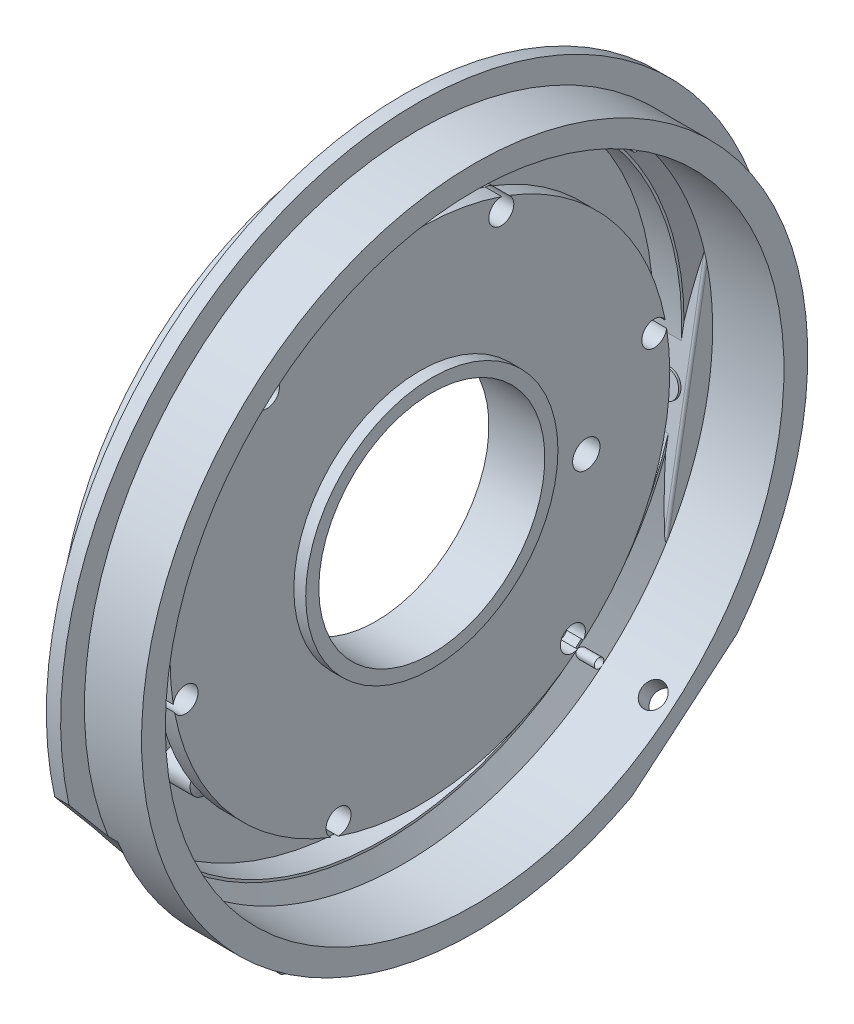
ISO-10303-21;
HEADER;
FILE_DESCRIPTION(('STEP AP214'),'2;1');
FILE_NAME('part.step','',(''),(''),'','','');
FILE_SCHEMA(('AUTOMOTIVE_DESIGN { 1 0 10303 214 1 1 1 1 }'));
ENDSEC;
DATA;
#1=APPLICATION_CONTEXT('core data for automotive mechanical design processes');
#2=APPLICATION_PROTOCOL_DEFINITION('international standard','automotive_design',2000,#1);
#3=PRODUCT_CONTEXT('',#1,'mechanical');
#4=PRODUCT('Part','Part','',(#3));
#5=PRODUCT_RELATED_PRODUCT_CATEGORY('part','',(#4));
#6=PRODUCT_DEFINITION_FORMATION('','',#4);
#7=PRODUCT_DEFINITION_CONTEXT('part definition',#1,'design');
#8=PRODUCT_DEFINITION('design','',#6,#7);
#9=PRODUCT_DEFINITION_SHAPE('','',#8);
#10=(LENGTH_UNIT() NAMED_UNIT(*) SI_UNIT(.MILLI.,.METRE.));
#11=(NAMED_UNIT(*) PLANE_ANGLE_UNIT() SI_UNIT($,.RADIAN.));
#12=(NAMED_UNIT(*) SI_UNIT($,.STERADIAN.) SOLID_ANGLE_UNIT());
#13=UNCERTAINTY_MEASURE_WITH_UNIT(LENGTH_MEASURE(1.E-05),#10,'distance_accuracy_value','');
#14=(GEOMETRIC_REPRESENTATION_CONTEXT(3) GLOBAL_UNCERTAINTY_ASSIGNED_CONTEXT((#13)) GLOBAL_UNIT_ASSIGNED_CONTEXT((#10,
#11,#12)) REPRESENTATION_CONTEXT('',''));
#15=CARTESIAN_POINT('',(0.,0.,0.));
#16=DIRECTION('',(0.,0.,1.));
#17=DIRECTION('',(1.,0.,0.));
#18=AXIS2_PLACEMENT_3D('',#15,#16,#17);
#19=CARTESIAN_POINT('',(12.,0.,0.));
#20=DIRECTION('',(1.,0.,0.));
#21=DIRECTION('',(0.,0.,-1.));
#22=AXIS2_PLACEMENT_3D('',#19,#20,#21);
#23=CONICAL_SURFACE('',#22,126.,1.0471975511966);
#24=CARTESIAN_POINT('',(12.,0.,0.));
#25=DIRECTION('',(-1.,0.,0.));
#26=DIRECTION('',(0.,0.,1.));
#27=AXIS2_PLACEMENT_3D('',#24,#25,#26);
#28=CIRCLE('',#27,126.);
#29=CARTESIAN_POINT('',(12.,-78.4224937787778,98.6200409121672));
#30=VERTEX_POINT('',#29);
#31=CARTESIAN_POINT('',(12.,96.5215998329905,80.9912388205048));
#32=VERTEX_POINT('',#31);
#33=EDGE_CURVE('E616',#30,#32,#28,.T.);
#34=ORIENTED_EDGE('',*,*,#33,.F.);
#35=CARTESIAN_POINT('',(11.8998,-78.1962789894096,98.57807614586));
#36=CARTESIAN_POINT('',(11.9596294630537,-78.3292888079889,98.6048373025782));
#37=CARTESIAN_POINT('',(12.0184156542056,-78.4635191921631,98.6282103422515));
#38=CARTESIAN_POINT('',(12.133486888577,-78.7344914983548,98.6671482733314));
#39=CARTESIAN_POINT('',(12.189766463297,-78.8712380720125,98.6826967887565));
#40=CARTESIAN_POINT('',(12.3000226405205,-79.148939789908,98.7050085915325));
#41=CARTESIAN_POINT('',(12.3539486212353,-79.289927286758,98.7116287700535));
#42=CARTESIAN_POINT('',(12.4577095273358,-79.5733775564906,98.7142222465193));
#43=CARTESIAN_POINT('',(12.5075477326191,-79.7158390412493,98.7102041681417));
#44=CARTESIAN_POINT('',(12.6233438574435,-80.065308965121,98.6854395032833));
#45=CARTESIAN_POINT('',(12.6866067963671,-80.2728319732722,98.6580448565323));
#46=CARTESIAN_POINT('',(12.7986863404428,-80.6846485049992,98.5725302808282));
#47=CARTESIAN_POINT('',(12.8475769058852,-80.8889532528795,98.5145721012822));
#48=CARTESIAN_POINT('',(12.9189532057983,-81.2485306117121,98.3785427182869));
#49=CARTESIAN_POINT('',(12.9447534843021,-81.4054879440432,98.3067450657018));
#50=CARTESIAN_POINT('',(12.9823257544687,-81.7084201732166,98.1397989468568));
#51=CARTESIAN_POINT('',(12.9941007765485,-81.8543974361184,98.0446555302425));
#52=CARTESIAN_POINT('',(13.0024523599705,-82.1305069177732,97.8323673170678));
#53=CARTESIAN_POINT('',(12.9989900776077,-82.2605977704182,97.7151670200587));
#54=CARTESIAN_POINT('',(12.9771487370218,-82.5006908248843,97.4629840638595));
#55=CARTESIAN_POINT('',(12.9587627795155,-82.6106837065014,97.3279932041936));
#56=CARTESIAN_POINT('',(12.9040371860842,-82.8279085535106,97.0186589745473));
#57=CARTESIAN_POINT('',(12.8649623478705,-82.9306947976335,96.8416986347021));
#58=CARTESIAN_POINT('',(12.7719915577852,-83.1074876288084,96.477585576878));
#59=CARTESIAN_POINT('',(12.7180636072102,-83.1814312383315,96.2904115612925));
#60=CARTESIAN_POINT('',(12.5685218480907,-83.3355731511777,95.8142223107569));
#61=CARTESIAN_POINT('',(12.4657177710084,-83.3995081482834,95.5222368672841));
#62=CARTESIAN_POINT('',(12.2995337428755,-83.4618100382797,95.0849481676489));
#63=CARTESIAN_POINT('',(12.2420935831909,-83.4769759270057,94.9391874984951));
#64=CARTESIAN_POINT('',(12.1238938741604,-83.497480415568,94.6483195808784));
#65=CARTESIAN_POINT('',(12.0631358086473,-83.5028233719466,94.5032120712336));
#66=CARTESIAN_POINT('',(11.9843446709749,-83.5041147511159,94.319833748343));
#67=CARTESIAN_POINT('',(11.9675468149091,-83.5040755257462,94.2810061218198));
#68=CARTESIAN_POINT('',(11.9337954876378,-83.5033916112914,94.2035065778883));
#69=CARTESIAN_POINT('',(11.9168423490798,-83.502748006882,94.1648345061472));
#70=CARTESIAN_POINT('',(11.8998,-83.5018123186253,94.1262050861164));
#71=B_SPLINE_CURVE_WITH_KNOTS('',3,(#35,#36,#37,#38,#39,#40,#41,#42,#43,#44,#45,#46,#47,#48,#49,
#50,#51,#52,#53,#54,#55,#56,#57,#58,#59,#60,#61,#62,#63,#64,#65,#66,#67,#68,#69,#70),
.UNSPECIFIED.,.F.,.F.,(4,2,2,2,2,2,2,2,2,2,2,2,2,2,2,2,2,4),(0.,0.444887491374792,
0.890702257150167,1.34358111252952,1.79609296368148,2.44995724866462,3.10039535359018,
3.62176021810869,4.14301241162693,4.66559417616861,5.18841767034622,5.80999408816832,
6.4329202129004,7.37551747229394,7.84754821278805,8.31936955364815,8.44628493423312,
8.57297297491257),.UNSPECIFIED.);
#72=CARTESIAN_POINT('',(12.7106979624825,-80.3639228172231,98.6375098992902));
#73=VERTEX_POINT('',#72);
#74=EDGE_CURVE('E747',#30,#73,#71,.T.);
#75=ORIENTED_EDGE('',*,*,#74,.T.);
#76=CARTESIAN_POINT('',(12.9226703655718,-83.5072838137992,96.4770010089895));
#77=CARTESIAN_POINT('',(13.006675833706,-83.624194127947,96.5682447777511));
#78=CARTESIAN_POINT('',(13.0922351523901,-83.7305301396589,96.672191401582));
#79=CARTESIAN_POINT('',(13.2631355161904,-83.9181522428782,96.9012880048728));
#80=CARTESIAN_POINT('',(13.3484752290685,-83.9993655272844,97.0264980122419));
#81=CARTESIAN_POINT('',(13.5049492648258,-84.1243430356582,97.2767493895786));
#82=CARTESIAN_POINT('',(13.5765138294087,-84.1715475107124,97.3998037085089));
#83=CARTESIAN_POINT('',(13.7144800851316,-84.2412082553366,97.6553695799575));
#84=CARTESIAN_POINT('',(13.7808883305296,-84.2636964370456,97.7878687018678));
#85=CARTESIAN_POINT('',(13.9020378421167,-84.2808475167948,98.0499526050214));
#86=CARTESIAN_POINT('',(13.9572471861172,-84.2771491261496,98.1792087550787));
#87=CARTESIAN_POINT('',(14.058237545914,-84.2438370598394,98.4381390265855));
#88=CARTESIAN_POINT('',(14.1040273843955,-84.2142477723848,98.5678126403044));
#89=CARTESIAN_POINT('',(14.1780632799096,-84.1340733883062,98.8047244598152));
#90=CARTESIAN_POINT('',(14.2078446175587,-84.0868697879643,98.9126247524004));
#91=CARTESIAN_POINT('',(14.2566186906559,-83.9728571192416,99.1201802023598));
#92=CARTESIAN_POINT('',(14.2756241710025,-83.9060713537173,99.2198449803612));
#93=CARTESIAN_POINT('',(14.2998814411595,-83.7649464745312,99.39395087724));
#94=CARTESIAN_POINT('',(14.3066343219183,-83.692816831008,99.4699824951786));
#95=CARTESIAN_POINT('',(14.3107808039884,-83.5374026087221,99.6099121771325));
#96=CARTESIAN_POINT('',(14.3081784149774,-83.4541228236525,99.6738154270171));
#97=CARTESIAN_POINT('',(14.2942109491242,-83.2845811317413,99.7840071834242));
#98=CARTESIAN_POINT('',(14.2833942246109,-83.1988170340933,99.8311368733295));
#99=CARTESIAN_POINT('',(14.2541597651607,-83.0224441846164,99.9120347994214));
#100=CARTESIAN_POINT('',(14.2357416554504,-82.9318351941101,99.9458023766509));
#101=CARTESIAN_POINT('',(14.1914340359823,-82.7455851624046,100.000467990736));
#102=CARTESIAN_POINT('',(14.1653419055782,-82.6498744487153,100.0209610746));
#103=CARTESIAN_POINT('',(14.1069174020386,-82.4583965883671,100.047776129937));
#104=CARTESIAN_POINT('',(14.0745829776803,-82.3626294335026,100.0540934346));
#105=CARTESIAN_POINT('',(14.0013048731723,-82.1638721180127,100.053202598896));
#106=CARTESIAN_POINT('',(13.9598296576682,-82.0610856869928,100.044618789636));
#107=CARTESIAN_POINT('',(13.8719195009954,-81.8601065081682,100.012445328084));
#108=CARTESIAN_POINT('',(13.8254822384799,-81.7619159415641,99.9888486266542));
#109=CARTESIAN_POINT('',(13.7225620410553,-81.5595022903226,99.9240281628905));
#110=CARTESIAN_POINT('',(13.6655574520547,-81.4561495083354,99.8809145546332));
#111=CARTESIAN_POINT('',(13.5482695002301,-81.2594434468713,99.7791557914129));
#112=CARTESIAN_POINT('',(13.4879844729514,-81.1660953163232,99.7205026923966));
#113=CARTESIAN_POINT('',(13.3581712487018,-80.9805182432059,99.5816283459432));
#114=CARTESIAN_POINT('',(13.2883997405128,-80.8897577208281,99.4996667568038));
#115=CARTESIAN_POINT('',(13.1482372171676,-80.7247538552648,99.3209364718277));
#116=CARTESIAN_POINT('',(13.0778459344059,-80.6505180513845,99.2241610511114));
#117=CARTESIAN_POINT('',(12.9338166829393,-80.5164147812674,99.0116789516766));
#118=CARTESIAN_POINT('',(12.8602515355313,-80.4577386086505,98.8951661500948));
#119=CARTESIAN_POINT('',(12.7166276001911,-80.3636183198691,98.6510135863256));
#120=CARTESIAN_POINT('',(12.6465693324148,-80.3281776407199,98.5233721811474));
#121=CARTESIAN_POINT('',(12.5145653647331,-80.2837578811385,98.2645024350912));
#122=CARTESIAN_POINT('',(12.4524369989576,-80.2740021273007,98.1335034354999));
#123=CARTESIAN_POINT('',(12.3366207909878,-80.2810155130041,97.8684480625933));
#124=CARTESIAN_POINT('',(12.2829254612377,-80.2977609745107,97.7343945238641));
#125=CARTESIAN_POINT('',(12.1928806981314,-80.3557077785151,97.4847106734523));
#126=CARTESIAN_POINT('',(12.1552179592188,-80.3937008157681,97.3688157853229));
#127=CARTESIAN_POINT('',(12.0910307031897,-80.4917372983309,97.1434495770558));
#128=CARTESIAN_POINT('',(12.0644905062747,-80.551749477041,97.0339694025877));
#129=CARTESIAN_POINT('',(12.0274106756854,-80.6820001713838,96.8420969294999));
#130=CARTESIAN_POINT('',(12.0150739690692,-80.7493749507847,96.7581006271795));
#131=CARTESIAN_POINT('',(12.0005383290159,-80.8972900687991,96.6016294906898));
#132=CARTESIAN_POINT('',(11.9983328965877,-80.9778219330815,96.529147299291));
#133=CARTESIAN_POINT('',(12.0039174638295,-81.141500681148,96.4042344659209));
#134=CARTESIAN_POINT('',(12.0108220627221,-81.223753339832,96.3505836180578));
#135=CARTESIAN_POINT('',(12.0327531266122,-81.3943629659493,96.2562518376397));
#136=CARTESIAN_POINT('',(12.0477793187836,-81.4827197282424,96.2155704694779));
#137=CARTESIAN_POINT('',(12.0853942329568,-81.6636935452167,96.147511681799));
#138=CARTESIAN_POINT('',(12.1080436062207,-81.7563394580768,96.12024541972));
#139=CARTESIAN_POINT('',(12.1599165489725,-81.9427779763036,96.0794713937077));
#140=CARTESIAN_POINT('',(12.1891414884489,-82.0365708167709,96.0659665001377));
#141=CARTESIAN_POINT('',(12.255971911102,-82.2314872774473,96.0516091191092));
#142=CARTESIAN_POINT('',(12.2940907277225,-82.3325234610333,96.0519847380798));
#143=CARTESIAN_POINT('',(12.375605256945,-82.5313165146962,96.0674397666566));
#144=CARTESIAN_POINT('',(12.4190054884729,-82.6290704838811,96.0825318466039));
#145=CARTESIAN_POINT('',(12.5158756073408,-82.8321113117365,96.1291410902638));
#146=CARTESIAN_POINT('',(12.5699181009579,-82.9366842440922,96.1625668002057));
#147=CARTESIAN_POINT('',(12.6815968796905,-83.1372370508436,96.2449851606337));
#148=CARTESIAN_POINT('',(12.7392285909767,-83.2332274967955,96.2939583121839));
#149=CARTESIAN_POINT('',(12.8184963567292,-83.3559181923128,96.3693701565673));
#150=CARTESIAN_POINT('',(12.8391751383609,-83.3870939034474,96.3897597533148));
#151=CARTESIAN_POINT('',(12.8807603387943,-83.448161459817,96.4321684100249));
#152=CARTESIAN_POINT('',(12.9016667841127,-83.4780531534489,96.4541876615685));
#153=CARTESIAN_POINT('',(12.9226703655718,-83.5072838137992,96.4770010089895));
#154=B_SPLINE_CURVE_WITH_KNOTS('',3,(#76,#77,#78,#79,#80,#81,#82,#83,#84,#85,#86,#87,#88,#89,
#90,#91,#92,#93,#94,#95,#96,#97,#98,#99,#100,#101,#102,#103,#104,#105,#106,#107,#108,#109,#110,
#111,#112,#113,#114,#115,#116,#117,#118,#119,#120,#121,#122,#123,#124,#125,#126,#127,#128,#129,
#130,#131,#132,#133,#134,#135,#136,#137,#138,#139,#140,#141,#142,#143,#144,#145,#146,#147,#148,
#149,#150,#151,#152,#153),.UNSPECIFIED.,.T.,.F.,(4,2,2,2,2,2,2,2,2,2,2,2,2,2,2,2,2,2,2,2,2,2,2,
2,2,2,2,2,2,2,2,2,2,2,2,2,2,2,4),(0.,0.511122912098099,1.02371350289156,1.47138429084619,
1.91847639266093,2.33784899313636,2.75682698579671,3.11913027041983,3.48100415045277,
3.79441371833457,4.10768897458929,4.40171145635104,4.69574843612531,4.99837864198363,
5.30110846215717,5.63329051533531,5.96562865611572,6.34108728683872,6.71673823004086,
7.13730578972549,7.55806483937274,8.0051798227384,8.45236092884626,8.88585583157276,
9.31896363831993,9.69960504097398,10.0797080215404,10.4030718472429,10.7262282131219,
11.0201767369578,11.3141153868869,11.6104502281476,11.9068468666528,12.2295257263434,
12.5524826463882,12.9181581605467,13.2833768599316,13.411156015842,13.5389502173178),.UNSPECIFIED.);
#155=CARTESIAN_POINT('',(12.7106979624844,-83.1839357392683,96.2712380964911));
#156=VERTEX_POINT('',#155);
#157=EDGE_CURVE('E734',#156,#73,#154,.T.);
#158=ORIENTED_EDGE('',*,*,#157,.F.);
#159=CARTESIAN_POINT('',(12.,-83.5038577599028,94.3562702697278));
#160=VERTEX_POINT('',#159);
#161=EDGE_CURVE('E301',#156,#160,#71,.T.);
#162=ORIENTED_EDGE('',*,*,#161,.T.);
#163=CARTESIAN_POINT('',(12.,-96.5215998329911,-80.9912388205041));
#164=VERTEX_POINT('',#163);
#165=EDGE_CURVE('E615',#164,#160,#28,.T.);
#166=ORIENTED_EDGE('',*,*,#165,.F.);
#167=CARTESIAN_POINT('',(14.3028517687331,-99.4391659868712,-83.7191915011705));
#168=CARTESIAN_POINT('',(14.3089142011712,-99.5109609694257,-83.6502190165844));
#169=CARTESIAN_POINT('',(14.3107798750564,-99.577837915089,-83.5756246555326));
#170=CARTESIAN_POINT('',(14.3059916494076,-99.6996176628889,-83.417389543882));
#171=CARTESIAN_POINT('',(14.2993275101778,-99.754505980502,-83.333738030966));
#172=CARTESIAN_POINT('',(14.2778244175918,-99.8507552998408,-83.1602015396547));
#173=CARTESIAN_POINT('',(14.2630024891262,-99.8921441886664,-83.0703298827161));
#174=CARTESIAN_POINT('',(14.2258773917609,-99.960886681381,-82.88689371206));
#175=CARTESIAN_POINT('',(14.2035745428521,-99.9882408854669,-82.793329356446));
#176=CARTESIAN_POINT('',(14.151575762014,-100.029574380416,-82.602014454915));
#177=CARTESIAN_POINT('',(14.1216681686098,-100.043102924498,-82.5042251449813));
#178=CARTESIAN_POINT('',(14.0559342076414,-100.055793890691,-82.3097355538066));
#179=CARTESIAN_POINT('',(14.0201058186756,-100.054951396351,-82.2130356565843));
#180=CARTESIAN_POINT('',(13.9394002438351,-100.038938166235,-82.0122169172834));
#181=CARTESIAN_POINT('',(13.8939613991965,-100.022203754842,-81.9084498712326));
#182=CARTESIAN_POINT('',(13.7984885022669,-99.9735410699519,-81.7067757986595));
#183=CARTESIAN_POINT('',(13.7484521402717,-99.9416051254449,-81.6088717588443));
#184=CARTESIAN_POINT('',(13.6382080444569,-99.8588966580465,-81.4081983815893));
#185=CARTESIAN_POINT('',(13.5775277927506,-99.8062001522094,-81.3064806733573));
#186=CARTESIAN_POINT('',(13.4534432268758,-99.6852868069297,-81.1145896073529));
#187=CARTESIAN_POINT('',(13.390037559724,-99.6170621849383,-81.0244220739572));
#188=CARTESIAN_POINT('',(13.2549087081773,-99.4587807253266,-80.8480937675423));
#189=CARTESIAN_POINT('',(13.1830354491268,-99.3671507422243,-80.7634547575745));
#190=CARTESIAN_POINT('',(13.0395645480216,-99.1696522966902,-80.6124553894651));
#191=CARTESIAN_POINT('',(12.9679670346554,-99.063777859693,-80.5461027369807));
#192=CARTESIAN_POINT('',(12.8240283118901,-98.8356832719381,-80.4314293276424));
#193=CARTESIAN_POINT('',(12.7517798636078,-98.7129666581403,-80.3839725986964));
#194=CARTESIAN_POINT('',(12.6120388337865,-98.458029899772,-80.3136582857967));
#195=CARTESIAN_POINT('',(12.5445460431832,-98.3258101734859,-80.2907996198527));
#196=CARTESIAN_POINT('',(12.4206663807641,-98.063403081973,-80.2727625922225));
#197=CARTESIAN_POINT('',(12.3638693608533,-97.9335160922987,-80.2761067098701));
#198=CARTESIAN_POINT('',(12.2597530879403,-97.6732098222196,-80.3089765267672));
#199=CARTESIAN_POINT('',(12.212422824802,-97.5427913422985,-80.3384715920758));
#200=CARTESIAN_POINT('',(12.1358163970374,-97.3045058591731,-80.418772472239));
#201=CARTESIAN_POINT('',(12.1049588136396,-97.1959877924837,-80.4661260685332));
#202=CARTESIAN_POINT('',(12.0544061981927,-96.9871821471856,-80.5807334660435));
#203=CARTESIAN_POINT('',(12.0346969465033,-96.8868842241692,-80.6479617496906));
#204=CARTESIAN_POINT('',(12.009723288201,-96.7124618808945,-80.7895685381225));
#205=CARTESIAN_POINT('',(12.0028065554,-96.6366428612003,-80.8615803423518));
#206=CARTESIAN_POINT('',(11.9985900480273,-96.4970855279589,-81.016713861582));
#207=CARTESIAN_POINT('',(12.0012859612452,-96.4333418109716,-81.0998305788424));
#208=CARTESIAN_POINT('',(12.0156309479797,-96.3237028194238,-81.268547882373));
#209=CARTESIAN_POINT('',(12.0266734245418,-96.2769032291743,-81.3536167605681));
#210=CARTESIAN_POINT('',(12.0564420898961,-96.1964714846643,-81.5284778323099));
#211=CARTESIAN_POINT('',(12.075168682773,-96.1628400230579,-81.6182702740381));
#212=CARTESIAN_POINT('',(12.1201832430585,-96.108165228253,-81.8029896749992));
#213=CARTESIAN_POINT('',(12.146690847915,-96.0875518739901,-81.8979892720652));
#214=CARTESIAN_POINT('',(12.2059479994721,-96.0603039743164,-82.0880220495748));
#215=CARTESIAN_POINT('',(12.2386997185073,-96.0536743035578,-82.183055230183));
#216=CARTESIAN_POINT('',(12.3130220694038,-96.0537046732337,-82.3809010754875));
#217=CARTESIAN_POINT('',(12.3551546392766,-96.0618113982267,-82.4835007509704));
#218=CARTESIAN_POINT('',(12.4443237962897,-96.0929790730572,-82.684176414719));
#219=CARTESIAN_POINT('',(12.4913627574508,-96.1160472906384,-82.7822501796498));
#220=CARTESIAN_POINT('',(12.595732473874,-96.1798826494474,-82.9850699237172));
#221=CARTESIAN_POINT('',(12.6535944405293,-96.2226229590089,-83.0889219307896));
#222=CARTESIAN_POINT('',(12.7724546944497,-96.3238080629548,-83.2866997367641));
#223=CARTESIAN_POINT('',(12.8334546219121,-96.3822611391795,-83.3806202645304));
#224=CARTESIAN_POINT('',(12.964647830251,-96.5210014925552,-83.5675477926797));
#225=CARTESIAN_POINT('',(13.0350631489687,-96.6030710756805,-83.6590808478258));
#226=CARTESIAN_POINT('',(13.1762456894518,-96.7823599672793,-83.8255893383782));
#227=CARTESIAN_POINT('',(13.2470130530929,-96.8795859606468,-83.9005574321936));
#228=CARTESIAN_POINT('',(13.3911453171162,-97.0928206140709,-84.0356655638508));
#229=CARTESIAN_POINT('',(13.4644259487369,-97.2095873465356,-84.0947065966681));
#230=CARTESIAN_POINT('',(13.6071593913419,-97.4544768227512,-84.1894505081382));
#231=CARTESIAN_POINT('',(13.6766120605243,-97.5825999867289,-84.2251525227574));
#232=CARTESIAN_POINT('',(13.8066696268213,-97.8416175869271,-84.2697087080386));
#233=CARTESIAN_POINT('',(13.8675096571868,-97.9722244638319,-84.2795262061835));
#234=CARTESIAN_POINT('',(13.9807166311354,-98.2364826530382,-84.2728182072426));
#235=CARTESIAN_POINT('',(14.0330883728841,-98.370132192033,-84.25630768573));
#236=CARTESIAN_POINT('',(14.1208068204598,-98.6190854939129,-84.1989404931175));
#237=CARTESIAN_POINT('',(14.1574479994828,-98.7346483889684,-84.1612794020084));
#238=CARTESIAN_POINT('',(14.2042475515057,-98.9029422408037,-84.0885847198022));
#239=CARTESIAN_POINT('',(14.2184790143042,-98.958156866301,-84.0616802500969));
#240=CARTESIAN_POINT('',(14.2440335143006,-99.0663683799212,-84.0025808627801));
#241=CARTESIAN_POINT('',(14.2553583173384,-99.1193665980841,-83.9703891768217));
#242=CARTESIAN_POINT('',(14.2741174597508,-99.2183701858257,-83.9037090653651));
#243=CARTESIAN_POINT('',(14.2817914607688,-99.2645951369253,-83.8696136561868));
#244=CARTESIAN_POINT('',(14.2943990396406,-99.3541545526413,-83.7973742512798));
#245=CARTESIAN_POINT('',(14.2993325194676,-99.3974889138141,-83.7592301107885));
#246=CARTESIAN_POINT('',(14.3028517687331,-99.4391659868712,-83.7191915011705));
#247=B_SPLINE_CURVE_WITH_KNOTS('',3,(#167,#168,#169,#170,#171,#172,#173,#174,#175,#176,#177,
#178,#179,#180,#181,#182,#183,#184,#185,#186,#187,#188,#189,#190,#191,#192,#193,#194,#195,#196,
#197,#198,#199,#200,#201,#202,#203,#204,#205,#206,#207,#208,#209,#210,#211,#212,#213,#214,#215,
#216,#217,#218,#219,#220,#221,#222,#223,#224,#225,#226,#227,#228,#229,#230,#231,#232,#233,#234,
#235,#236,#237,#238,#239,#240,#241,#242,#243,#244,#245,#246),.UNSPECIFIED.,.T.,.F.,(4,2,2,2,2,2,
2,2,2,2,2,2,2,2,2,2,2,2,2,2,2,2,2,2,2,2,2,2,2,2,2,2,2,2,2,2,2,2,2,4),(0.,0.299011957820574,
0.598383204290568,0.897132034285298,1.1958680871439,1.50405971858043,1.81235678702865,
2.15451777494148,2.49685160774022,2.88417667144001,3.27169628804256,3.7016801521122,
4.1318449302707,4.57988764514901,5.02791065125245,5.45086027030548,5.87331508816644,
6.23819488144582,6.60260821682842,6.91533350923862,7.22791853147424,7.51974049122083,
7.811577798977,8.11260961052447,8.4137463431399,8.74605444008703,9.07852408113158,
9.45599987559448,9.83367502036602,10.2568618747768,10.680235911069,11.127927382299,
11.5756354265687,12.0064295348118,12.4369786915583,12.8153104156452,13.004178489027,
13.1929315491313,13.3665021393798,13.5400789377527),.UNSPECIFIED.);
#248=EDGE_CURVE('E693',#164,#164,#247,.T.);
#249=ORIENTED_EDGE('',*,*,#248,.F.);
#250=CARTESIAN_POINT('',(12.,-43.5533448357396,-118.233270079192));
#251=VERTEX_POINT('',#250);
#252=EDGE_CURVE('E612',#251,#164,#28,.T.);
#253=ORIENTED_EDGE('',*,*,#252,.F.);
#254=CARTESIAN_POINT('',(49.0758648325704,-163.585948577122,-97.0682834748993));
#255=CARTESIAN_POINT('',(48.1114961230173,-161.416647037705,-97.4507898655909));
#256=CARTESIAN_POINT('',(47.1549431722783,-159.243960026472,-97.8338932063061));
#257=CARTESIAN_POINT('',(45.2591139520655,-154.891242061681,-98.6013948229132));
#258=CARTESIAN_POINT('',(44.3198380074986,-152.711210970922,-98.9857931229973));
#259=CARTESIAN_POINT('',(42.4600222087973,-148.342791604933,-99.7560633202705));
#260=CARTESIAN_POINT('',(41.5394868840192,-146.154401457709,-100.141935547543));
#261=CARTESIAN_POINT('',(39.7192979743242,-141.769220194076,-100.915161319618));
#262=CARTESIAN_POINT('',(38.8196442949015,-139.572429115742,-101.302514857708));
#263=CARTESIAN_POINT('',(37.0386377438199,-135.15820397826,-102.080861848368));
#264=CARTESIAN_POINT('',(36.1574067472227,-132.940722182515,-102.471863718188));
#265=CARTESIAN_POINT('',(34.4205926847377,-128.496041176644,-103.255580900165));
#266=CARTESIAN_POINT('',(33.5650094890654,-126.268842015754,-103.648296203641));
#267=CARTESIAN_POINT('',(31.8822045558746,-121.804189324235,-104.435534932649));
#268=CARTESIAN_POINT('',(31.0549814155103,-119.566736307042,-104.830058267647));
#269=CARTESIAN_POINT('',(29.4318243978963,-115.080836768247,-105.621043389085));
#270=CARTESIAN_POINT('',(28.6358905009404,-112.83239025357,-106.017505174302));
#271=CARTESIAN_POINT('',(27.0868701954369,-108.347845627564,-106.808251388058));
#272=CARTESIAN_POINT('',(26.3334184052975,-106.111870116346,-107.202514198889));
#273=CARTESIAN_POINT('',(24.8638572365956,-101.628033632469,-107.993135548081));
#274=CARTESIAN_POINT('',(24.1477478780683,-99.3801726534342,-108.389494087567));
#275=CARTESIAN_POINT('',(22.7566329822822,-94.8719520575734,-109.184415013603));
#276=CARTESIAN_POINT('',(22.0816299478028,-92.6115916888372,-109.582977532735));
#277=CARTESIAN_POINT('',(20.7769130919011,-88.0782943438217,-110.382320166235));
#278=CARTESIAN_POINT('',(20.1471991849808,-85.8053573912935,-110.783100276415));
#279=CARTESIAN_POINT('',(18.3346344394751,-78.9752794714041,-111.987427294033));
#280=CARTESIAN_POINT('',(17.2257644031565,-74.3985615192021,-112.794426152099));
#281=CARTESIAN_POINT('',(15.73859499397,-67.4972699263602,-114.011310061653));
#282=CARTESIAN_POINT('',(15.272235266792,-65.1908495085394,-114.417994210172));
#283=CARTESIAN_POINT('',(14.4027955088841,-60.5664205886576,-115.233405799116));
#284=CARTESIAN_POINT('',(13.9997138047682,-58.2484123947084,-115.642133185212));
#285=CARTESIAN_POINT('',(13.352030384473,-54.1731721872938,-116.360707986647));
#286=CARTESIAN_POINT('',(13.0928295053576,-52.4181787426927,-116.670160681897));
#287=CARTESIAN_POINT('',(12.6146720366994,-48.9028910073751,-117.290000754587));
#288=CARTESIAN_POINT('',(12.3957147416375,-47.1425968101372,-117.600388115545));
#289=CARTESIAN_POINT('',(11.9996139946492,-43.6174847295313,-118.221960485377));
#290=CARTESIAN_POINT('',(11.8224695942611,-41.852666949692,-118.533145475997));
#291=CARTESIAN_POINT('',(11.5113181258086,-38.3193328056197,-119.156167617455));
#292=CARTESIAN_POINT('',(11.3773111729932,-36.5508164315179,-119.468004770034));
#293=CARTESIAN_POINT('',(11.1534937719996,-33.011235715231,-120.09212835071));
#294=CARTESIAN_POINT('',(11.0636791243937,-31.2401716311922,-120.40441473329));
#295=CARTESIAN_POINT('',(10.9289496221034,-27.6963854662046,-121.029279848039));
#296=CARTESIAN_POINT('',(10.8840347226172,-25.923663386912,-121.341858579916));
#297=CARTESIAN_POINT('',(10.8394719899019,-22.3776547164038,-121.967115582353));
#298=CARTESIAN_POINT('',(10.8398244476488,-20.6043681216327,-122.279793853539));
#299=CARTESIAN_POINT('',(10.8857942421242,-17.0583649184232,-122.905049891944));
#300=CARTESIAN_POINT('',(10.9314115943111,-15.2856483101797,-123.217627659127));
#301=CARTESIAN_POINT('',(11.0675924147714,-11.7404755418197,-123.842737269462));
#302=CARTESIAN_POINT('',(11.1581917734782,-9.96802072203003,-124.155268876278));
#303=CARTESIAN_POINT('',(11.3836244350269,-6.42584785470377,-124.779849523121));
#304=CARTESIAN_POINT('',(11.5184577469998,-4.65612980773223,-125.091898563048));
#305=CARTESIAN_POINT('',(11.8313036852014,-1.12040588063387,-125.715342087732));
#306=CARTESIAN_POINT('',(12.0093163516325,0.64559999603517,-126.026736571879));
#307=CARTESIAN_POINT('',(12.4071815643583,4.17302398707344,-126.648716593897));
#308=CARTESIAN_POINT('',(12.6270341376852,5.93444209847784,-126.959302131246));
#309=CARTESIAN_POINT('',(13.1070827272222,9.45248973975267,-127.579628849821));
#310=CARTESIAN_POINT('',(13.3672912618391,11.2091176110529,-127.889369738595));
#311=CARTESIAN_POINT('',(13.9262435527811,14.7164350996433,-128.507804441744));
#312=CARTESIAN_POINT('',(14.2249884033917,16.4671245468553,-128.81649822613));
#313=CARTESIAN_POINT('',(15.17620680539,21.7094214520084,-129.740856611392));
#314=CARTESIAN_POINT('',(15.8836904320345,25.1914468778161,-130.354831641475));
#315=CARTESIAN_POINT('',(17.5399731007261,32.6231983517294,-131.665249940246));
#316=CARTESIAN_POINT('',(18.5088163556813,36.5685549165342,-132.360922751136));
#317=CARTESIAN_POINT('',(20.5936604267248,44.4212687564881,-133.745568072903));
#318=CARTESIAN_POINT('',(21.7096673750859,48.328624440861,-134.434540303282));
#319=CARTESIAN_POINT('',(24.0675288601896,56.1084120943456,-135.806326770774));
#320=CARTESIAN_POINT('',(25.3094510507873,59.9808240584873,-136.489137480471));
#321=CARTESIAN_POINT('',(27.8992403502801,67.6908847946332,-137.848629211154));
#322=CARTESIAN_POINT('',(29.247105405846,71.5285342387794,-138.525310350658));
#323=CARTESIAN_POINT('',(32.0329312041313,79.1741082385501,-139.873431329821));
#324=CARTESIAN_POINT('',(33.4709384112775,82.9820163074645,-140.544868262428));
#325=CARTESIAN_POINT('',(36.422480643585,90.5694040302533,-141.882729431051));
#326=CARTESIAN_POINT('',(37.9360180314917,94.3488827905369,-142.549153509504));
#327=CARTESIAN_POINT('',(40.2524230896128,99.9945747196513,-143.544641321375));
#328=CARTESIAN_POINT('',(41.0313088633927,101.870383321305,-143.875396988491));
#329=CARTESIAN_POINT('',(42.6037544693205,105.616037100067,-144.53585681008));
#330=CARTESIAN_POINT('',(43.3973143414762,107.485882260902,-144.865560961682));
#331=CARTESIAN_POINT('',(44.997843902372,111.219708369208,-145.52393524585));
#332=CARTESIAN_POINT('',(45.8048118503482,113.083690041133,-145.852605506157));
#333=CARTESIAN_POINT('',(47.4312295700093,116.806341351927,-146.509009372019));
#334=CARTESIAN_POINT('',(48.2506792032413,118.665011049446,-146.836742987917));
#335=CARTESIAN_POINT('',(49.0758648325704,120.521200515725,-147.164039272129));
#336=B_SPLINE_CURVE_WITH_KNOTS('',3,(#254,#255,#256,#257,#258,#259,#260,#261,#262,#263,#264,
#265,#266,#267,#268,#269,#270,#271,#272,#273,#274,#275,#276,#277,#278,#279,#280,#281,#282,#283,
#284,#285,#286,#287,#288,#289,#290,#291,#292,#293,#294,#295,#296,#297,#298,#299,#300,#301,#302,
#303,#304,#305,#306,#307,#308,#309,#310,#311,#312,#313,#314,#315,#316,#317,#318,#319,#320,#321,
#322,#323,#324,#325,#326,#327,#328,#329,#330,#331,#332,#333,#334,#335),.UNSPECIFIED.,.F.,.F.,(4,
2,2,2,2,2,2,2,2,2,2,2,2,2,2,2,2,2,2,2,2,2,2,2,2,2,2,2,2,2,2,2,2,2,2,2,2,2,2,2,4),(0.,
7.21386026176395,14.4278560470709,21.6435751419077,28.8592615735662,36.113089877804,
43.3668814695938,50.6203137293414,57.8737414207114,65.0501068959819,72.2264762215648,
79.4032820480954,86.5800743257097,100.90719151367,108.070467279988,115.233553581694,
120.635597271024,126.037546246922,131.439372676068,136.841213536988,142.242540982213,
147.643863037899,153.04521981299,158.446578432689,163.852253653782,169.257929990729,
174.663611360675,180.069296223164,185.476661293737,190.884179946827,201.698635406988,
214.06051436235,226.422908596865,238.791980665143,251.160813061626,263.53607434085,
275.911722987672,282.085206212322,288.25870627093,294.431410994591,300.604047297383),.UNSPECIFIED.);
#337=CARTESIAN_POINT('',(16.,-68.6994965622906,-113.799325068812));
#338=VERTEX_POINT('',#337);
#339=EDGE_CURVE('E421',#338,#251,#336,.T.);
#340=ORIENTED_EDGE('',*,*,#339,.F.);
#341=CARTESIAN_POINT('',(16.,-68.6994965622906,-113.799325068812));
#342=CARTESIAN_POINT('',(16.0168279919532,-68.7791560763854,-113.785281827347));
#343=CARTESIAN_POINT('',(16.0339079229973,-68.8588372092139,-113.771660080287));
#344=CARTESIAN_POINT('',(16.0686201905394,-69.0182431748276,-113.745360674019));
#345=CARTESIAN_POINT('',(16.0862525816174,-69.0979680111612,-113.73268310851));
#346=CARTESIAN_POINT('',(16.1401546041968,-69.3376672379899,-113.696148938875));
#347=CARTESIAN_POINT('',(16.1773278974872,-69.497684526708,-113.673877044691));
#348=CARTESIAN_POINT('',(16.2554303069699,-69.8209806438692,-113.634394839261));
#349=CARTESIAN_POINT('',(16.2964206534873,-69.9842592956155,-113.617297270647));
#350=CARTESIAN_POINT('',(16.3610465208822,-70.2287442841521,-113.597889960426));
#351=CARTESIAN_POINT('',(16.3830982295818,-70.3101202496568,-113.592462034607));
#352=CARTESIAN_POINT('',(16.4285037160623,-70.4726370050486,-113.584270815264));
#353=CARTESIAN_POINT('',(16.4518571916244,-70.5537778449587,-113.581506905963));
#354=CARTESIAN_POINT('',(16.4923821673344,-70.6892880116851,-113.5798919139));
#355=CARTESIAN_POINT('',(16.509094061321,-70.7437816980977,-113.580060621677));
#356=CARTESIAN_POINT('',(16.5434228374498,-70.852265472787,-113.582504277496));
#357=CARTESIAN_POINT('',(16.5610368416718,-70.9062565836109,-113.584772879));
#358=CARTESIAN_POINT('',(16.5942888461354,-71.0041960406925,-113.591497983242));
#359=CARTESIAN_POINT('',(16.6097292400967,-71.0482399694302,-113.59549930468));
#360=CARTESIAN_POINT('',(16.6417732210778,-71.1358406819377,-113.606152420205));
#361=CARTESIAN_POINT('',(16.6583822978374,-71.1793938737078,-113.612817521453));
#362=CARTESIAN_POINT('',(16.6933482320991,-71.265839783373,-113.630107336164));
#363=CARTESIAN_POINT('',(16.7117261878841,-71.3087148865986,-113.64078583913));
#364=CARTESIAN_POINT('',(16.7408924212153,-71.3704935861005,-113.661649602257));
#365=CARTESIAN_POINT('',(16.7508463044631,-71.3906031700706,-113.669379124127));
#366=CARTESIAN_POINT('',(16.7714071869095,-71.4294614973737,-113.687025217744));
#367=CARTESIAN_POINT('',(16.7820121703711,-71.4482140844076,-113.696935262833));
#368=CARTESIAN_POINT('',(16.8003351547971,-71.4775502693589,-113.715981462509));
#369=CARTESIAN_POINT('',(16.8078502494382,-71.4887867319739,-113.724292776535));
#370=CARTESIAN_POINT('',(16.8231754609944,-71.5096207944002,-113.742548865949));
#371=CARTESIAN_POINT('',(16.8309848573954,-71.5192221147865,-113.75248982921));
#372=CARTESIAN_POINT('',(16.8445933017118,-71.5336933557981,-113.771233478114));
#373=CARTESIAN_POINT('',(16.8503606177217,-71.5391397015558,-113.779608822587));
#374=CARTESIAN_POINT('',(16.8618305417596,-71.5483640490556,-113.797276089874));
#375=CARTESIAN_POINT('',(16.8675332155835,-71.5521439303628,-113.806566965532));
#376=CARTESIAN_POINT('',(16.8787200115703,-71.5577653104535,-113.825920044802));
#377=CARTESIAN_POINT('',(16.8842027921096,-71.5595962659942,-113.83598613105));
#378=CARTESIAN_POINT('',(16.8947297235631,-71.5612149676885,-113.85650467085));
#379=CARTESIAN_POINT('',(16.8997735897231,-71.5610013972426,-113.86695736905));
#380=CARTESIAN_POINT('',(16.9101196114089,-71.5585192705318,-113.889681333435));
#381=CARTESIAN_POINT('',(16.9153198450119,-71.5559074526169,-113.901959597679));
#382=CARTESIAN_POINT('',(16.9249487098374,-71.5486552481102,-113.926209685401));
#383=CARTESIAN_POINT('',(16.9293758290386,-71.5440109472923,-113.938180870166));
#384=CARTESIAN_POINT('',(16.9402265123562,-71.5296590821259,-113.969381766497));
#385=CARTESIAN_POINT('',(16.9460460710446,-71.5186309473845,-113.988202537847));
#386=CARTESIAN_POINT('',(16.956270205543,-71.4940506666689,-114.024523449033));
#387=CARTESIAN_POINT('',(16.960669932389,-71.4804901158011,-114.04201891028));
#388=CARTESIAN_POINT('',(16.970206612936,-71.4451891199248,-114.083630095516));
#389=CARTESIAN_POINT('',(16.974757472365,-71.4225478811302,-114.107105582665));
#390=CARTESIAN_POINT('',(16.9823821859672,-71.3752800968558,-114.152253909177));
#391=CARTESIAN_POINT('',(16.9854526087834,-71.3506490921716,-114.173922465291));
#392=CARTESIAN_POINT('',(16.9931140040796,-71.2746946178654,-114.23700871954));
#393=CARTESIAN_POINT('',(16.9961204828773,-71.2214793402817,-114.276329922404));
#394=CARTESIAN_POINT('',(16.9986392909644,-71.144320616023,-114.329504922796));
#395=CARTESIAN_POINT('',(16.9991668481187,-71.1213698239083,-114.344859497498));
#396=CARTESIAN_POINT('',(16.999846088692,-71.0752977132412,-114.374888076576));
#397=CARTESIAN_POINT('',(17.0000009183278,-71.0521794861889,-114.389566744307));
#398=CARTESIAN_POINT('',(17.,-71.0289072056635,-114.404013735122));
#399=B_SPLINE_CURVE_WITH_KNOTS('',3,(#341,#342,#343,#344,#345,#346,#347,#348,#349,#350,#351,
#352,#353,#354,#355,#356,#357,#358,#359,#360,#361,#362,#363,#364,#365,#366,#367,#368,#369,#370,
#371,#372,#373,#374,#375,#376,#377,#378,#379,#380,#381,#382,#383,#384,#385,#386,#387,#388,#389,
#390,#391,#392,#393,#394,#395,#396,#397,#398),.UNSPECIFIED.,.F.,.F.,(4,2,2,2,2,2,2,2,2,2,2,2,2,
2,2,2,2,2,2,2,2,2,2,2,2,2,2,2,4),(0.,0.247858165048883,0.495740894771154,0.993005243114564,
1.50043191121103,1.75385273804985,2.00721497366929,2.17817714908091,2.34862430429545,
2.48908197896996,2.63025027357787,2.77338225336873,2.84448977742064,2.91538729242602,
2.96287608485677,3.01025533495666,3.04473101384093,3.07916770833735,3.11378976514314,
3.14843411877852,3.18896951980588,3.22958333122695,3.29693039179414,3.36450507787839,
3.4630461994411,3.56181463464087,3.76008794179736,3.84294453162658,3.92509923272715),.UNSPECIFIED.);
#400=CARTESIAN_POINT('',(17.,-71.0289072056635,-114.404013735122));
#401=VERTEX_POINT('',#400);
#402=EDGE_CURVE('E11',#338,#401,#399,.T.);
#403=ORIENTED_EDGE('',*,*,#402,.T.);
#404=CARTESIAN_POINT('',(17.,0.,0.));
#405=DIRECTION('',(1.,0.,0.));
#406=DIRECTION('',(0.,0.,-1.));
#407=AXIS2_PLACEMENT_3D('',#404,#405,#406);
#408=CIRCLE('',#407,134.660254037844);
#409=CARTESIAN_POINT('',(17.,27.6168627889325,-131.79792451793));
#410=VERTEX_POINT('',#409);
#411=EDGE_CURVE('E422',#410,#401,#408,.F.);
#412=ORIENTED_EDGE('',*,*,#411,.F.);
#413=CARTESIAN_POINT('',(17.,27.6168627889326,-131.79792451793));
#414=CARTESIAN_POINT('',(16.9999802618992,27.6573393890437,-131.789408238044));
#415=CARTESIAN_POINT('',(16.9996421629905,27.6977274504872,-131.780327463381));
#416=CARTESIAN_POINT('',(16.9980396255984,27.7783983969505,-131.760509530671));
#417=CARTESIAN_POINT('',(16.9967681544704,27.818678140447,-131.749760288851));
#418=CARTESIAN_POINT('',(16.9929596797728,27.8994533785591,-131.725936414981));
#419=CARTESIAN_POINT('',(16.9903956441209,27.9399343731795,-131.712816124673));
#420=CARTESIAN_POINT('',(16.9834397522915,28.0195621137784,-131.683581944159));
#421=CARTESIAN_POINT('',(16.979054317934,28.058713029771,-131.66747868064));
#422=CARTESIAN_POINT('',(16.9705259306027,28.1139699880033,-131.640581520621));
#423=CARTESIAN_POINT('',(16.9675257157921,28.131125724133,-131.631602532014));
#424=CARTESIAN_POINT('',(16.9607148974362,28.1645912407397,-131.612382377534));
#425=CARTESIAN_POINT('',(16.956903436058,28.1809001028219,-131.602139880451));
#426=CARTESIAN_POINT('',(16.9481714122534,28.212360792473,-131.579931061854));
#427=CARTESIAN_POINT('',(16.9432363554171,28.2274936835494,-131.567943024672));
#428=CARTESIAN_POINT('',(16.9319595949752,28.2553437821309,-131.541987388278));
#429=CARTESIAN_POINT('',(16.9256250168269,28.2680726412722,-131.52802994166));
#430=CARTESIAN_POINT('',(16.9143482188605,28.2849676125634,-131.504418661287));
#431=CARTESIAN_POINT('',(16.9099622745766,28.2904715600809,-131.495464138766));
#432=CARTESIAN_POINT('',(16.9006576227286,28.2997979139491,-131.476972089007));
#433=CARTESIAN_POINT('',(16.8957395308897,28.3036222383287,-131.467435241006));
#434=CARTESIAN_POINT('',(16.8854396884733,28.309321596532,-131.447959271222));
#435=CARTESIAN_POINT('',(16.8800556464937,28.3111863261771,-131.43801830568));
#436=CARTESIAN_POINT('',(16.8690226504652,28.3128604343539,-131.418109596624));
#437=CARTESIAN_POINT('',(16.8633735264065,28.3126684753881,-131.408141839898));
#438=CARTESIAN_POINT('',(16.8509855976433,28.3102036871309,-131.386723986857));
#439=CARTESIAN_POINT('',(16.8442320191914,28.3075661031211,-131.375326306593));
#440=CARTESIAN_POINT('',(16.8308293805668,28.3002049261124,-131.353165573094));
#441=CARTESIAN_POINT('',(16.824180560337,28.2954771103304,-131.34240385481));
#442=CARTESIAN_POINT('',(16.8068400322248,28.2808873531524,-131.314823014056));
#443=CARTESIAN_POINT('',(16.7963286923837,28.2696855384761,-131.298611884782));
#444=CARTESIAN_POINT('',(16.7759508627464,28.2447005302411,-131.267885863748));
#445=CARTESIAN_POINT('',(16.7660863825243,28.2309097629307,-131.253376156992));
#446=CARTESIAN_POINT('',(16.7426413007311,28.1951468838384,-131.219529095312));
#447=CARTESIAN_POINT('',(16.7293735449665,28.1722756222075,-131.200937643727));
#448=CARTESIAN_POINT('',(16.7037479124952,28.1245213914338,-131.165789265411));
#449=CARTESIAN_POINT('',(16.6913921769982,28.0996339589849,-131.149237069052));
#450=CARTESIAN_POINT('',(16.667336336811,28.0484227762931,-131.117590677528));
#451=CARTESIAN_POINT('',(16.6556404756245,28.0220914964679,-131.102505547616));
#452=CARTESIAN_POINT('',(16.6328508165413,27.9685581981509,-131.073575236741));
#453=CARTESIAN_POINT('',(16.6217563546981,27.9413571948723,-131.059728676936));
#454=CARTESIAN_POINT('',(16.5890220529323,27.858355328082,-131.019439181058));
#455=CARTESIAN_POINT('',(16.5681095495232,27.8015512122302,-130.994477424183));
#456=CARTESIAN_POINT('',(16.5276602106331,27.6863349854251,-130.947269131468));
#457=CARTESIAN_POINT('',(16.5081243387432,27.6279217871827,-130.925024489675));
#458=CARTESIAN_POINT('',(16.4700829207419,27.5098834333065,-130.882548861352));
#459=CARTESIAN_POINT('',(16.4515797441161,27.4502558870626,-130.862322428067));
#460=CARTESIAN_POINT('',(16.4154422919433,27.3302074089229,-130.82350437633));
#461=CARTESIAN_POINT('',(16.3978081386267,27.2697863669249,-130.804912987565));
#462=CARTESIAN_POINT('',(16.3459690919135,27.087558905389,-130.751113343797));
#463=CARTESIAN_POINT('',(16.3128485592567,26.9648547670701,-130.717902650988));
#464=CARTESIAN_POINT('',(16.2488231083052,26.718080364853,-130.655376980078));
#465=CARTESIAN_POINT('',(16.2179155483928,26.5940119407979,-130.62605732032));
#466=CARTESIAN_POINT('',(16.171218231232,26.4001938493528,-130.582813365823));
#467=CARTESIAN_POINT('',(16.1548173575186,26.3308221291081,-130.567840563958));
#468=CARTESIAN_POINT('',(16.1225072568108,26.1917695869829,-130.538727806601));
#469=CARTESIAN_POINT('',(16.1065981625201,26.1220886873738,-130.52458807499));
#470=CARTESIAN_POINT('',(16.0753327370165,25.9829108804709,-130.49714874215));
#471=CARTESIAN_POINT('',(16.0599735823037,25.9134155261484,-130.483844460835));
#472=CARTESIAN_POINT('',(16.029678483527,25.7742278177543,-130.457922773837));
#473=CARTESIAN_POINT('',(16.0147424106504,25.7045355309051,-130.445305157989));
#474=CARTESIAN_POINT('',(16.000000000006,25.6347485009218,-130.43299767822));
#475=B_SPLINE_CURVE_WITH_KNOTS('',3,(#413,#414,#415,#416,#417,#418,#419,#420,#421,#422,#423,
#424,#425,#426,#427,#428,#429,#430,#431,#432,#433,#434,#435,#436,#437,#438,#439,#440,#441,#442,
#443,#444,#445,#446,#447,#448,#449,#450,#451,#452,#453,#454,#455,#456,#457,#458,#459,#460,#461,
#462,#463,#464,#465,#466,#467,#468,#469,#470,#471,#472,#473,#474),.UNSPECIFIED.,.F.,.F.,(4,2,2,
2,2,2,2,2,2,2,2,2,2,2,2,2,2,2,2,2,2,2,2,2,2,2,2,2,2,2,4),(0.,0.124130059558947,
0.249205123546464,0.377011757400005,0.504371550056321,0.563102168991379,0.621895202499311,
0.681494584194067,0.74079724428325,0.77483924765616,0.808842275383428,0.843023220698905,
0.877226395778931,0.91752524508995,0.957905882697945,1.02452619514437,1.09134452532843,
1.18806910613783,1.28501399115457,1.3825242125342,1.47992449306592,1.67619503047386,
1.87260161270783,2.06944173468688,2.26630946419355,2.660265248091,3.05374264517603,
3.27225494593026,3.49082570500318,3.70803645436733,3.92518034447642),.UNSPECIFIED.);
#476=CARTESIAN_POINT('',(16.0000000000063,25.6347485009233,-130.432997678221));
#477=VERTEX_POINT('',#476);
#478=EDGE_CURVE('E30',#410,#477,#475,.T.);
#479=ORIENTED_EDGE('',*,*,#478,.T.);
#480=CARTESIAN_POINT('',(12.,0.488596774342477,-125.999052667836));
#481=VERTEX_POINT('',#480);
#482=EDGE_CURVE('E291',#481,#477,#336,.T.);
#483=ORIENTED_EDGE('',*,*,#482,.F.);
#484=CARTESIAN_POINT('',(12.,80.9912388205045,-96.5215998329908));
#485=VERTEX_POINT('',#484);
#486=EDGE_CURVE('E620',#485,#481,#28,.T.);
#487=ORIENTED_EDGE('',*,*,#486,.F.);
#488=CARTESIAN_POINT('',(13.0742119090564,80.6497246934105,-99.2166935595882));
#489=CARTESIAN_POINT('',(12.9890005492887,80.563738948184,-99.0963889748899));
#490=CARTESIAN_POINT('',(12.9040717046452,80.4908039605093,-98.9661084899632));
#491=CARTESIAN_POINT('',(12.7382169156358,80.3748512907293,-98.6900932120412));
#492=CARTESIAN_POINT('',(12.6573005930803,80.331902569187,-98.5443236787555));
#493=CARTESIAN_POINT('',(12.51498838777,80.283804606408,-98.265410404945));
#494=CARTESIAN_POINT('',(12.4524844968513,80.2739547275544,-98.1336489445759));
#495=CARTESIAN_POINT('',(12.3360719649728,80.2810933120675,-97.8671551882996));
#496=CARTESIAN_POINT('',(12.2821474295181,80.2980314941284,-97.7324289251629));
#497=CARTESIAN_POINT('',(12.1920146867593,80.3564707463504,-97.4821379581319));
#498=CARTESIAN_POINT('',(12.1544321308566,80.3946205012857,-97.3662914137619));
#499=CARTESIAN_POINT('',(12.0904119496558,80.492967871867,-97.1410382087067));
#500=CARTESIAN_POINT('',(12.0639602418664,80.5531374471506,-97.0316235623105));
#501=CARTESIAN_POINT('',(12.0270634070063,80.6836340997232,-96.8399527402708));
#502=CARTESIAN_POINT('',(12.0148148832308,80.7510922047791,-96.7560829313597));
#503=CARTESIAN_POINT('',(12.0004487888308,80.8991405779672,-96.5998774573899));
#504=CARTESIAN_POINT('',(11.9983246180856,80.9797222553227,-96.5275343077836));
#505=CARTESIAN_POINT('',(12.0040536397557,81.1434918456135,-96.4028667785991));
#506=CARTESIAN_POINT('',(12.0110255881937,81.2257916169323,-96.3493263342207));
#507=CARTESIAN_POINT('',(12.0330840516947,81.3964712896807,-96.2552195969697));
#508=CARTESIAN_POINT('',(12.0481701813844,81.4848509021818,-96.2146526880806));
#509=CARTESIAN_POINT('',(12.0859027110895,81.6658809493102,-96.146809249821));
#510=CARTESIAN_POINT('',(12.1086122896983,81.7585613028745,-96.119648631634));
#511=CARTESIAN_POINT('',(12.1606017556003,81.9450582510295,-96.0790863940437));
#512=CARTESIAN_POINT('',(12.1898835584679,82.0388751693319,-96.0656887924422));
#513=CARTESIAN_POINT('',(12.2568408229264,82.233865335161,-96.0515543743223));
#514=CARTESIAN_POINT('',(12.2950316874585,82.3349492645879,-96.0520519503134));
#515=CARTESIAN_POINT('',(12.3766684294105,82.533774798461,-96.0677554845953));
#516=CARTESIAN_POINT('',(12.4201167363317,82.631514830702,-96.082968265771));
#517=CARTESIAN_POINT('',(12.5170573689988,82.8344548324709,-96.1298235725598));
#518=CARTESIAN_POINT('',(12.5711190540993,82.9389441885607,-96.1633645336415));
#519=CARTESIAN_POINT('',(12.6828892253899,83.139452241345,-96.2460294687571));
#520=CARTESIAN_POINT('',(12.7405996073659,83.2354664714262,-96.2951615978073));
#521=CARTESIAN_POINT('',(12.8659045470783,83.4291614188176,-96.41458905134));
#522=CARTESIAN_POINT('',(12.9338146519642,83.5254632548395,-96.4867953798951));
#523=CARTESIAN_POINT('',(13.0708039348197,83.7032519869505,-96.6467110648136));
#524=CARTESIAN_POINT('',(13.1398836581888,83.7847317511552,-96.7344278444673));
#525=CARTESIAN_POINT('',(13.2828712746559,83.9366316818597,-96.9305047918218));
#526=CARTESIAN_POINT('',(13.3567405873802,84.005714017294,-97.0399353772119));
#527=CARTESIAN_POINT('',(13.5018104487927,84.1220797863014,-97.2715190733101));
#528=CARTESIAN_POINT('',(13.5730103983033,84.1693583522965,-97.3936750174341));
#529=CARTESIAN_POINT('',(13.7095359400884,84.2391038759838,-97.6458744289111));
#530=CARTESIAN_POINT('',(13.7749255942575,84.2618838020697,-97.7757954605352));
#531=CARTESIAN_POINT('',(13.8982790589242,84.2811815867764,-98.0410824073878));
#532=CARTESIAN_POINT('',(13.9562476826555,84.2777165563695,-98.1764447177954));
#533=CARTESIAN_POINT('',(14.0562860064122,84.2442627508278,-98.4333201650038));
#534=CARTESIAN_POINT('',(14.0993863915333,84.2171001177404,-98.5547935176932));
#535=CARTESIAN_POINT('',(14.1750067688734,84.1392054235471,-98.7934079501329));
#536=CARTESIAN_POINT('',(14.2075409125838,84.0885051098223,-98.9105546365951));
#537=CARTESIAN_POINT('',(14.2561179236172,83.9731873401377,-99.11875547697));
#538=CARTESIAN_POINT('',(14.2738700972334,83.9116623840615,-99.2111276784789));
#539=CARTESIAN_POINT('',(14.2991120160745,83.7733003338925,-99.3851739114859));
#540=CARTESIAN_POINT('',(14.3066099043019,83.6964754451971,-99.4668563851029));
#541=CARTESIAN_POINT('',(14.3106759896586,83.5388172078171,-99.6084845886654));
#542=CARTESIAN_POINT('',(14.3083049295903,83.4592426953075,-99.6698100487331));
#543=CARTESIAN_POINT('',(14.295113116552,83.2923173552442,-99.7795869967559));
#544=CARTESIAN_POINT('',(14.2842937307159,83.2049677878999,-99.8280405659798));
#545=CARTESIAN_POINT('',(14.2549649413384,83.0266237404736,-99.9103754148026));
#546=CARTESIAN_POINT('',(14.2365804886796,82.9357092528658,-99.9444760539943));
#547=CARTESIAN_POINT('',(14.1929144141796,82.7514729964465,-99.9989221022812));
#548=CARTESIAN_POINT('',(14.1676312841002,82.6581507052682,-100.019264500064));
#549=CARTESIAN_POINT('',(14.1092053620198,82.4651559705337,-100.047343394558));
#550=CARTESIAN_POINT('',(14.0756513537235,82.3654744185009,-100.054150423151));
#551=CARTESIAN_POINT('',(14.0029148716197,82.1682924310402,-100.053177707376));
#552=CARTESIAN_POINT('',(13.9637305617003,82.0707927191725,-100.045393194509));
#553=CARTESIAN_POINT('',(13.8759576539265,81.8685758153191,-100.014554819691));
#554=CARTESIAN_POINT('',(13.8268049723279,81.7643626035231,-99.9898092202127));
#555=CARTESIAN_POINT('',(13.7242565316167,81.5629947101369,-99.9249636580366));
#556=CARTESIAN_POINT('',(13.6708568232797,81.4658467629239,-99.8848492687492));
#557=CARTESIAN_POINT('',(13.5538930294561,81.268089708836,-99.7846777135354));
#558=CARTESIAN_POINT('',(13.4899152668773,81.1687027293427,-99.7226928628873));
#559=CARTESIAN_POINT('',(13.3599107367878,80.9831619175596,-99.5833612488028));
#560=CARTESIAN_POINT('',(13.2938871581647,80.896988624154,-99.5060374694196));
#561=CARTESIAN_POINT('',(13.2020850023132,80.7879178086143,-99.3897860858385));
#562=CARTESIAN_POINT('',(13.1765132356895,80.7586836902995,-99.3564708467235));
#563=CARTESIAN_POINT('',(13.125356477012,80.7024826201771,-99.2879679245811));
#564=CARTESIAN_POINT('',(13.0997714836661,80.6755165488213,-99.2527795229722));
#565=CARTESIAN_POINT('',(13.0742119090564,80.6497246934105,-99.2166935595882));
#566=B_SPLINE_CURVE_WITH_KNOTS('',3,(#488,#489,#490,#491,#492,#493,#494,#495,#496,#497,#498,
#499,#500,#501,#502,#503,#504,#505,#506,#507,#508,#509,#510,#511,#512,#513,#514,#515,#516,#517,
#518,#519,#520,#521,#522,#523,#524,#525,#526,#527,#528,#529,#530,#531,#532,#533,#534,#535,#536,
#537,#538,#539,#540,#541,#542,#543,#544,#545,#546,#547,#548,#549,#550,#551,#552,#553,#554,#555,
#556,#557,#558,#559,#560,#561,#562,#563,#564,#565),.UNSPECIFIED.,.T.,.F.,(4,2,2,2,2,2,2,2,2,2,2,
2,2,2,2,2,2,2,2,2,2,2,2,2,2,2,2,2,2,2,2,2,2,2,2,2,2,2,4),(0.,0.511754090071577,1.02468123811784,
1.46072979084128,1.89596084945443,2.27654183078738,2.65663985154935,2.97983735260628,
3.30282413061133,3.59672570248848,3.89061331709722,4.18699922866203,4.48347163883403,
4.80635886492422,5.12939587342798,5.49493791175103,5.86067146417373,6.27352263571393,
6.68657193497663,7.13148109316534,7.57648952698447,8.01574289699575,8.45470991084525,
8.84753792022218,9.23983761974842,9.57513686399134,9.91016968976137,10.2101748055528,
10.5101313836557,10.8053207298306,11.1005746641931,11.4154864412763,11.730501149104,
12.0826488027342,12.4351278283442,12.8339157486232,13.2321105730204,13.3855544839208,
13.5390576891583),.UNSPECIFIED.);
#567=EDGE_CURVE('E713',#485,#485,#566,.T.);
#568=ORIENTED_EDGE('',*,*,#567,.F.);
#569=EDGE_CURVE('E796',#32,#485,#28,.T.);
#570=ORIENTED_EDGE('',*,*,#569,.F.);
#571=CARTESIAN_POINT('',(12.0058543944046,96.6575153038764,80.8447852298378));
#572=CARTESIAN_POINT('',(12.0000610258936,96.5865761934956,80.9139573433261));
#573=CARTESIAN_POINT('',(11.9985588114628,96.5205522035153,80.9886626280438));
#574=CARTESIAN_POINT('',(12.0042543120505,96.4004466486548,81.1469101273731));
#575=CARTESIAN_POINT('',(12.0114625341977,96.3463796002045,81.2304629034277));
#576=CARTESIAN_POINT('',(12.0341786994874,96.2517068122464,81.403561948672));
#577=CARTESIAN_POINT('',(12.0496677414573,96.211070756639,81.4930941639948));
#578=CARTESIAN_POINT('',(12.0881824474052,96.1436968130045,81.6756443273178));
#579=CARTESIAN_POINT('',(12.1112079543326,96.1169586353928,81.7686622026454));
#580=CARTESIAN_POINT('',(12.1647434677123,96.0766231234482,81.9590030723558));
#581=CARTESIAN_POINT('',(12.1954861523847,96.0635157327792,82.0563631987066));
#582=CARTESIAN_POINT('',(12.2628452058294,96.0515181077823,82.249893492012));
#583=CARTESIAN_POINT('',(12.2994636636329,96.052632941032,82.3460632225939));
#584=CARTESIAN_POINT('',(12.3820331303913,96.0691109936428,82.5464592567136));
#585=CARTESIAN_POINT('',(12.4285751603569,96.0861331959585,82.6503042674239));
#586=CARTESIAN_POINT('',(12.526143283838,96.1353937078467,82.8520944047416));
#587=CARTESIAN_POINT('',(12.5771717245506,96.1676400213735,82.9500363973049));
#588=CARTESIAN_POINT('',(12.6896090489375,96.2512397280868,83.1512273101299));
#589=CARTESIAN_POINT('',(12.751485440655,96.3045964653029,83.2533839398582));
#590=CARTESIAN_POINT('',(12.8777313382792,96.4270589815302,83.4460542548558));
#591=CARTESIAN_POINT('',(12.9421020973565,96.4961727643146,83.5365619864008));
#592=CARTESIAN_POINT('',(13.0788505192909,96.6564568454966,83.7132879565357));
#593=CARTESIAN_POINT('',(13.1513441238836,96.749200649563,83.7979954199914));
#594=CARTESIAN_POINT('',(13.2956679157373,96.9492106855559,83.9488884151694));
#595=CARTESIAN_POINT('',(13.3674978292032,97.0564826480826,84.0150666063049));
#596=CARTESIAN_POINT('',(13.5108708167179,97.2867123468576,84.1285026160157));
#597=CARTESIAN_POINT('',(13.5823260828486,97.4100710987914,84.1750634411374));
#598=CARTESIAN_POINT('',(13.7200763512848,97.6662773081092,84.2434034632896));
#599=CARTESIAN_POINT('',(13.7863721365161,97.7991233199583,84.2651864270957));
#600=CARTESIAN_POINT('',(13.9070619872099,98.0614433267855,84.2808294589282));
#601=CARTESIAN_POINT('',(13.9619474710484,98.1905839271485,84.2763966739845));
#602=CARTESIAN_POINT('',(14.0622293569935,98.4491081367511,84.2416533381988));
#603=CARTESIAN_POINT('',(14.1076367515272,98.5784912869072,84.2113729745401));
#604=CARTESIAN_POINT('',(14.1809089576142,98.8146530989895,84.1300156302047));
#605=CARTESIAN_POINT('',(14.2103186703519,98.9221154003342,84.0823212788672));
#606=CARTESIAN_POINT('',(14.2583573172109,99.1287066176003,83.9674508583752));
#607=CARTESIAN_POINT('',(14.2769986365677,99.2278449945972,83.9002973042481));
#608=CARTESIAN_POINT('',(14.300613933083,99.4009733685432,83.7585818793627));
#609=CARTESIAN_POINT('',(14.3070785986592,99.4765540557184,83.6862009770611));
#610=CARTESIAN_POINT('',(14.310676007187,99.6155533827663,83.530392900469));
#611=CARTESIAN_POINT('',(14.3078126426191,99.6789770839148,83.4469703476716));
#612=CARTESIAN_POINT('',(14.2933689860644,99.78831675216,83.2771414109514));
#613=CARTESIAN_POINT('',(14.2823232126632,99.8350561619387,83.1912160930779));
#614=CARTESIAN_POINT('',(14.252652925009,99.9151613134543,83.0145973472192));
#615=CARTESIAN_POINT('',(14.2340280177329,99.9485263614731,82.9239036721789));
#616=CARTESIAN_POINT('',(14.1893024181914,100.00241312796,82.7374425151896));
#617=CARTESIAN_POINT('',(14.1629915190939,100.022513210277,82.641604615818));
#618=CARTESIAN_POINT('',(14.1041474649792,100.048530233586,82.4499377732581));
#619=CARTESIAN_POINT('',(14.0716122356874,100.054442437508,82.3541088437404));
#620=CARTESIAN_POINT('',(13.9979086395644,100.052700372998,82.1552142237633));
#621=CARTESIAN_POINT('',(13.9562066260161,100.043659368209,82.0523600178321));
#622=CARTESIAN_POINT('',(13.8678631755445,100.010560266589,81.8513167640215));
#623=CARTESIAN_POINT('',(13.8212194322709,99.9864951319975,81.753129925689));
#624=CARTESIAN_POINT('',(13.7178748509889,99.9206679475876,81.5507796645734));
#625=CARTESIAN_POINT('',(13.6606547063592,99.8770129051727,81.447497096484));
#626=CARTESIAN_POINT('',(13.5429653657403,99.7741694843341,81.2510173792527));
#627=CARTESIAN_POINT('',(13.4824945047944,99.7149730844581,81.1578254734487));
#628=CARTESIAN_POINT('',(13.3523529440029,99.5749844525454,80.9727152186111));
#629=CARTESIAN_POINT('',(13.2824442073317,99.4924599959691,80.882269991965));
#630=CARTESIAN_POINT('',(13.1420563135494,99.3126318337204,80.7179977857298));
#631=CARTESIAN_POINT('',(13.0715769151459,99.215321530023,80.644178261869));
#632=CARTESIAN_POINT('',(12.9275032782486,99.001891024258,80.5111191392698));
#633=CARTESIAN_POINT('',(12.8539841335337,98.8849819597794,80.4530557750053));
#634=CARTESIAN_POINT('',(12.7105253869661,98.6401278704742,80.3602468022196));
#635=CARTESIAN_POINT('',(12.6405861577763,98.5121817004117,80.325503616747));
#636=CARTESIAN_POINT('',(12.509005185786,98.2530245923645,80.2825851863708));
#637=CARTESIAN_POINT('',(12.4471686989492,98.1220516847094,80.2735899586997));
#638=CARTESIAN_POINT('',(12.3319828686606,97.8571757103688,80.2820914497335));
#639=CARTESIAN_POINT('',(12.2786287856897,97.7232743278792,80.2995733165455));
#640=CARTESIAN_POINT('',(12.1892791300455,97.4739629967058,80.3589386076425));
#641=CARTESIAN_POINT('',(12.151962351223,97.3582823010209,80.3976006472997));
#642=CARTESIAN_POINT('',(12.1044102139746,97.1899152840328,80.4719127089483));
#643=CARTESIAN_POINT('',(12.0899718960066,97.1346959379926,80.4993734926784));
#644=CARTESIAN_POINT('',(12.0641102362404,97.0265195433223,80.5596224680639));
#645=CARTESIAN_POINT('',(12.0526849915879,96.9735610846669,80.592407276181));
#646=CARTESIAN_POINT('',(12.0339597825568,96.8752536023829,80.659868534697));
#647=CARTESIAN_POINT('',(12.0263782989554,96.8296514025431,80.6940985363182));
#648=CARTESIAN_POINT('',(12.0140029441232,96.7413217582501,80.7665288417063));
#649=CARTESIAN_POINT('',(12.0092091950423,96.6985944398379,80.8047293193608));
#650=CARTESIAN_POINT('',(12.0058543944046,96.6575153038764,80.8447852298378));
#651=B_SPLINE_CURVE_WITH_KNOTS('',3,(#571,#572,#573,#574,#575,#576,#577,#578,#579,#580,#581,
#582,#583,#584,#585,#586,#587,#588,#589,#590,#591,#592,#593,#594,#595,#596,#597,#598,#599,#600,
#601,#602,#603,#604,#605,#606,#607,#608,#609,#610,#611,#612,#613,#614,#615,#616,#617,#618,#619,
#620,#621,#622,#623,#624,#625,#626,#627,#628,#629,#630,#631,#632,#633,#634,#635,#636,#637,#638,
#639,#640,#641,#642,#643,#644,#645,#646,#647,#648,#649,#650),.UNSPECIFIED.,.T.,.F.,(4,2,2,2,2,2,
2,2,2,2,2,2,2,2,2,2,2,2,2,2,2,2,2,2,2,2,2,2,2,2,2,2,2,2,2,2,2,2,2,4),(0.,0.297538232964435,
0.595435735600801,0.892656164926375,1.18987040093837,1.49743286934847,1.8051049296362,
2.14893262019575,2.49294127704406,2.88377536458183,3.2748084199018,3.70793882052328,
4.14124056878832,4.58885156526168,5.0363945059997,5.45512896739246,5.87337506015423,
6.23482291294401,6.59585421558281,6.90875725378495,7.2215297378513,7.51549462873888,
7.80947476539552,8.11239909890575,8.41542455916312,8.74815559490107,9.08104260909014,
9.4571785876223,9.83350908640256,10.2546530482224,10.6759854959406,11.1232363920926,
11.5705337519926,12.0034186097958,12.4360607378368,12.8161591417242,13.0058915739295,
13.1955038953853,13.3677935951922,13.5400908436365),.UNSPECIFIED.);
#652=EDGE_CURVE('E721',#32,#32,#651,.T.);
#653=ORIENTED_EDGE('',*,*,#652,.F.);
#654=EDGE_LOOP('',(#34,#75,#158,#162,#166,#249,#253,#340,#403,#412,#479,#483,#487,#568,#570,#653));
#655=FACE_BOUND('',#654,.T.);
#656=CARTESIAN_POINT('',(20.,0.,0.));
#657=DIRECTION('',(-1.,0.,0.));
#658=DIRECTION('',(0.,0.,1.));
#659=AXIS2_PLACEMENT_3D('',#656,#657,#658);
#660=CIRCLE('',#659,139.856406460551);
#661=CARTESIAN_POINT('',(20.,-52.3570989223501,129.686347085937));
#662=VERTEX_POINT('',#661);
#663=CARTESIAN_POINT('',(20.,-118.62440525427,74.081474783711));
#664=VERTEX_POINT('',#663);
#665=EDGE_CURVE('E617',#662,#664,#660,.T.);
#666=ORIENTED_EDGE('',*,*,#665,.T.);
#667=CARTESIAN_POINT('',(20.0002,-118.625263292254,74.080754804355));
#668=CARTESIAN_POINT('',(19.7193652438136,-117.420498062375,75.0916728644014));
#669=CARTESIAN_POINT('',(19.4519739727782,-116.213878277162,76.1041470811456));
#670=CARTESIAN_POINT('',(18.9451694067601,-113.797160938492,78.132013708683));
#671=CARTESIAN_POINT('',(18.7057569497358,-112.587063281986,79.1474062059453));
#672=CARTESIAN_POINT('',(18.2559749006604,-110.163461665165,81.1810494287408));
#673=CARTESIAN_POINT('',(18.0456108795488,-108.949957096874,82.1993006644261));
#674=CARTESIAN_POINT('',(17.654982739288,-106.520115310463,84.2381800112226));
#675=CARTESIAN_POINT('',(17.4747183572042,-105.303778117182,85.2588081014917));
#676=CARTESIAN_POINT('',(17.1451570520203,-102.86840514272,87.3023286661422));
#677=CARTESIAN_POINT('',(16.9958660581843,-101.649368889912,88.3252215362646));
#678=CARTESIAN_POINT('',(16.729070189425,-99.2092565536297,90.3727188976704));
#679=CARTESIAN_POINT('',(16.6115652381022,-97.9881804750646,91.3973233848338));
#680=CARTESIAN_POINT('',(16.4089782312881,-95.5445398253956,93.4477813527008));
#681=CARTESIAN_POINT('',(16.3238937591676,-94.3219753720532,94.4736347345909));
#682=CARTESIAN_POINT('',(16.1866024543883,-91.875763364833,96.5262503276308));
#683=CARTESIAN_POINT('',(16.1343955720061,-90.652115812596,97.5530125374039));
#684=CARTESIAN_POINT('',(16.0636344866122,-88.2208907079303,99.5930526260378));
#685=CARTESIAN_POINT('',(16.044632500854,-87.013320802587,100.606324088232));
#686=CARTESIAN_POINT('',(16.039005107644,-84.5981118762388,102.632925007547));
#687=CARTESIAN_POINT('',(16.0523803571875,-83.3904728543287,103.646254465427));
#688=CARTESIAN_POINT('',(16.1114364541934,-80.9756244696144,105.67255285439));
#689=CARTESIAN_POINT('',(16.1571182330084,-79.768415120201,106.685521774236));
#690=CARTESIAN_POINT('',(16.2805411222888,-77.3549352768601,108.710671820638));
#691=CARTESIAN_POINT('',(16.3582828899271,-76.1486648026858,109.722852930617));
#692=CARTESIAN_POINT('',(16.5453551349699,-73.7382614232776,111.745421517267));
#693=CARTESIAN_POINT('',(16.6546674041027,-72.5341276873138,112.755809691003));
#694=CARTESIAN_POINT('',(16.9043292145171,-70.1277191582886,114.775026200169));
#695=CARTESIAN_POINT('',(17.044679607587,-68.9254444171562,115.783854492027));
#696=CARTESIAN_POINT('',(17.3556815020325,-66.5233603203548,117.79944237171));
#697=CARTESIAN_POINT('',(17.5263290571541,-65.323550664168,118.8062022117));
#698=CARTESIAN_POINT('',(17.8971023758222,-62.9266099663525,120.81747426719));
#699=CARTESIAN_POINT('',(18.0972280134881,-61.7294789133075,121.821986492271));
#700=CARTESIAN_POINT('',(18.4340773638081,-59.8509399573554,123.398267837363));
#701=CARTESIAN_POINT('',(18.5611897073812,-59.1685110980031,123.97089364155));
#702=CARTESIAN_POINT('',(18.8245228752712,-57.8047519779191,125.115223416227));
#703=CARTESIAN_POINT('',(18.9607428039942,-57.1234216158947,125.686927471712));
#704=CARTESIAN_POINT('',(19.2423890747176,-55.7604817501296,126.830569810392));
#705=CARTESIAN_POINT('',(19.3878332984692,-55.0788744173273,127.402506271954));
#706=CARTESIAN_POINT('',(19.6874920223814,-53.7167294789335,128.545481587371));
#707=CARTESIAN_POINT('',(19.8417073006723,-53.0361919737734,129.116520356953));
#708=CARTESIAN_POINT('',(20.0002,-52.3562408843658,129.687067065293));
#709=B_SPLINE_CURVE_WITH_KNOTS('',3,(#667,#668,#669,#670,#671,#672,#673,#674,#675,#676,#677,
#678,#679,#680,#681,#682,#683,#684,#685,#686,#687,#688,#689,#690,#691,#692,#693,#694,#695,#696,
#697,#698,#699,#700,#701,#702,#703,#704,#705,#706,#707,#708),.UNSPECIFIED.,.F.,.F.,(4,2,2,2,2,2,
2,2,2,2,2,2,2,2,2,2,2,2,2,2,4),(0.,4.79273093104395,9.58560536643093,14.3793977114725,
19.1731481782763,23.9678154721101,28.7624712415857,33.5567695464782,38.3510606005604,
43.0801846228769,47.8094046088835,52.5387609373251,57.2682142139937,61.9949452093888,
66.7218059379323,71.4480514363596,76.1742767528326,78.8738474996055,81.5731531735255,
84.2778617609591,86.982810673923),.UNSPECIFIED.);
#710=EDGE_CURVE('E309',#664,#662,#709,.T.);
#711=ORIENTED_EDGE('',*,*,#710,.T.);
#712=EDGE_LOOP('',(#666,#711));
#713=FACE_BOUND('',#712,.T.);
#714=ADVANCED_FACE('F17',(#655,#713),#23,.T.);
#715=CARTESIAN_POINT('',(20.,-139.856406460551,0.));
#716=DIRECTION('',(-1.,0.,0.));
#717=DIRECTION('',(0.,0.,1.));
#718=AXIS2_PLACEMENT_3D('',#715,#716,#717);
#719=PLANE('',#718);
#720=CARTESIAN_POINT('',(20.,0.,0.));
#721=DIRECTION('',(-1.,0.,0.));
#722=DIRECTION('',(0.,0.,1.));
#723=AXIS2_PLACEMENT_3D('',#720,#721,#722);
#724=CIRCLE('',#723,150.);
#725=CARTESIAN_POINT('',(20.,-118.056749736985,-92.5343387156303));
#726=VERTEX_POINT('',#725);
#727=CARTESIAN_POINT('',(20.,-138.624646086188,57.2992800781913));
#728=VERTEX_POINT('',#727);
#729=EDGE_CURVE('E621',#726,#728,#724,.T.);
#730=ORIENTED_EDGE('',*,*,#729,.T.);
#731=DIRECTION('',(0.,0.766044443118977,0.642787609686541));
#732=VECTOR('',#731,1.);
#733=CARTESIAN_POINT('',(20.,-167.561860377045,33.0180742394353));
#734=LINE('',#733,#732);
#735=EDGE_CURVE('E318',#728,#664,#734,.T.);
#736=ORIENTED_EDGE('',*,*,#735,.T.);
#737=ORIENTED_EDGE('',*,*,#665,.F.);
#738=CARTESIAN_POINT('',(20.,-32.3568580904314,146.468541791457));
#739=VERTEX_POINT('',#738);
#740=EDGE_CURVE('E317',#662,#739,#734,.T.);
#741=ORIENTED_EDGE('',*,*,#740,.T.);
#742=CARTESIAN_POINT('',(20.,-111.628873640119,-100.19478314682));
#743=VERTEX_POINT('',#742);
#744=EDGE_CURVE('E624',#739,#743,#724,.T.);
#745=ORIENTED_EDGE('',*,*,#744,.T.);
#746=DIRECTION('',(0.,0.766044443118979,0.642787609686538));
#747=VECTOR('',#746,1.);
#748=CARTESIAN_POINT('',(20.,-78.8571702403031,-72.6960589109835));
#749=LINE('',#748,#747);
#750=CARTESIAN_POINT('',(20.,-107.0964617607,-96.3916380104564));
#751=VERTEX_POINT('',#750);
#752=EDGE_CURVE('E670',#743,#751,#749,.T.);
#753=ORIENTED_EDGE('',*,*,#752,.T.);
#754=DIRECTION('',(0.,-0.642787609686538,0.766044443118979));
#755=VECTOR('',#754,1.);
#756=CARTESIAN_POINT('',(20.,-168.095697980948,-23.6955790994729));
#757=LINE('',#756,#755);
#758=CARTESIAN_POINT('',(20.,-113.524337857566,-88.7311935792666));
#759=VERTEX_POINT('',#758);
#760=EDGE_CURVE('E673',#751,#759,#757,.T.);
#761=ORIENTED_EDGE('',*,*,#760,.T.);
#762=DIRECTION('',(0.,-0.766044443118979,-0.642787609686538));
#763=VECTOR('',#762,1.);
#764=CARTESIAN_POINT('',(20.,-85.2850463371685,-65.0356144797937));
#765=LINE('',#764,#763);
#766=EDGE_CURVE('E667',#759,#726,#765,.T.);
#767=ORIENTED_EDGE('',*,*,#766,.T.);
#768=EDGE_LOOP('',(#730,#736,#737,#741,#745,#753,#761,#767));
#769=FACE_BOUND('',#768,.T.);
#770=ADVANCED_FACE('F284',(#769),#719,.T.);
#771=CARTESIAN_POINT('',(-80.0959099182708,0.,0.));
#772=DIRECTION('',(-1.,0.,0.));
#773=DIRECTION('',(0.,0.,1.));
#774=AXIS2_PLACEMENT_3D('',#771,#772,#773);
#775=CYLINDRICAL_SURFACE('',#774,150.);
#776=ORIENTED_EDGE('',*,*,#744,.F.);
#777=DIRECTION('',(-1.,0.,0.));
#778=VECTOR('',#777,1.);
#779=CARTESIAN_POINT('',(-80.0959099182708,-32.3568580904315,146.468541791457));
#780=LINE('',#779,#778);
#781=CARTESIAN_POINT('',(26.,-32.3568580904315,146.468541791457));
#782=VERTEX_POINT('',#781);
#783=EDGE_CURVE('E320',#739,#782,#780,.F.);
#784=ORIENTED_EDGE('',*,*,#783,.T.);
#785=CARTESIAN_POINT('',(26.,0.,0.));
#786=DIRECTION('',(-1.,0.,0.));
#787=DIRECTION('',(0.,0.,1.));
#788=AXIS2_PLACEMENT_3D('',#785,#786,#787);
#789=CIRCLE('',#788,150.);
#790=CARTESIAN_POINT('',(26.,-111.628873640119,-100.19478314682));
#791=VERTEX_POINT('',#790);
#792=EDGE_CURVE('E628',#782,#791,#789,.T.);
#793=ORIENTED_EDGE('',*,*,#792,.T.);
#794=DIRECTION('',(-1.,0.,0.));
#795=VECTOR('',#794,1.);
#796=CARTESIAN_POINT('',(-80.0959099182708,-111.628873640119,-100.19478314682));
#797=LINE('',#796,#795);
#798=EDGE_CURVE('E682',#791,#743,#797,.T.);
#799=ORIENTED_EDGE('',*,*,#798,.T.);
#800=EDGE_LOOP('',(#776,#784,#793,#799));
#801=FACE_BOUND('',#800,.T.);
#802=ADVANCED_FACE('F774',(#801),#775,.T.);
#803=CARTESIAN_POINT('',(26.,-118.056749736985,-92.5343387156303));
#804=VERTEX_POINT('',#803);
#805=CARTESIAN_POINT('',(26.,-138.624646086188,57.2992800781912));
#806=VERTEX_POINT('',#805);
#807=EDGE_CURVE('E625',#804,#806,#789,.T.);
#808=ORIENTED_EDGE('',*,*,#807,.T.);
#809=DIRECTION('',(-1.,0.,0.));
#810=VECTOR('',#809,1.);
#811=CARTESIAN_POINT('',(-80.0959099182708,-138.624646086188,57.2992800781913));
#812=LINE('',#811,#810);
#813=EDGE_CURVE('E762',#806,#728,#812,.T.);
#814=ORIENTED_EDGE('',*,*,#813,.T.);
#815=ORIENTED_EDGE('',*,*,#729,.F.);
#816=DIRECTION('',(-1.,0.,0.));
#817=VECTOR('',#816,1.);
#818=CARTESIAN_POINT('',(-80.0959099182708,-118.056749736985,-92.5343387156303));
#819=LINE('',#818,#817);
#820=EDGE_CURVE('E358',#726,#804,#819,.F.);
#821=ORIENTED_EDGE('',*,*,#820,.T.);
#822=EDGE_LOOP('',(#808,#814,#815,#821));
#823=FACE_BOUND('',#822,.T.);
#824=ADVANCED_FACE('F841',(#823),#775,.T.);
#825=CARTESIAN_POINT('',(26.,-140.,0.));
#826=DIRECTION('',(1.,0.,0.));
#827=DIRECTION('',(0.,0.,-1.));
#828=AXIS2_PLACEMENT_3D('',#825,#826,#827);
#829=PLANE('',#828);
#830=ORIENTED_EDGE('',*,*,#792,.F.);
#831=DIRECTION('',(0.,-0.766044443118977,-0.642787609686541));
#832=VECTOR('',#831,1.);
#833=CARTESIAN_POINT('',(26.,-167.646124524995,32.9473682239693));
#834=LINE('',#833,#832);
#835=CARTESIAN_POINT('',(26.,-52.0031299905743,129.983362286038));
#836=VERTEX_POINT('',#835);
#837=EDGE_CURVE('E755',#782,#836,#834,.T.);
#838=ORIENTED_EDGE('',*,*,#837,.T.);
#839=CARTESIAN_POINT('',(26.,0.,0.));
#840=DIRECTION('',(-1.,0.,0.));
#841=DIRECTION('',(0.,0.,1.));
#842=AXIS2_PLACEMENT_3D('',#839,#840,#841);
#843=CIRCLE('',#842,140.);
#844=CARTESIAN_POINT('',(26.,-118.978374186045,73.7844595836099));
#845=VERTEX_POINT('',#844);
#846=EDGE_CURVE('E629',#836,#845,#843,.T.);
#847=ORIENTED_EDGE('',*,*,#846,.T.);
#848=EDGE_CURVE('E257',#845,#806,#834,.T.);
#849=ORIENTED_EDGE('',*,*,#848,.T.);
#850=ORIENTED_EDGE('',*,*,#807,.F.);
#851=DIRECTION('',(0.,0.766044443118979,0.642787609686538));
#852=VECTOR('',#851,1.);
#853=CARTESIAN_POINT('',(26.,-85.3693104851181,-65.1063204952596));
#854=LINE('',#853,#852);
#855=CARTESIAN_POINT('',(26.,-113.524337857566,-88.7311935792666));
#856=VERTEX_POINT('',#855);
#857=EDGE_CURVE('E350',#804,#856,#854,.T.);
#858=ORIENTED_EDGE('',*,*,#857,.T.);
#859=DIRECTION('',(0.,0.642787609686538,-0.766044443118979));
#860=VECTOR('',#859,1.);
#861=CARTESIAN_POINT('',(26.,-168.155027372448,-23.624873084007));
#862=LINE('',#861,#860);
#863=CARTESIAN_POINT('',(26.,-107.0964617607,-96.3916380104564));
#864=VERTEX_POINT('',#863);
#865=EDGE_CURVE('E782',#856,#864,#862,.T.);
#866=ORIENTED_EDGE('',*,*,#865,.T.);
#867=DIRECTION('',(0.,-0.766044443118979,-0.642787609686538));
#868=VECTOR('',#867,1.);
#869=CARTESIAN_POINT('',(26.,-78.9414343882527,-72.7667649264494));
#870=LINE('',#869,#868);
#871=EDGE_CURVE('E778',#864,#791,#870,.T.);
#872=ORIENTED_EDGE('',*,*,#871,.T.);
#873=EDGE_LOOP('',(#830,#838,#847,#849,#850,#858,#866,#872));
#874=FACE_BOUND('',#873,.T.);
#875=ADVANCED_FACE('F780',(#874),#829,.T.);
#876=CARTESIAN_POINT('',(-80.0959099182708,0.,0.));
#877=DIRECTION('',(-1.,0.,0.));
#878=DIRECTION('',(0.,0.,1.));
#879=AXIS2_PLACEMENT_3D('',#876,#877,#878);
#880=CYLINDRICAL_SURFACE('',#879,140.);
#881=CARTESIAN_POINT('',(33.,0.,0.));
#882=DIRECTION('',(-1.,0.,0.));
#883=DIRECTION('',(0.,0.,1.));
#884=AXIS2_PLACEMENT_3D('',#881,#882,#883);
#885=CIRCLE('',#884,140.);
#886=CARTESIAN_POINT('',(33.,-123.477772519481,-65.9790852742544));
#887=VERTEX_POINT('',#886);
#888=CARTESIAN_POINT('',(33.,-86.4184048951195,-110.144719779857));
#889=VERTEX_POINT('',#888);
#890=EDGE_CURVE('E783',#887,#889,#885,.F.);
#891=ORIENTED_EDGE('',*,*,#890,.F.);
#892=DIRECTION('',(-1.,0.,0.));
#893=VECTOR('',#892,1.);
#894=CARTESIAN_POINT('',(-80.0959099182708,-123.477772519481,-65.9790852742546));
#895=LINE('',#894,#893);
#896=CARTESIAN_POINT('',(50.,-123.477772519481,-65.9790852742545));
#897=VERTEX_POINT('',#896);
#898=EDGE_CURVE('E658',#887,#897,#895,.F.);
#899=ORIENTED_EDGE('',*,*,#898,.T.);
#900=CARTESIAN_POINT('',(50.,0.,0.));
#901=DIRECTION('',(-1.,0.,0.));
#902=DIRECTION('',(0.,0.,1.));
#903=AXIS2_PLACEMENT_3D('',#900,#901,#902);
#904=CIRCLE('',#903,140.);
#905=CARTESIAN_POINT('',(50.,-86.4184048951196,-110.144719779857));
#906=VERTEX_POINT('',#905);
#907=EDGE_CURVE('E631',#897,#906,#904,.T.);
#908=ORIENTED_EDGE('',*,*,#907,.T.);
#909=DIRECTION('',(-1.,0.,0.));
#910=VECTOR('',#909,1.);
#911=CARTESIAN_POINT('',(-80.0959099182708,-86.4184048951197,-110.144719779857));
#912=LINE('',#911,#910);
#913=EDGE_CURVE('E661',#906,#889,#912,.T.);
#914=ORIENTED_EDGE('',*,*,#913,.T.);
#915=EDGE_LOOP('',(#891,#899,#908,#914));
#916=FACE_BOUND('',#915,.T.);
#917=ORIENTED_EDGE('',*,*,#846,.F.);
#918=DIRECTION('',(-1.,0.,0.));
#919=VECTOR('',#918,1.);
#920=CARTESIAN_POINT('',(-80.0959099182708,-52.0031299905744,129.983362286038));
#921=LINE('',#920,#919);
#922=CARTESIAN_POINT('',(30.,-52.0031299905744,129.983362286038));
#923=VERTEX_POINT('',#922);
#924=EDGE_CURVE('E269',#836,#923,#921,.F.);
#925=ORIENTED_EDGE('',*,*,#924,.T.);
#926=CARTESIAN_POINT('',(30.,0.,0.));
#927=DIRECTION('',(-1.,0.,0.));
#928=DIRECTION('',(0.,0.,1.));
#929=AXIS2_PLACEMENT_3D('',#926,#927,#928);
#930=CIRCLE('',#929,140.);
#931=CARTESIAN_POINT('',(30.,-118.978374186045,73.7844595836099));
#932=VERTEX_POINT('',#931);
#933=EDGE_CURVE('E262',#923,#932,#930,.F.);
#934=ORIENTED_EDGE('',*,*,#933,.T.);
#935=DIRECTION('',(-1.,0.,0.));
#936=VECTOR('',#935,1.);
#937=CARTESIAN_POINT('',(-80.0959099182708,-118.978374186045,73.7844595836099));
#938=LINE('',#937,#936);
#939=EDGE_CURVE('E251',#932,#845,#938,.T.);
#940=ORIENTED_EDGE('',*,*,#939,.T.);
#941=EDGE_LOOP('',(#917,#925,#934,#940));
#942=FACE_BOUND('',#941,.T.);
#943=ADVANCED_FACE('F268',(#916,#942),#880,.T.);
#944=CARTESIAN_POINT('',(0.,0.,0.));
#945=DIRECTION('',(-1.,0.,0.));
#946=DIRECTION('',(0.,0.,1.));
#947=AXIS2_PLACEMENT_3D('',#944,#945,#946);
#948=CYLINDRICAL_SURFACE('',#947,125.);
#949=CARTESIAN_POINT('',(12.,-77.7794815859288,97.8537288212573));
#950=CARTESIAN_POINT('',(11.9067164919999,-77.6693285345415,97.9412859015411));
#951=CARTESIAN_POINT('',(11.8074718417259,-77.562123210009,98.0261935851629));
#952=CARTESIAN_POINT('',(11.5978332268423,-77.3543912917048,98.1902010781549));
#953=CARTESIAN_POINT('',(11.4874397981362,-77.2538643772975,98.2693011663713));
#954=CARTESIAN_POINT('',(11.2563451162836,-77.0603268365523,98.421141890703));
#955=CARTESIAN_POINT('',(11.1356508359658,-76.9673112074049,98.4938867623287));
#956=CARTESIAN_POINT('',(10.884752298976,-76.7894347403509,98.632628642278));
#957=CARTESIAN_POINT('',(10.7545481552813,-76.7045738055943,98.6986257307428));
#958=CARTESIAN_POINT('',(10.4855112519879,-76.5436396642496,98.8234871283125));
#959=CARTESIAN_POINT('',(10.3466760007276,-76.4675690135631,98.8823493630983));
#960=CARTESIAN_POINT('',(10.0613432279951,-76.3248103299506,98.9925828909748));
#961=CARTESIAN_POINT('',(9.9148428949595,-76.2581257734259,99.0439514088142));
#962=CARTESIAN_POINT('',(9.61535375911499,-76.1347316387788,99.1388354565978));
#963=CARTESIAN_POINT('',(9.46236873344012,-76.0780163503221,99.1823554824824));
#964=CARTESIAN_POINT('',(9.15086035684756,-75.9749419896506,99.2613339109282));
#965=CARTESIAN_POINT('',(8.99233498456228,-75.928586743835,99.2967893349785));
#966=CARTESIAN_POINT('',(8.6710503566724,-75.8466582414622,99.3593835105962));
#967=CARTESIAN_POINT('',(8.50829443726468,-75.8110767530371,99.38652861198));
#968=CARTESIAN_POINT('',(8.1795285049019,-75.7509196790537,99.432387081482));
#969=CARTESIAN_POINT('',(8.01351731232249,-75.7263481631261,99.4510973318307));
#970=CARTESIAN_POINT('',(7.67951877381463,-75.6884306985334,99.4799579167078));
#971=CARTESIAN_POINT('',(7.51153187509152,-75.6750822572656,99.4901101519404));
#972=CARTESIAN_POINT('',(7.17467989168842,-75.6597056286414,99.5018041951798));
#973=CARTESIAN_POINT('',(7.00581450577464,-75.6576816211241,99.5033428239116));
#974=CARTESIAN_POINT('',(6.668708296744,-75.6649761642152,99.4977959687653));
#975=CARTESIAN_POINT('',(6.50046692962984,-75.6742787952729,99.4907225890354));
#976=CARTESIAN_POINT('',(6.16550495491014,-75.7041309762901,99.4680094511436));
#977=CARTESIAN_POINT('',(5.99878493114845,-75.724684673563,99.4523665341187));
#978=CARTESIAN_POINT('',(5.66818494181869,-75.7768671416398,99.4126122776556));
#979=CARTESIAN_POINT('',(5.50430378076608,-75.8084911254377,99.3885045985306));
#980=CARTESIAN_POINT('',(5.18041425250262,-75.8825760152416,99.3319527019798));
#981=CARTESIAN_POINT('',(5.02040733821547,-75.9250409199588,99.2995054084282));
#982=CARTESIAN_POINT('',(4.70549750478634,-76.020460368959,99.226474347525));
#983=CARTESIAN_POINT('',(4.55059315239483,-76.0734119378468,99.1858928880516));
#984=CARTESIAN_POINT('',(4.24692675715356,-76.1893851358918,99.0968361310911));
#985=CARTESIAN_POINT('',(4.0981670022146,-76.2524104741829,99.0483579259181));
#986=CARTESIAN_POINT('',(3.66282748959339,-76.4558626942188,98.891508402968));
#987=CARTESIAN_POINT('',(3.386854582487,-76.6107671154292,98.7716449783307));
#988=CARTESIAN_POINT('',(2.87153787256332,-76.9542896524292,98.504236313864));
#989=CARTESIAN_POINT('',(2.63223133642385,-77.142941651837,98.3566632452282));
#990=CARTESIAN_POINT('',(2.19714704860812,-77.5481437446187,98.0375018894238));
#991=CARTESIAN_POINT('',(2.00136914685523,-77.7646937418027,97.8659136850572));
#992=CARTESIAN_POINT('',(1.65888610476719,-78.2192100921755,97.5030238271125));
#993=CARTESIAN_POINT('',(1.51219983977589,-78.4571846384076,97.3117146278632));
#994=CARTESIAN_POINT('',(1.27216934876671,-78.9473848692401,96.9144460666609));
#995=CARTESIAN_POINT('',(1.17882489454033,-79.1996104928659,96.7084867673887));
#996=CARTESIAN_POINT('',(1.04820619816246,-79.7106878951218,96.2876713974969));
#997=CARTESIAN_POINT('',(1.01088447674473,-79.9695338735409,96.0728230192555));
#998=CARTESIAN_POINT('',(0.993227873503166,-80.4866019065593,95.6400573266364));
#999=CARTESIAN_POINT('',(1.01289267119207,-80.7448239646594,95.4221400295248));
#1000=CARTESIAN_POINT('',(1.10860894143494,-81.2531622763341,94.9896570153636));
#1001=CARTESIAN_POINT('',(1.18461791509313,-81.5032844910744,94.7750888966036));
#1002=CARTESIAN_POINT('',(1.39080567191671,-81.9887312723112,94.3554501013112));
#1003=CARTESIAN_POINT('',(1.52098468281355,-82.2240557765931,94.1503794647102));
#1004=CARTESIAN_POINT('',(1.83188685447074,-82.6736777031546,93.7558138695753));
#1005=CARTESIAN_POINT('',(2.01263600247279,-82.8879642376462,93.5663269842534));
#1006=CARTESIAN_POINT('',(2.41954065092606,-83.2897198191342,93.2088783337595));
#1007=CARTESIAN_POINT('',(2.64569639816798,-83.4771887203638,93.0409166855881));
#1008=CARTESIAN_POINT('',(3.13720010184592,-83.8206057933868,92.7316538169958));
#1009=CARTESIAN_POINT('',(3.40258631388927,-83.9765228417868,92.5903789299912));
#1010=CARTESIAN_POINT('',(3.96509367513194,-84.2526714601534,92.3391703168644));
#1011=CARTESIAN_POINT('',(4.26221483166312,-84.3729030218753,92.229236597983));
#1012=CARTESIAN_POINT('',(4.72491044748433,-84.5240983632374,92.0906151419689));
#1013=CARTESIAN_POINT('',(4.88205975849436,-84.5696534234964,92.0487736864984));
#1014=CARTESIAN_POINT('',(5.20099586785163,-84.6508008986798,91.9741537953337));
#1015=CARTESIAN_POINT('',(5.36278092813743,-84.6863969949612,91.9413720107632));
#1016=CARTESIAN_POINT('',(5.68990597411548,-84.7474113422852,91.8851347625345));
#1017=CARTESIAN_POINT('',(5.85524727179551,-84.7728257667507,91.8616828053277));
#1018=CARTESIAN_POINT('',(6.18819915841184,-84.8132969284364,91.8243182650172));
#1019=CARTESIAN_POINT('',(6.35580888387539,-84.828357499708,91.8104021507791));
#1020=CARTESIAN_POINT('',(6.6920570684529,-84.8480337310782,91.7922183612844));
#1021=CARTESIAN_POINT('',(6.86069483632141,-84.8526557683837,91.7879447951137));
#1022=CARTESIAN_POINT('',(7.19783853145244,-84.8514454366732,91.7890636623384));
#1023=CARTESIAN_POINT('',(7.36634448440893,-84.845616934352,91.7944525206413));
#1024=CARTESIAN_POINT('',(7.70213445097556,-84.8235463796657,91.8148474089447));
#1025=CARTESIAN_POINT('',(7.86941811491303,-84.8073014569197,91.8298560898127));
#1026=CARTESIAN_POINT('',(8.20146504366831,-84.7645052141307,91.8693610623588));
#1027=CARTESIAN_POINT('',(8.36622921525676,-84.7379576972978,91.8938538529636));
#1028=CARTESIAN_POINT('',(8.69209793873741,-84.674728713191,91.9521188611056));
#1029=CARTESIAN_POINT('',(8.85320319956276,-84.6380492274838,91.9858892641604));
#1030=CARTESIAN_POINT('',(9.17058587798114,-84.5547998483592,92.0624191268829));
#1031=CARTESIAN_POINT('',(9.32686505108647,-84.5082336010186,92.1051752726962));
#1032=CARTESIAN_POINT('',(9.63368262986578,-84.4054514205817,92.1993743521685));
#1033=CARTESIAN_POINT('',(9.7842159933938,-84.3492272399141,92.2508247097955));
#1034=CARTESIAN_POINT('',(10.078279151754,-84.2275345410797,92.3619467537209));
#1035=CARTESIAN_POINT('',(10.2218115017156,-84.1620694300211,92.4216154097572));
#1036=CARTESIAN_POINT('',(10.5012048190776,-84.0221501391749,92.5488370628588));
#1037=CARTESIAN_POINT('',(10.6370493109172,-83.9476776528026,92.6164061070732));
#1038=CARTESIAN_POINT('',(10.8997317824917,-83.7903565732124,92.7587590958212));
#1039=CARTESIAN_POINT('',(11.026573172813,-83.7075111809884,92.8335402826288));
#1040=CARTESIAN_POINT('',(11.2701995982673,-83.5341032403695,92.9896079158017));
#1041=CARTESIAN_POINT('',(11.3870008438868,-83.4435536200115,93.0708834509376));
#1042=CARTESIAN_POINT('',(11.6099074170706,-83.2552393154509,93.2393750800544));
#1043=CARTESIAN_POINT('',(11.7160192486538,-83.1574790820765,93.326587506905));
#1044=CARTESIAN_POINT('',(11.8481778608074,-83.0244761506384,93.4448403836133));
#1045=CARTESIAN_POINT('',(11.8793749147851,-82.9921754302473,93.4735295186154));
#1046=CARTESIAN_POINT('',(11.9405759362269,-82.926968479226,93.5313840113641));
#1047=CARTESIAN_POINT('',(11.9705811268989,-82.8940629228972,93.560548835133));
#1048=CARTESIAN_POINT('',(12.,-82.8608455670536,93.5899581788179));
#1049=B_SPLINE_CURVE_WITH_KNOTS('',3,(#949,#950,#951,#952,#953,#954,#955,#956,#957,#958,#959,
#960,#961,#962,#963,#964,#965,#966,#967,#968,#969,#970,#971,#972,#973,#974,#975,#976,#977,#978,
#979,#980,#981,#982,#983,#984,#985,#986,#987,#988,#989,#990,#991,#992,#993,#994,#995,#996,#997,
#998,#999,#1000,#1001,#1002,#1003,#1004,#1005,#1006,#1007,#1008,#1009,#1010,#1011,#1012,#1013,
#1014,#1015,#1016,#1017,#1018,#1019,#1020,#1021,#1022,#1023,#1024,#1025,#1026,#1027,#1028,#1029,
#1030,#1031,#1032,#1033,#1034,#1035,#1036,#1037,#1038,#1039,#1040,#1041,#1042,#1043,#1044,#1045,
#1046,#1047,#1048),.UNSPECIFIED.,.F.,.F.,(4,2,2,2,2,2,2,2,2,2,2,2,2,2,2,2,2,2,2,2,2,2,2,2,2,2,2,
2,2,2,2,2,2,2,2,2,2,2,2,2,2,2,2,2,2,2,2,2,2,4),(0.,0.506318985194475,1.01261364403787,
1.51856826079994,2.02451686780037,2.53061221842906,3.03689452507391,3.54288588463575,
4.04906382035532,4.5548540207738,5.06083102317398,5.56669562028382,6.0727469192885,
6.57808778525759,7.08361505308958,7.5889239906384,8.09441958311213,8.59977195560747,
9.10531082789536,10.1153326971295,11.1263744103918,12.1374126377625,13.1488391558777,
14.1602613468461,15.1708258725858,16.1813847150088,17.1911820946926,18.2009837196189,
19.2113052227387,20.2216322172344,21.2329510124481,22.2442700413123,22.7504295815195,
23.2564017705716,23.7625639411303,24.2685385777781,24.7742040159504,25.2796823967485,
25.7853001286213,26.2907313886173,26.7960638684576,27.3012103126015,27.8067903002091,
28.3121843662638,28.8186234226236,29.324869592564,29.83028240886,30.3353858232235,
30.4952379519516,30.6549215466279),.UNSPECIFIED.);
#1050=CARTESIAN_POINT('',(12.,-77.7794815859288,97.8537288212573));
#1051=VERTEX_POINT('',#1050);
#1052=CARTESIAN_POINT('',(12.,-82.8608455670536,93.589958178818));
#1053=VERTEX_POINT('',#1052);
#1054=EDGE_CURVE('E341',#1051,#1053,#1049,.T.);
#1055=ORIENTED_EDGE('',*,*,#1054,.F.);
#1056=CARTESIAN_POINT('',(12.,0.,0.));
#1057=DIRECTION('',(-1.,0.,0.));
#1058=DIRECTION('',(0.,0.,1.));
#1059=AXIS2_PLACEMENT_3D('',#1056,#1057,#1058);
#1060=CIRCLE('',#1059,125.);
#1061=CARTESIAN_POINT('',(12.,-5.99236980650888,-124.856283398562));
#1062=VERTEX_POINT('',#1061);
#1063=EDGE_CURVE('E451',#1051,#1062,#1060,.T.);
#1064=ORIENTED_EDGE('',*,*,#1063,.T.);
#1065=DIRECTION('',(-1.,0.,0.));
#1066=VECTOR('',#1065,1.);
#1067=CARTESIAN_POINT('',(0.,-5.99236980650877,-124.856283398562));
#1068=LINE('',#1067,#1066);
#1069=CARTESIAN_POINT('',(0.,-5.99236980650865,-124.856283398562));
#1070=VERTEX_POINT('',#1069);
#1071=EDGE_CURVE('E646',#1062,#1070,#1068,.T.);
#1072=ORIENTED_EDGE('',*,*,#1071,.T.);
#1073=CARTESIAN_POINT('',(0.,0.,0.));
#1074=DIRECTION('',(-1.,0.,0.));
#1075=DIRECTION('',(0.,0.,1.));
#1076=AXIS2_PLACEMENT_3D('',#1073,#1074,#1075);
#1077=CIRCLE('',#1076,125.);
#1078=CARTESIAN_POINT('',(0.,-37.0723782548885,-119.376039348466));
#1079=VERTEX_POINT('',#1078);
#1080=EDGE_CURVE('E470',#1079,#1070,#1077,.T.);
#1081=ORIENTED_EDGE('',*,*,#1080,.F.);
#1082=DIRECTION('',(-1.,0.,0.));
#1083=VECTOR('',#1082,1.);
#1084=CARTESIAN_POINT('',(0.,-37.0723782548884,-119.376039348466));
#1085=LINE('',#1084,#1083);
#1086=CARTESIAN_POINT('',(12.,-37.0723782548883,-119.376039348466));
#1087=VERTEX_POINT('',#1086);
#1088=EDGE_CURVE('E642',#1079,#1087,#1085,.F.);
#1089=ORIENTED_EDGE('',*,*,#1088,.T.);
#1090=EDGE_CURVE('E448',#1087,#1053,#1060,.T.);
#1091=ORIENTED_EDGE('',*,*,#1090,.T.);
#1092=EDGE_LOOP('',(#1055,#1064,#1072,#1081,#1089,#1091));
#1093=FACE_BOUND('',#1092,.T.);
#1094=ADVANCED_FACE('F833',(#1093),#948,.T.);
#1095=CARTESIAN_POINT('',(12.,126.,0.));
#1096=DIRECTION('',(1.,0.,0.));
#1097=DIRECTION('',(0.,0.,-1.));
#1098=AXIS2_PLACEMENT_3D('',#1095,#1096,#1097);
#1099=PLANE('',#1098);
#1100=DIRECTION('',(0.,0.642787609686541,-0.766044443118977));
#1101=VECTOR('',#1100,1.);
#1102=CARTESIAN_POINT('',(12.,-138.378555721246,159.753388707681));
#1103=LINE('',#1102,#1101);
#1104=EDGE_CURVE('E741',#1053,#160,#1103,.F.);
#1105=ORIENTED_EDGE('',*,*,#1104,.F.);
#1106=ORIENTED_EDGE('',*,*,#1090,.F.);
#1107=DIRECTION('',(0.,-0.984807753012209,0.173648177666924));
#1108=VECTOR('',#1107,1.);
#1109=CARTESIAN_POINT('',(12.,100.668261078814,-143.66343040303));
#1110=LINE('',#1109,#1108);
#1111=EDGE_CURVE('E645',#1087,#251,#1110,.T.);
#1112=ORIENTED_EDGE('',*,*,#1111,.T.);
#1113=ORIENTED_EDGE('',*,*,#252,.T.);
#1114=ORIENTED_EDGE('',*,*,#165,.T.);
#1115=EDGE_LOOP('',(#1105,#1106,#1112,#1113,#1114));
#1116=FACE_BOUND('',#1115,.T.);
#1117=ADVANCED_FACE('F793',(#1116),#1099,.F.);
#1118=DIRECTION('',(0.,0.642787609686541,-0.766044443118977));
#1119=VECTOR('',#1118,1.);
#1120=CARTESIAN_POINT('',(12.,-133.297191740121,164.01715935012));
#1121=LINE('',#1120,#1119);
#1122=EDGE_CURVE('E745',#30,#1051,#1121,.T.);
#1123=ORIENTED_EDGE('',*,*,#1122,.F.);
#1124=ORIENTED_EDGE('',*,*,#33,.T.);
#1125=ORIENTED_EDGE('',*,*,#569,.T.);
#1126=ORIENTED_EDGE('',*,*,#486,.T.);
#1127=EDGE_CURVE('E419',#481,#1062,#1110,.T.);
#1128=ORIENTED_EDGE('',*,*,#1127,.T.);
#1129=ORIENTED_EDGE('',*,*,#1063,.F.);
#1130=EDGE_LOOP('',(#1123,#1124,#1125,#1126,#1128,#1129));
#1131=FACE_BOUND('',#1130,.T.);
#1132=ADVANCED_FACE('F799',(#1131),#1099,.F.);
#1133=CARTESIAN_POINT('',(20.,-82.2768140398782,98.0536887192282));
#1134=DIRECTION('',(1.,0.,0.));
#1135=DIRECTION('',(0.,0.,-1.));
#1136=AXIS2_PLACEMENT_3D('',#1133,#1134,#1135);
#1137=CYLINDRICAL_SURFACE('',#1136,2.);
#1138=CARTESIAN_POINT('',(20.,-82.2768140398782,98.0536887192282));
#1139=DIRECTION('',(1.,0.,0.));
#1140=DIRECTION('',(0.,0.,-1.));
#1141=AXIS2_PLACEMENT_3D('',#1138,#1139,#1140);
#1142=CIRCLE('',#1141,2.);
#1143=CARTESIAN_POINT('',(20.,-83.5623892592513,99.5857776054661));
#1144=VERTEX_POINT('',#1143);
#1145=EDGE_CURVE('E738',#1144,#1144,#1142,.T.);
#1146=ORIENTED_EDGE('',*,*,#1145,.T.);
#1147=EDGE_LOOP('',(#1146));
#1148=FACE_BOUND('',#1147,.T.);
#1149=CARTESIAN_POINT('',(12.8606566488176,-82.2768140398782,96.0536887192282));
#1150=CARTESIAN_POINT('',(12.8791710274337,-82.1666298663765,96.0536889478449));
#1151=CARTESIAN_POINT('',(12.8970684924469,-82.0563427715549,96.0628061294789));
#1152=CARTESIAN_POINT('',(12.9297672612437,-81.838344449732,96.0992200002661));
#1153=CARTESIAN_POINT('',(12.9445694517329,-81.7306324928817,96.1265114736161));
#1154=CARTESIAN_POINT('',(12.969530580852,-81.5205035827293,96.1988672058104));
#1155=CARTESIAN_POINT('',(12.979679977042,-81.4180978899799,96.2439676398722));
#1156=CARTESIAN_POINT('',(12.994159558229,-81.2219355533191,96.3508387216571));
#1157=CARTESIAN_POINT('',(12.9984909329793,-81.1281771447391,96.4126059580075));
#1158=CARTESIAN_POINT('',(13.0008061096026,-80.9551944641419,96.548687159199));
#1159=CARTESIAN_POINT('',(12.9989960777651,-80.8755907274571,96.6225159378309));
#1160=CARTESIAN_POINT('',(12.9896778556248,-80.7295132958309,96.781862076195));
#1161=CARTESIAN_POINT('',(12.9821697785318,-80.6630393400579,96.8673792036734));
#1162=CARTESIAN_POINT('',(12.9623278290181,-80.5454281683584,97.0468494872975));
#1163=CARTESIAN_POINT('',(12.9500333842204,-80.4941715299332,97.1407290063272));
#1164=CARTESIAN_POINT('',(12.9218475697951,-80.4073787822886,97.3349842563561));
#1165=CARTESIAN_POINT('',(12.9059554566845,-80.371845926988,97.435361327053));
#1166=CARTESIAN_POINT('',(12.8714159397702,-80.3160410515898,97.6443659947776));
#1167=CARTESIAN_POINT('',(12.8526820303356,-80.2964576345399,97.753163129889));
#1168=CARTESIAN_POINT('',(12.8149245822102,-80.2754284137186,97.9724677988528));
#1169=CARTESIAN_POINT('',(12.7959009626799,-80.2739877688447,98.0829758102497));
#1170=CARTESIAN_POINT('',(12.7589713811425,-80.2896183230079,98.3067813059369));
#1171=CARTESIAN_POINT('',(12.741125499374,-80.3073212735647,98.4200457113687));
#1172=CARTESIAN_POINT('',(12.7094527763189,-80.3620028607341,98.6424143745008));
#1173=CARTESIAN_POINT('',(12.6956249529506,-80.3989767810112,98.7515196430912));
#1174=CARTESIAN_POINT('',(12.6740857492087,-80.4901499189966,98.9594286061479));
#1175=CARTESIAN_POINT('',(12.6662200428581,-80.5438597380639,99.0584302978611));
#1176=CARTESIAN_POINT('',(12.6570525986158,-80.667304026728,99.2462027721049));
#1177=CARTESIAN_POINT('',(12.6557484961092,-80.7370327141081,99.3349772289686));
#1178=CARTESIAN_POINT('',(12.6597711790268,-80.8865215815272,99.4953944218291));
#1179=CARTESIAN_POINT('',(12.6647744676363,-80.9656183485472,99.5676656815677));
#1180=CARTESIAN_POINT('',(12.6802467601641,-81.1339757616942,99.6984642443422));
#1181=CARTESIAN_POINT('',(12.6907162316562,-81.2232372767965,99.7569903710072));
#1182=CARTESIAN_POINT('',(12.7160037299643,-81.4101568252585,99.8593330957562));
#1183=CARTESIAN_POINT('',(12.7308551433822,-81.5078750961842,99.9030310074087));
#1184=CARTESIAN_POINT('',(12.7632502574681,-81.7086218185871,99.9742377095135));
#1185=CARTESIAN_POINT('',(12.7807947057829,-81.8116517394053,100.001741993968));
#1186=CARTESIAN_POINT('',(12.8177247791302,-82.0260838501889,100.041055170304));
#1187=CARTESIAN_POINT('',(12.8371587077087,-82.1376423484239,100.051969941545));
#1188=CARTESIAN_POINT('',(12.8749272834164,-82.3612221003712,100.055032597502));
#1189=CARTESIAN_POINT('',(12.8932617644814,-82.473243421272,100.04717765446));
#1190=CARTESIAN_POINT('',(12.9271659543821,-82.6968303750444,100.012414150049));
#1191=CARTESIAN_POINT('',(12.9426810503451,-82.8083529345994,99.9851711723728));
#1192=CARTESIAN_POINT('',(12.9687710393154,-83.0255990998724,99.9117670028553));
#1193=CARTESIAN_POINT('',(12.9793475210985,-83.1313245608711,99.865611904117));
#1194=CARTESIAN_POINT('',(12.9940239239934,-83.3295720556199,99.7577785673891));
#1195=CARTESIAN_POINT('',(12.9983650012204,-83.422452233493,99.6967917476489));
#1196=CARTESIAN_POINT('',(13.0008674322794,-83.5968751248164,99.5602407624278));
#1197=CARTESIAN_POINT('',(12.9990300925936,-83.6784202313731,99.4846796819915));
#1198=CARTESIAN_POINT('',(12.9895534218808,-83.8251558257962,99.3241456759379));
#1199=CARTESIAN_POINT('',(12.9821152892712,-83.8908113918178,99.2395845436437));
#1200=CARTESIAN_POINT('',(12.9624429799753,-84.007617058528,99.0614907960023));
#1201=CARTESIAN_POINT('',(12.950208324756,-84.0587657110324,98.9679572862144));
#1202=CARTESIAN_POINT('',(12.9218740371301,-84.1463205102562,98.7724719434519));
#1203=CARTESIAN_POINT('',(12.9057011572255,-84.182407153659,98.6703879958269));
#1204=CARTESIAN_POINT('',(12.8712450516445,-84.2376417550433,98.46206991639));
#1205=CARTESIAN_POINT('',(12.8529612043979,-84.2567847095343,98.3558345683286));
#1206=CARTESIAN_POINT('',(12.815231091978,-84.2782609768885,98.1366908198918));
#1207=CARTESIAN_POINT('',(12.7957704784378,-84.2797654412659,98.0237028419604));
#1208=CARTESIAN_POINT('',(12.7586846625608,-84.2637030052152,97.7987643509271));
#1209=CARTESIAN_POINT('',(12.7410596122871,-84.2461345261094,97.6868139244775));
#1210=CARTESIAN_POINT('',(12.7096340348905,-84.1919965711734,97.4662906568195));
#1211=CARTESIAN_POINT('',(12.695856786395,-84.1553151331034,97.3577417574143));
#1212=CARTESIAN_POINT('',(12.6740595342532,-84.0636770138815,97.1480407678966));
#1213=CARTESIAN_POINT('',(12.6660369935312,-84.0087284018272,97.0468854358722));
#1214=CARTESIAN_POINT('',(12.657076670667,-83.8852353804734,96.859994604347));
#1215=CARTESIAN_POINT('',(12.6558105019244,-83.817490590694,96.7737459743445));
#1216=CARTESIAN_POINT('',(12.6596399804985,-83.6689168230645,96.6135569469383));
#1217=CARTESIAN_POINT('',(12.6647346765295,-83.5880898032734,96.5396147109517));
#1218=CARTESIAN_POINT('',(12.6804161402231,-83.4181608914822,96.4079129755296));
#1219=CARTESIAN_POINT('',(12.690852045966,-83.3293388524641,96.3497728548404));
#1220=CARTESIAN_POINT('',(12.7159268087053,-83.1440883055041,96.2484207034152));
#1221=CARTESIAN_POINT('',(12.7305672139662,-83.0476570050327,96.2052141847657));
#1222=CARTESIAN_POINT('',(12.7639026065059,-82.8408370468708,96.131457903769));
#1223=CARTESIAN_POINT('',(12.7828415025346,-82.7299678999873,96.1023631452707));
#1224=CARTESIAN_POINT('',(12.8216264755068,-82.5050411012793,96.0634765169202));
#1225=CARTESIAN_POINT('',(12.8414727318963,-82.390982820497,96.053688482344));
#1226=CARTESIAN_POINT('',(12.8606566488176,-82.2768140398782,96.0536887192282));
#1227=B_SPLINE_CURVE_WITH_KNOTS('',3,(#1149,#1150,#1151,#1152,#1153,#1154,#1155,#1156,#1157,
#1158,#1159,#1160,#1161,#1162,#1163,#1164,#1165,#1166,#1167,#1168,#1169,#1170,#1171,#1172,#1173,
#1174,#1175,#1176,#1177,#1178,#1179,#1180,#1181,#1182,#1183,#1184,#1185,#1186,#1187,#1188,#1189,
#1190,#1191,#1192,#1193,#1194,#1195,#1196,#1197,#1198,#1199,#1200,#1201,#1202,#1203,#1204,#1205,
#1206,#1207,#1208,#1209,#1210,#1211,#1212,#1213,#1214,#1215,#1216,#1217,#1218,#1219,#1220,#1221,
#1222,#1223,#1224,#1225,#1226),.UNSPECIFIED.,.T.,.F.,(4,2,2,2,2,2,2,2,2,2,2,2,2,2,2,2,2,2,2,2,2,
2,2,2,2,2,2,2,2,2,2,2,2,2,2,2,2,2,4),(0.,0.334801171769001,0.669506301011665,1.0048948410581,
1.34021478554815,1.66439098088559,1.9885607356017,2.31011480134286,2.63173537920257,
2.96659862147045,3.30155707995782,3.64791642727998,3.99419104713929,4.33116379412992,
4.66801509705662,4.98827187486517,5.30855605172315,5.6313464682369,5.95422666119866,
6.29395905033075,6.63374262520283,6.9795336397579,7.32521333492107,7.65712623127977,
7.98896894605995,8.30942786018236,8.62991875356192,8.95689946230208,9.28397669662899,
9.626365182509,9.9687820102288,10.3132276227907,10.6575212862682,10.9849174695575,
11.3122646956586,11.6308381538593,11.9495290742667,12.2963688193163,12.6432774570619),.UNSPECIFIED.);
#1228=EDGE_CURVE('E263',#156,#73,#1227,.T.);
#1229=ORIENTED_EDGE('',*,*,#1228,.F.);
#1230=ORIENTED_EDGE('',*,*,#157,.T.);
#1231=EDGE_LOOP('',(#1229,#1230));
#1232=FACE_BOUND('',#1231,.T.);
#1233=ADVANCED_FACE('F335',(#1148,#1232),#1137,.F.);
#1234=CARTESIAN_POINT('',(50.,-130.,0.));
#1235=DIRECTION('',(1.,0.,0.));
#1236=DIRECTION('',(0.,0.,-1.));
#1237=AXIS2_PLACEMENT_3D('',#1234,#1235,#1236);
#1238=PLANE('',#1237);
#1239=CARTESIAN_POINT('',(50.,0.,0.));
#1240=DIRECTION('',(-1.,0.,0.));
#1241=DIRECTION('',(0.,0.,1.));
#1242=AXIS2_PLACEMENT_3D('',#1239,#1240,#1241);
#1243=CIRCLE('',#1242,130.);
#1244=CARTESIAN_POINT('',(50.,0.,130.));
#1245=VERTEX_POINT('',#1244);
#1246=EDGE_CURVE('E634',#1245,#1245,#1243,.T.);
#1247=ORIENTED_EDGE('',*,*,#1246,.T.);
#1248=EDGE_LOOP('',(#1247));
#1249=FACE_BOUND('',#1248,.T.);
#1250=ORIENTED_EDGE('',*,*,#907,.F.);
#1251=DIRECTION('',(0.,0.642787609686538,-0.76604444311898));
#1252=VECTOR('',#1251,1.);
#1253=CARTESIAN_POINT('',(50.,-158.66095715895,-24.0493985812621));
#1254=LINE('',#1253,#1252);
#1255=EDGE_CURVE('E786',#897,#906,#1254,.T.);
#1256=ORIENTED_EDGE('',*,*,#1255,.T.);
#1257=EDGE_LOOP('',(#1250,#1256));
#1258=FACE_BOUND('',#1257,.T.);
#1259=ADVANCED_FACE('F825',(#1249,#1258),#1238,.T.);
#1260=CARTESIAN_POINT('',(20.,0.,0.));
#1261=DIRECTION('',(1.,0.,0.));
#1262=DIRECTION('',(0.,0.,-1.));
#1263=AXIS2_PLACEMENT_3D('',#1260,#1261,#1262);
#1264=CYLINDRICAL_SURFACE('',#1263,105.);
#1265=DIRECTION('',(-1.,0.,0.));
#1266=VECTOR('',#1265,1.);
#1267=CARTESIAN_POINT('',(23.5,-99.2166881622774,34.3663904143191));
#1268=LINE('',#1267,#1266);
#1269=CARTESIAN_POINT('',(20.,-99.2166881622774,34.3663904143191));
#1270=VERTEX_POINT('',#1269);
#1271=CARTESIAN_POINT('',(27.,-99.2166881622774,34.3663904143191));
#1272=VERTEX_POINT('',#1271);
#1273=EDGE_CURVE('E533',#1270,#1272,#1268,.F.);
#1274=ORIENTED_EDGE('',*,*,#1273,.F.);
#1275=CARTESIAN_POINT('',(20.,0.,0.));
#1276=DIRECTION('',(1.,0.,0.));
#1277=DIRECTION('',(0.,0.,-1.));
#1278=AXIS2_PLACEMENT_3D('',#1275,#1276,#1277);
#1279=CIRCLE('',#1278,105.);
#1280=CARTESIAN_POINT('',(20.,-81.4791919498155,-66.2279493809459));
#1281=VERTEX_POINT('',#1280);
#1282=EDGE_CURVE('E477',#1270,#1281,#1279,.T.);
#1283=ORIENTED_EDGE('',*,*,#1282,.T.);
#1284=DIRECTION('',(-1.,0.,0.));
#1285=VECTOR('',#1284,1.);
#1286=CARTESIAN_POINT('',(14.,-81.4791919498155,-66.2279493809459));
#1287=LINE('',#1286,#1285);
#1288=CARTESIAN_POINT('',(27.,-81.4791919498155,-66.2279493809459));
#1289=VERTEX_POINT('',#1288);
#1290=EDGE_CURVE('E445',#1289,#1281,#1287,.T.);
#1291=ORIENTED_EDGE('',*,*,#1290,.F.);
#1292=CARTESIAN_POINT('',(27.,0.,0.));
#1293=DIRECTION('',(1.,0.,0.));
#1294=DIRECTION('',(0.,0.,-1.));
#1295=AXIS2_PLACEMENT_3D('',#1292,#1293,#1294);
#1296=CIRCLE('',#1295,105.);
#1297=EDGE_CURVE('E479',#1272,#1289,#1296,.T.);
#1298=ORIENTED_EDGE('',*,*,#1297,.F.);
#1299=EDGE_LOOP('',(#1274,#1283,#1291,#1298));
#1300=FACE_BOUND('',#1299,.T.);
#1301=ADVANCED_FACE('F827',(#1300),#1264,.T.);
#1302=DIRECTION('',(-1.,0.,0.));
#1303=VECTOR('',#1302,1.);
#1304=CARTESIAN_POINT('',(23.5,-98.0946825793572,37.4490754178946));
#1305=LINE('',#1304,#1303);
#1306=CARTESIAN_POINT('',(27.,-98.0946825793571,37.4490754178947));
#1307=VERTEX_POINT('',#1306);
#1308=CARTESIAN_POINT('',(20.,-98.0946825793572,37.4490754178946));
#1309=VERTEX_POINT('',#1308);
#1310=EDGE_CURVE('E535',#1307,#1309,#1305,.T.);
#1311=ORIENTED_EDGE('',*,*,#1310,.F.);
#1312=CARTESIAN_POINT('',(27.,-19.8461769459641,103.107367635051));
#1313=VERTEX_POINT('',#1312);
#1314=EDGE_CURVE('E1068',#1313,#1307,#1296,.T.);
#1315=ORIENTED_EDGE('',*,*,#1314,.F.);
#1316=DIRECTION('',(-1.,0.,0.));
#1317=VECTOR('',#1316,1.);
#1318=CARTESIAN_POINT('',(23.5,-19.8461769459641,103.107367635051));
#1319=LINE('',#1318,#1317);
#1320=CARTESIAN_POINT('',(20.,-19.8461769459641,103.107367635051));
#1321=VERTEX_POINT('',#1320);
#1322=EDGE_CURVE('E524',#1321,#1313,#1319,.F.);
#1323=ORIENTED_EDGE('',*,*,#1322,.F.);
#1324=EDGE_CURVE('E1107',#1321,#1309,#1279,.T.);
#1325=ORIENTED_EDGE('',*,*,#1324,.T.);
#1326=EDGE_LOOP('',(#1311,#1315,#1323,#1325));
#1327=FACE_BOUND('',#1326,.T.);
#1328=ADVANCED_FACE('F1190',(#1327),#1264,.T.);
#1329=DIRECTION('',(-1.,0.,0.));
#1330=VECTOR('',#1329,1.);
#1331=CARTESIAN_POINT('',(23.5,-16.6154906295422,103.677024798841));
#1332=LINE('',#1331,#1330);
#1333=CARTESIAN_POINT('',(27.,-16.6154906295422,103.677024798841));
#1334=VERTEX_POINT('',#1333);
#1335=CARTESIAN_POINT('',(20.,-16.6154906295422,103.677024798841));
#1336=VERTEX_POINT('',#1335);
#1337=EDGE_CURVE('E526',#1334,#1336,#1332,.T.);
#1338=ORIENTED_EDGE('',*,*,#1337,.F.);
#1339=CARTESIAN_POINT('',(27.,79.3705112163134,68.7409772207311));
#1340=VERTEX_POINT('',#1339);
#1341=EDGE_CURVE('E1075',#1340,#1334,#1296,.T.);
#1342=ORIENTED_EDGE('',*,*,#1341,.F.);
#1343=DIRECTION('',(-1.,0.,0.));
#1344=VECTOR('',#1343,1.);
#1345=CARTESIAN_POINT('',(23.5,79.3705112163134,68.7409772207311));
#1346=LINE('',#1345,#1344);
#1347=CARTESIAN_POINT('',(20.,79.3705112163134,68.7409772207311));
#1348=VERTEX_POINT('',#1347);
#1349=EDGE_CURVE('E515',#1348,#1340,#1346,.F.);
#1350=ORIENTED_EDGE('',*,*,#1349,.F.);
#1351=EDGE_CURVE('E1105',#1348,#1336,#1279,.T.);
#1352=ORIENTED_EDGE('',*,*,#1351,.T.);
#1353=EDGE_LOOP('',(#1338,#1342,#1350,#1352));
#1354=FACE_BOUND('',#1353,.T.);
#1355=ADVANCED_FACE('F1184',(#1354),#1264,.T.);
#1356=DIRECTION('',(-1.,0.,0.));
#1357=VECTOR('',#1356,1.);
#1358=CARTESIAN_POINT('',(23.5,81.479191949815,66.2279493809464));
#1359=LINE('',#1358,#1357);
#1360=CARTESIAN_POINT('',(27.,81.479191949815,66.2279493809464));
#1361=VERTEX_POINT('',#1360);
#1362=CARTESIAN_POINT('',(20.,81.479191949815,66.2279493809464));
#1363=VERTEX_POINT('',#1362);
#1364=EDGE_CURVE('E517',#1361,#1363,#1359,.T.);
#1365=ORIENTED_EDGE('',*,*,#1364,.F.);
#1366=CARTESIAN_POINT('',(27.,99.2166881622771,-34.3663904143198));
#1367=VERTEX_POINT('',#1366);
#1368=EDGE_CURVE('E1077',#1367,#1361,#1296,.T.);
#1369=ORIENTED_EDGE('',*,*,#1368,.F.);
#1370=DIRECTION('',(-1.,0.,0.));
#1371=VECTOR('',#1370,1.);
#1372=CARTESIAN_POINT('',(23.5,99.2166881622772,-34.3663904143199));
#1373=LINE('',#1372,#1371);
#1374=CARTESIAN_POINT('',(20.,99.2166881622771,-34.3663904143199));
#1375=VERTEX_POINT('',#1374);
#1376=EDGE_CURVE('E506',#1375,#1367,#1373,.F.);
#1377=ORIENTED_EDGE('',*,*,#1376,.F.);
#1378=EDGE_CURVE('E1101',#1375,#1363,#1279,.T.);
#1379=ORIENTED_EDGE('',*,*,#1378,.T.);
#1380=EDGE_LOOP('',(#1365,#1369,#1377,#1379));
#1381=FACE_BOUND('',#1380,.T.);
#1382=ADVANCED_FACE('F1053',(#1381),#1264,.T.);
#1383=DIRECTION('',(-1.,0.,0.));
#1384=VECTOR('',#1383,1.);
#1385=CARTESIAN_POINT('',(23.5,98.0946825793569,-37.4490754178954));
#1386=LINE('',#1385,#1384);
#1387=CARTESIAN_POINT('',(27.,98.0946825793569,-37.4490754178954));
#1388=VERTEX_POINT('',#1387);
#1389=CARTESIAN_POINT('',(20.,98.0946825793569,-37.4490754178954));
#1390=VERTEX_POINT('',#1389);
#1391=EDGE_CURVE('E508',#1388,#1390,#1386,.T.);
#1392=ORIENTED_EDGE('',*,*,#1391,.F.);
#1393=CARTESIAN_POINT('',(27.,19.8461769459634,-103.107367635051));
#1394=VERTEX_POINT('',#1393);
#1395=EDGE_CURVE('E478',#1394,#1388,#1296,.T.);
#1396=ORIENTED_EDGE('',*,*,#1395,.F.);
#1397=DIRECTION('',(-1.,0.,0.));
#1398=VECTOR('',#1397,1.);
#1399=CARTESIAN_POINT('',(14.,19.8461769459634,-103.107367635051));
#1400=LINE('',#1399,#1398);
#1401=CARTESIAN_POINT('',(20.,19.8461769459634,-103.107367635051));
#1402=VERTEX_POINT('',#1401);
#1403=EDGE_CURVE('E439',#1402,#1394,#1400,.F.);
#1404=ORIENTED_EDGE('',*,*,#1403,.F.);
#1405=EDGE_CURVE('E482',#1402,#1390,#1279,.T.);
#1406=ORIENTED_EDGE('',*,*,#1405,.T.);
#1407=EDGE_LOOP('',(#1392,#1396,#1404,#1406));
#1408=FACE_BOUND('',#1407,.T.);
#1409=ADVANCED_FACE('F1046',(#1408),#1264,.T.);
#1410=CARTESIAN_POINT('',(27.,126.,0.));
#1411=DIRECTION('',(1.,0.,0.));
#1412=DIRECTION('',(0.,0.,-1.));
#1413=AXIS2_PLACEMENT_3D('',#1410,#1411,#1412);
#1414=PLANE('',#1413);
#1415=CARTESIAN_POINT('',(27.,-12.3290206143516,-69.9213504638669));
#1416=DIRECTION('',(1.,0.,0.));
#1417=DIRECTION('',(0.,0.,-1.));
#1418=AXIS2_PLACEMENT_3D('',#1415,#1416,#1417);
#1419=CIRCLE('',#1418,5.75);
#1420=CARTESIAN_POINT('',(27.,-12.3290206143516,-75.6713504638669));
#1421=VERTEX_POINT('',#1420);
#1422=EDGE_CURVE('E652',#1421,#1421,#1419,.T.);
#1423=ORIENTED_EDGE('',*,*,#1422,.F.);
#1424=EDGE_LOOP('',(#1423));
#1425=FACE_BOUND('',#1424,.T.);
#1426=CARTESIAN_POINT('',(27.,-93.9692620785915,34.202014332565));
#1427=DIRECTION('',(1.,0.,0.));
#1428=DIRECTION('',(0.,0.,-1.));
#1429=AXIS2_PLACEMENT_3D('',#1426,#1427,#1428);
#1430=CIRCLE('',#1429,5.25);
#1431=EDGE_CURVE('E531',#1272,#1307,#1430,.T.);
#1432=ORIENTED_EDGE('',*,*,#1431,.F.);
#1433=ORIENTED_EDGE('',*,*,#1297,.T.);
#1434=CARTESIAN_POINT('',(27.,-76.6044443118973,-64.2787609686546));
#1435=DIRECTION('',(1.,0.,0.));
#1436=DIRECTION('',(0.,0.,-1.));
#1437=AXIS2_PLACEMENT_3D('',#1434,#1435,#1436);
#1438=CIRCLE('',#1437,5.25);
#1439=CARTESIAN_POINT('',(27.,-79.3705112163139,-68.7409772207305));
#1440=VERTEX_POINT('',#1439);
#1441=EDGE_CURVE('E489',#1440,#1289,#1438,.T.);
#1442=ORIENTED_EDGE('',*,*,#1441,.F.);
#1443=CARTESIAN_POINT('',(27.,16.6154906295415,-103.677024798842));
#1444=VERTEX_POINT('',#1443);
#1445=EDGE_CURVE('E474',#1440,#1444,#1296,.T.);
#1446=ORIENTED_EDGE('',*,*,#1445,.T.);
#1447=CARTESIAN_POINT('',(27.,17.3648177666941,-98.4807753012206));
#1448=DIRECTION('',(1.,0.,0.));
#1449=DIRECTION('',(0.,0.,-1.));
#1450=AXIS2_PLACEMENT_3D('',#1447,#1448,#1449);
#1451=CIRCLE('',#1450,5.25);
#1452=EDGE_CURVE('E497',#1394,#1444,#1451,.T.);
#1453=ORIENTED_EDGE('',*,*,#1452,.F.);
#1454=ORIENTED_EDGE('',*,*,#1395,.T.);
#1455=CARTESIAN_POINT('',(27.,93.9692620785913,-34.2020143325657));
#1456=DIRECTION('',(1.,0.,0.));
#1457=DIRECTION('',(0.,0.,-1.));
#1458=AXIS2_PLACEMENT_3D('',#1455,#1456,#1457);
#1459=CIRCLE('',#1458,5.25);
#1460=EDGE_CURVE('E504',#1367,#1388,#1459,.T.);
#1461=ORIENTED_EDGE('',*,*,#1460,.F.);
#1462=ORIENTED_EDGE('',*,*,#1368,.T.);
#1463=CARTESIAN_POINT('',(27.,76.6044443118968,64.2787609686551));
#1464=DIRECTION('',(1.,0.,0.));
#1465=DIRECTION('',(0.,0.,-1.));
#1466=AXIS2_PLACEMENT_3D('',#1463,#1464,#1465);
#1467=CIRCLE('',#1466,5.25);
#1468=EDGE_CURVE('E513',#1340,#1361,#1467,.T.);
#1469=ORIENTED_EDGE('',*,*,#1468,.F.);
#1470=ORIENTED_EDGE('',*,*,#1341,.T.);
#1471=CARTESIAN_POINT('',(27.,-17.3648177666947,98.4807753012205));
#1472=DIRECTION('',(1.,0.,0.));
#1473=DIRECTION('',(0.,0.,-1.));
#1474=AXIS2_PLACEMENT_3D('',#1471,#1472,#1473);
#1475=CIRCLE('',#1474,5.25);
#1476=EDGE_CURVE('E522',#1313,#1334,#1475,.T.);
#1477=ORIENTED_EDGE('',*,*,#1476,.F.);
#1478=ORIENTED_EDGE('',*,*,#1314,.T.);
#1479=EDGE_LOOP('',(#1432,#1433,#1442,#1446,#1453,#1454,#1461,#1462,#1469,#1470,#1477,#1478));
#1480=FACE_BOUND('',#1479,.T.);
#1481=CARTESIAN_POINT('',(27.,0.,0.));
#1482=DIRECTION('',(-1.,0.,0.));
#1483=DIRECTION('',(0.,0.,1.));
#1484=AXIS2_PLACEMENT_3D('',#1481,#1482,#1483);
#1485=CIRCLE('',#1484,53.);
#1486=CARTESIAN_POINT('',(27.,0.,53.));
#1487=VERTEX_POINT('',#1486);
#1488=EDGE_CURVE('E452',#1487,#1487,#1485,.T.);
#1489=ORIENTED_EDGE('',*,*,#1488,.T.);
#1490=EDGE_LOOP('',(#1489));
#1491=FACE_BOUND('',#1490,.T.);
#1492=ADVANCED_FACE('F1043',(#1425,#1480,#1491),#1414,.T.);
#1493=CARTESIAN_POINT('',(0.,0.,0.));
#1494=DIRECTION('',(-1.,0.,0.));
#1495=DIRECTION('',(0.,0.,1.));
#1496=AXIS2_PLACEMENT_3D('',#1493,#1494,#1495);
#1497=CYLINDRICAL_SURFACE('',#1496,53.);
#1498=CARTESIAN_POINT('',(32.,0.,0.));
#1499=DIRECTION('',(-1.,0.,0.));
#1500=DIRECTION('',(0.,0.,1.));
#1501=AXIS2_PLACEMENT_3D('',#1498,#1499,#1500);
#1502=CIRCLE('',#1501,53.);
#1503=CARTESIAN_POINT('',(32.,0.,53.));
#1504=VERTEX_POINT('',#1503);
#1505=EDGE_CURVE('E455',#1504,#1504,#1502,.T.);
#1506=ORIENTED_EDGE('',*,*,#1505,.T.);
#1507=EDGE_LOOP('',(#1506));
#1508=FACE_BOUND('',#1507,.T.);
#1509=ORIENTED_EDGE('',*,*,#1488,.F.);
#1510=EDGE_LOOP('',(#1509));
#1511=FACE_BOUND('',#1510,.T.);
#1512=ADVANCED_FACE('F1039',(#1508,#1511),#1497,.T.);
#1513=CARTESIAN_POINT('',(32.,53.,0.));
#1514=DIRECTION('',(1.,0.,0.));
#1515=DIRECTION('',(0.,0.,-1.));
#1516=AXIS2_PLACEMENT_3D('',#1513,#1514,#1515);
#1517=PLANE('',#1516);
#1518=CARTESIAN_POINT('',(32.,0.,0.));
#1519=DIRECTION('',(-1.,0.,0.));
#1520=DIRECTION('',(0.,0.,1.));
#1521=AXIS2_PLACEMENT_3D('',#1518,#1519,#1520);
#1522=CIRCLE('',#1521,47.5);
#1523=CARTESIAN_POINT('',(32.,0.,47.5));
#1524=VERTEX_POINT('',#1523);
#1525=EDGE_CURVE('E458',#1524,#1524,#1522,.T.);
#1526=ORIENTED_EDGE('',*,*,#1525,.T.);
#1527=EDGE_LOOP('',(#1526));
#1528=FACE_BOUND('',#1527,.T.);
#1529=ORIENTED_EDGE('',*,*,#1505,.F.);
#1530=EDGE_LOOP('',(#1529));
#1531=FACE_BOUND('',#1530,.T.);
#1532=ADVANCED_FACE('F1035',(#1528,#1531),#1517,.T.);
#1533=CARTESIAN_POINT('',(0.,0.,0.));
#1534=DIRECTION('',(-1.,0.,0.));
#1535=DIRECTION('',(0.,0.,1.));
#1536=AXIS2_PLACEMENT_3D('',#1533,#1534,#1535);
#1537=CYLINDRICAL_SURFACE('',#1536,47.5);
#1538=CARTESIAN_POINT('',(8.5,0.,0.));
#1539=DIRECTION('',(-1.,0.,0.));
#1540=DIRECTION('',(0.,0.,1.));
#1541=AXIS2_PLACEMENT_3D('',#1538,#1539,#1540);
#1542=CIRCLE('',#1541,47.5);
#1543=CARTESIAN_POINT('',(8.5,0.,47.5));
#1544=VERTEX_POINT('',#1543);
#1545=EDGE_CURVE('E461',#1544,#1544,#1542,.T.);
#1546=ORIENTED_EDGE('',*,*,#1545,.T.);
#1547=EDGE_LOOP('',(#1546));
#1548=FACE_BOUND('',#1547,.T.);
#1549=ORIENTED_EDGE('',*,*,#1525,.F.);
#1550=EDGE_LOOP('',(#1549));
#1551=FACE_BOUND('',#1550,.T.);
#1552=ADVANCED_FACE('F1027',(#1548,#1551),#1537,.F.);
#1553=CARTESIAN_POINT('',(8.5,47.5,0.));
#1554=DIRECTION('',(-1.,0.,0.));
#1555=DIRECTION('',(0.,0.,1.));
#1556=AXIS2_PLACEMENT_3D('',#1553,#1554,#1555);
#1557=PLANE('',#1556);
#1558=CARTESIAN_POINT('',(8.5,0.,0.));
#1559=DIRECTION('',(-1.,0.,0.));
#1560=DIRECTION('',(0.,0.,1.));
#1561=AXIS2_PLACEMENT_3D('',#1558,#1559,#1560);
#1562=CIRCLE('',#1561,62.5);
#1563=CARTESIAN_POINT('',(8.5,0.,62.5));
#1564=VERTEX_POINT('',#1563);
#1565=EDGE_CURVE('E464',#1564,#1564,#1562,.T.);
#1566=ORIENTED_EDGE('',*,*,#1565,.T.);
#1567=EDGE_LOOP('',(#1566));
#1568=FACE_BOUND('',#1567,.T.);
#1569=ORIENTED_EDGE('',*,*,#1545,.F.);
#1570=EDGE_LOOP('',(#1569));
#1571=FACE_BOUND('',#1570,.T.);
#1572=ADVANCED_FACE('F1020',(#1568,#1571),#1557,.T.);
#1573=CARTESIAN_POINT('',(0.,0.,0.));
#1574=DIRECTION('',(-1.,0.,0.));
#1575=DIRECTION('',(0.,0.,1.));
#1576=AXIS2_PLACEMENT_3D('',#1573,#1574,#1575);
#1577=CYLINDRICAL_SURFACE('',#1576,62.5);
#1578=ORIENTED_EDGE('',*,*,#1565,.F.);
#1579=EDGE_LOOP('',(#1578));
#1580=FACE_BOUND('',#1579,.T.);
#1581=CARTESIAN_POINT('',(0.,0.,0.));
#1582=DIRECTION('',(-1.,0.,0.));
#1583=DIRECTION('',(0.,0.,1.));
#1584=AXIS2_PLACEMENT_3D('',#1581,#1582,#1583);
#1585=CIRCLE('',#1584,62.5);
#1586=CARTESIAN_POINT('',(0.,0.,62.5));
#1587=VERTEX_POINT('',#1586);
#1588=EDGE_CURVE('E467',#1587,#1587,#1585,.T.);
#1589=ORIENTED_EDGE('',*,*,#1588,.T.);
#1590=EDGE_LOOP('',(#1589));
#1591=FACE_BOUND('',#1590,.T.);
#1592=ADVANCED_FACE('F977',(#1580,#1591),#1577,.F.);
#1593=CARTESIAN_POINT('',(0.,62.5,0.));
#1594=DIRECTION('',(-1.,0.,0.));
#1595=DIRECTION('',(0.,0.,1.));
#1596=AXIS2_PLACEMENT_3D('',#1593,#1594,#1595);
#1597=PLANE('',#1596);
#1598=DIRECTION('',(0.,0.984807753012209,-0.173648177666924));
#1599=VECTOR('',#1598,1.);
#1600=CARTESIAN_POINT('',(0.,-85.537302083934,-110.830365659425));
#1601=LINE('',#1600,#1599);
#1602=EDGE_CURVE('E650',#1079,#1070,#1601,.T.);
#1603=ORIENTED_EDGE('',*,*,#1602,.F.);
#1604=ORIENTED_EDGE('',*,*,#1080,.T.);
#1605=EDGE_LOOP('',(#1603,#1604));
#1606=FACE_BOUND('',#1605,.T.);
#1607=CARTESIAN_POINT('',(0.,51.4230087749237,-61.2835554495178));
#1608=DIRECTION('',(-1.,0.,0.));
#1609=DIRECTION('',(0.,0.,1.));
#1610=AXIS2_PLACEMENT_3D('',#1607,#1608,#1609);
#1611=CIRCLE('',#1610,10.);
#1612=CARTESIAN_POINT('',(0.,51.4230087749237,-51.2835554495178));
#1613=VERTEX_POINT('',#1612);
#1614=EDGE_CURVE('E609',#1613,#1613,#1611,.T.);
#1615=ORIENTED_EDGE('',*,*,#1614,.F.);
#1616=EDGE_LOOP('',(#1615));
#1617=FACE_BOUND('',#1616,.T.);
#1618=CARTESIAN_POINT('',(0.,69.2820323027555,-39.9999999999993));
#1619=DIRECTION('',(-1.,0.,0.));
#1620=DIRECTION('',(0.,0.,1.));
#1621=AXIS2_PLACEMENT_3D('',#1618,#1619,#1620);
#1622=CIRCLE('',#1621,10.);
#1623=CARTESIAN_POINT('',(0.,69.2820323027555,-29.9999999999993));
#1624=VERTEX_POINT('',#1623);
#1625=EDGE_CURVE('E603',#1624,#1624,#1622,.T.);
#1626=ORIENTED_EDGE('',*,*,#1625,.F.);
#1627=EDGE_LOOP('',(#1626));
#1628=FACE_BOUND('',#1627,.T.);
#1629=CARTESIAN_POINT('',(0.,78.7846202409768,-13.8918542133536));
#1630=DIRECTION('',(-1.,0.,0.));
#1631=DIRECTION('',(0.,0.,1.));
#1632=AXIS2_PLACEMENT_3D('',#1629,#1630,#1631);
#1633=CIRCLE('',#1632,10.);
#1634=CARTESIAN_POINT('',(0.,78.7846202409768,-3.89185421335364));
#1635=VERTEX_POINT('',#1634);
#1636=EDGE_CURVE('E597',#1635,#1635,#1633,.T.);
#1637=ORIENTED_EDGE('',*,*,#1636,.F.);
#1638=EDGE_LOOP('',(#1637));
#1639=FACE_BOUND('',#1638,.T.);
#1640=CARTESIAN_POINT('',(0.,27.3616114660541,-75.1754096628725));
#1641=DIRECTION('',(-1.,0.,0.));
#1642=DIRECTION('',(0.,0.,1.));
#1643=AXIS2_PLACEMENT_3D('',#1640,#1641,#1642);
#1644=CIRCLE('',#1643,10.);
#1645=CARTESIAN_POINT('',(0.,27.3616114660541,-65.1754096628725));
#1646=VERTEX_POINT('',#1645);
#1647=EDGE_CURVE('E591',#1646,#1646,#1644,.T.);
#1648=ORIENTED_EDGE('',*,*,#1647,.F.);
#1649=EDGE_LOOP('',(#1648));
#1650=FACE_BOUND('',#1649,.T.);
#1651=CARTESIAN_POINT('',(0.,-78.7846202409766,-13.8918542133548));
#1652=DIRECTION('',(-1.,0.,0.));
#1653=DIRECTION('',(0.,0.,1.));
#1654=AXIS2_PLACEMENT_3D('',#1651,#1652,#1653);
#1655=CIRCLE('',#1654,10.);
#1656=CARTESIAN_POINT('',(0.,-78.7846202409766,-3.89185421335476));
#1657=VERTEX_POINT('',#1656);
#1658=EDGE_CURVE('E585',#1657,#1657,#1655,.T.);
#1659=ORIENTED_EDGE('',*,*,#1658,.F.);
#1660=EDGE_LOOP('',(#1659));
#1661=FACE_BOUND('',#1660,.T.);
#1662=CARTESIAN_POINT('',(0.,-69.2820323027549,-40.));
#1663=DIRECTION('',(-1.,0.,0.));
#1664=DIRECTION('',(0.,0.,1.));
#1665=AXIS2_PLACEMENT_3D('',#1662,#1663,#1664);
#1666=CIRCLE('',#1665,10.);
#1667=CARTESIAN_POINT('',(0.,-69.2820323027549,-30.));
#1668=VERTEX_POINT('',#1667);
#1669=EDGE_CURVE('E579',#1668,#1668,#1666,.T.);
#1670=ORIENTED_EDGE('',*,*,#1669,.F.);
#1671=EDGE_LOOP('',(#1670));
#1672=FACE_BOUND('',#1671,.T.);
#1673=CARTESIAN_POINT('',(0.,-51.4230087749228,-61.2835554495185));
#1674=DIRECTION('',(-1.,0.,0.));
#1675=DIRECTION('',(0.,0.,1.));
#1676=AXIS2_PLACEMENT_3D('',#1673,#1674,#1675);
#1677=CIRCLE('',#1676,10.);
#1678=CARTESIAN_POINT('',(0.,-51.4230087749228,-51.2835554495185));
#1679=VERTEX_POINT('',#1678);
#1680=EDGE_CURVE('E573',#1679,#1679,#1677,.T.);
#1681=ORIENTED_EDGE('',*,*,#1680,.F.);
#1682=EDGE_LOOP('',(#1681));
#1683=FACE_BOUND('',#1682,.T.);
#1684=CARTESIAN_POINT('',(0.,-78.7846202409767,13.8918542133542));
#1685=DIRECTION('',(-1.,0.,0.));
#1686=DIRECTION('',(0.,0.,1.));
#1687=AXIS2_PLACEMENT_3D('',#1684,#1685,#1686);
#1688=CIRCLE('',#1687,10.);
#1689=CARTESIAN_POINT('',(0.,-78.7846202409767,23.8918542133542));
#1690=VERTEX_POINT('',#1689);
#1691=EDGE_CURVE('E567',#1690,#1690,#1688,.T.);
#1692=ORIENTED_EDGE('',*,*,#1691,.F.);
#1693=EDGE_LOOP('',(#1692));
#1694=FACE_BOUND('',#1693,.T.);
#1695=CARTESIAN_POINT('',(0.,27.3616114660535,75.1754096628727));
#1696=DIRECTION('',(-1.,0.,0.));
#1697=DIRECTION('',(0.,0.,1.));
#1698=AXIS2_PLACEMENT_3D('',#1695,#1696,#1697);
#1699=CIRCLE('',#1698,10.);
#1700=CARTESIAN_POINT('',(0.,27.3616114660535,85.1754096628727));
#1701=VERTEX_POINT('',#1700);
#1702=EDGE_CURVE('E561',#1701,#1701,#1699,.T.);
#1703=ORIENTED_EDGE('',*,*,#1702,.F.);
#1704=EDGE_LOOP('',(#1703));
#1705=FACE_BOUND('',#1704,.T.);
#1706=CARTESIAN_POINT('',(0.,0.,80.));
#1707=DIRECTION('',(-1.,0.,0.));
#1708=DIRECTION('',(0.,0.,1.));
#1709=AXIS2_PLACEMENT_3D('',#1706,#1707,#1708);
#1710=CIRCLE('',#1709,10.);
#1711=CARTESIAN_POINT('',(0.,0.,90.));
#1712=VERTEX_POINT('',#1711);
#1713=EDGE_CURVE('E555',#1712,#1712,#1710,.T.);
#1714=ORIENTED_EDGE('',*,*,#1713,.F.);
#1715=EDGE_LOOP('',(#1714));
#1716=FACE_BOUND('',#1715,.T.);
#1717=CARTESIAN_POINT('',(0.,-27.3616114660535,75.1754096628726));
#1718=DIRECTION('',(-1.,0.,0.));
#1719=DIRECTION('',(0.,0.,1.));
#1720=AXIS2_PLACEMENT_3D('',#1717,#1718,#1719);
#1721=CIRCLE('',#1720,10.);
#1722=CARTESIAN_POINT('',(0.,-27.3616114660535,85.1754096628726));
#1723=VERTEX_POINT('',#1722);
#1724=EDGE_CURVE('E549',#1723,#1723,#1721,.T.);
#1725=ORIENTED_EDGE('',*,*,#1724,.F.);
#1726=EDGE_LOOP('',(#1725));
#1727=FACE_BOUND('',#1726,.T.);
#1728=CARTESIAN_POINT('',(0.,51.4230087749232,61.2835554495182));
#1729=DIRECTION('',(-1.,0.,0.));
#1730=DIRECTION('',(0.,0.,1.));
#1731=AXIS2_PLACEMENT_3D('',#1728,#1729,#1730);
#1732=CIRCLE('',#1731,10.);
#1733=CARTESIAN_POINT('',(0.,51.4230087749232,71.2835554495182));
#1734=VERTEX_POINT('',#1733);
#1735=EDGE_CURVE('E543',#1734,#1734,#1732,.T.);
#1736=ORIENTED_EDGE('',*,*,#1735,.F.);
#1737=EDGE_LOOP('',(#1736));
#1738=FACE_BOUND('',#1737,.T.);
#1739=CARTESIAN_POINT('',(0.,-93.9692620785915,34.202014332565));
#1740=DIRECTION('',(-1.,0.,0.));
#1741=DIRECTION('',(0.,0.,1.));
#1742=AXIS2_PLACEMENT_3D('',#1739,#1740,#1741);
#1743=CIRCLE('',#1742,5.25);
#1744=CARTESIAN_POINT('',(0.,-93.9692620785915,39.452014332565));
#1745=VERTEX_POINT('',#1744);
#1746=EDGE_CURVE('E537',#1745,#1745,#1743,.T.);
#1747=ORIENTED_EDGE('',*,*,#1746,.F.);
#1748=EDGE_LOOP('',(#1747));
#1749=FACE_BOUND('',#1748,.T.);
#1750=CARTESIAN_POINT('',(0.,-17.3648177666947,98.4807753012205));
#1751=DIRECTION('',(-1.,0.,0.));
#1752=DIRECTION('',(0.,0.,1.));
#1753=AXIS2_PLACEMENT_3D('',#1750,#1751,#1752);
#1754=CIRCLE('',#1753,5.25);
#1755=CARTESIAN_POINT('',(0.,-17.3648177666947,103.730775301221));
#1756=VERTEX_POINT('',#1755);
#1757=EDGE_CURVE('E528',#1756,#1756,#1754,.T.);
#1758=ORIENTED_EDGE('',*,*,#1757,.F.);
#1759=EDGE_LOOP('',(#1758));
#1760=FACE_BOUND('',#1759,.T.);
#1761=CARTESIAN_POINT('',(0.,76.6044443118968,64.2787609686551));
#1762=DIRECTION('',(-1.,0.,0.));
#1763=DIRECTION('',(0.,0.,1.));
#1764=AXIS2_PLACEMENT_3D('',#1761,#1762,#1763);
#1765=CIRCLE('',#1764,5.25);
#1766=CARTESIAN_POINT('',(0.,76.6044443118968,69.5287609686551));
#1767=VERTEX_POINT('',#1766);
#1768=EDGE_CURVE('E519',#1767,#1767,#1765,.T.);
#1769=ORIENTED_EDGE('',*,*,#1768,.F.);
#1770=EDGE_LOOP('',(#1769));
#1771=FACE_BOUND('',#1770,.T.);
#1772=CARTESIAN_POINT('',(0.,93.9692620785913,-34.2020143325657));
#1773=DIRECTION('',(-1.,0.,0.));
#1774=DIRECTION('',(0.,0.,1.));
#1775=AXIS2_PLACEMENT_3D('',#1772,#1773,#1774);
#1776=CIRCLE('',#1775,5.25);
#1777=CARTESIAN_POINT('',(0.,93.9692620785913,-28.9520143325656));
#1778=VERTEX_POINT('',#1777);
#1779=EDGE_CURVE('E510',#1778,#1778,#1776,.T.);
#1780=ORIENTED_EDGE('',*,*,#1779,.F.);
#1781=EDGE_LOOP('',(#1780));
#1782=FACE_BOUND('',#1781,.T.);
#1783=CARTESIAN_POINT('',(0.,17.3648177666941,-98.4807753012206));
#1784=DIRECTION('',(-1.,0.,0.));
#1785=DIRECTION('',(0.,0.,1.));
#1786=AXIS2_PLACEMENT_3D('',#1783,#1784,#1785);
#1787=CIRCLE('',#1786,5.25);
#1788=CARTESIAN_POINT('',(0.,17.3648177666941,-93.2307753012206));
#1789=VERTEX_POINT('',#1788);
#1790=EDGE_CURVE('E501',#1789,#1789,#1787,.T.);
#1791=ORIENTED_EDGE('',*,*,#1790,.F.);
#1792=EDGE_LOOP('',(#1791));
#1793=FACE_BOUND('',#1792,.T.);
#1794=CARTESIAN_POINT('',(0.,-76.6044443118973,-64.2787609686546));
#1795=DIRECTION('',(-1.,0.,0.));
#1796=DIRECTION('',(0.,0.,1.));
#1797=AXIS2_PLACEMENT_3D('',#1794,#1795,#1796);
#1798=CIRCLE('',#1797,5.25);
#1799=CARTESIAN_POINT('',(0.,-76.6044443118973,-59.0287609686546));
#1800=VERTEX_POINT('',#1799);
#1801=EDGE_CURVE('E494',#1800,#1800,#1798,.T.);
#1802=ORIENTED_EDGE('',*,*,#1801,.F.);
#1803=EDGE_LOOP('',(#1802));
#1804=FACE_BOUND('',#1803,.T.);
#1805=CARTESIAN_POINT('',(0.,-64.2787609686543,76.6044443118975));
#1806=DIRECTION('',(-1.,0.,0.));
#1807=DIRECTION('',(0.,0.,1.));
#1808=AXIS2_PLACEMENT_3D('',#1805,#1806,#1807);
#1809=CIRCLE('',#1808,6.);
#1810=CARTESIAN_POINT('',(0.,-64.2787609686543,82.6044443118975));
#1811=VERTEX_POINT('',#1810);
#1812=EDGE_CURVE('E483',#1811,#1811,#1809,.T.);
#1813=ORIENTED_EDGE('',*,*,#1812,.F.);
#1814=EDGE_LOOP('',(#1813));
#1815=FACE_BOUND('',#1814,.T.);
#1816=ORIENTED_EDGE('',*,*,#1588,.F.);
#1817=EDGE_LOOP('',(#1816));
#1818=FACE_BOUND('',#1817,.T.);
#1819=ADVANCED_FACE('F974',(#1606,#1617,#1628,#1639,#1650,#1661,#1672,#1683,#1694,#1705,#1716,
#1727,#1738,#1749,#1760,#1771,#1782,#1793,#1804,#1815,#1818),#1597,.T.);
#1820=CARTESIAN_POINT('',(20.,0.,0.));
#1821=DIRECTION('',(1.,0.,0.));
#1822=DIRECTION('',(0.,0.,-1.));
#1823=AXIS2_PLACEMENT_3D('',#1820,#1821,#1822);
#1824=PLANE('',#1823);
#1825=CARTESIAN_POINT('',(20.,-93.9692620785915,34.202014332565));
#1826=DIRECTION('',(1.,0.,0.));
#1827=DIRECTION('',(0.,0.,-1.));
#1828=AXIS2_PLACEMENT_3D('',#1825,#1826,#1827);
#1829=CIRCLE('',#1828,5.25);
#1830=EDGE_CURVE('E430',#1309,#1270,#1829,.T.);
#1831=ORIENTED_EDGE('',*,*,#1830,.F.);
#1832=ORIENTED_EDGE('',*,*,#1324,.F.);
#1833=CARTESIAN_POINT('',(20.,-17.3648177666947,98.4807753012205));
#1834=DIRECTION('',(1.,0.,0.));
#1835=DIRECTION('',(0.,0.,-1.));
#1836=AXIS2_PLACEMENT_3D('',#1833,#1834,#1835);
#1837=CIRCLE('',#1836,5.25);
#1838=EDGE_CURVE('E431',#1336,#1321,#1837,.T.);
#1839=ORIENTED_EDGE('',*,*,#1838,.F.);
#1840=ORIENTED_EDGE('',*,*,#1351,.F.);
#1841=CARTESIAN_POINT('',(20.,76.6044443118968,64.2787609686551));
#1842=DIRECTION('',(1.,0.,0.));
#1843=DIRECTION('',(0.,0.,-1.));
#1844=AXIS2_PLACEMENT_3D('',#1841,#1842,#1843);
#1845=CIRCLE('',#1844,5.25);
#1846=EDGE_CURVE('E435',#1363,#1348,#1845,.T.);
#1847=ORIENTED_EDGE('',*,*,#1846,.F.);
#1848=ORIENTED_EDGE('',*,*,#1378,.F.);
#1849=CARTESIAN_POINT('',(20.,93.9692620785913,-34.2020143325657));
#1850=DIRECTION('',(1.,0.,0.));
#1851=DIRECTION('',(0.,0.,-1.));
#1852=AXIS2_PLACEMENT_3D('',#1849,#1850,#1851);
#1853=CIRCLE('',#1852,5.25);
#1854=EDGE_CURVE('E437',#1390,#1375,#1853,.T.);
#1855=ORIENTED_EDGE('',*,*,#1854,.F.);
#1856=ORIENTED_EDGE('',*,*,#1405,.F.);
#1857=CARTESIAN_POINT('',(20.,17.3648177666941,-98.4807753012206));
#1858=DIRECTION('',(1.,0.,0.));
#1859=DIRECTION('',(0.,0.,-1.));
#1860=AXIS2_PLACEMENT_3D('',#1857,#1858,#1859);
#1861=CIRCLE('',#1860,5.25);
#1862=CARTESIAN_POINT('',(20.,16.6154906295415,-103.677024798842));
#1863=VERTEX_POINT('',#1862);
#1864=EDGE_CURVE('E499',#1863,#1402,#1861,.T.);
#1865=ORIENTED_EDGE('',*,*,#1864,.F.);
#1866=CARTESIAN_POINT('',(20.,-79.3705112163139,-68.7409772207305));
#1867=VERTEX_POINT('',#1866);
#1868=EDGE_CURVE('E473',#1867,#1863,#1279,.T.);
#1869=ORIENTED_EDGE('',*,*,#1868,.F.);
#1870=CARTESIAN_POINT('',(20.,-76.6044443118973,-64.2787609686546));
#1871=DIRECTION('',(1.,0.,0.));
#1872=DIRECTION('',(0.,0.,-1.));
#1873=AXIS2_PLACEMENT_3D('',#1870,#1871,#1872);
#1874=CIRCLE('',#1873,5.25);
#1875=EDGE_CURVE('E492',#1281,#1867,#1874,.T.);
#1876=ORIENTED_EDGE('',*,*,#1875,.F.);
#1877=ORIENTED_EDGE('',*,*,#1282,.F.);
#1878=EDGE_LOOP('',(#1831,#1832,#1839,#1840,#1847,#1848,#1855,#1856,#1865,#1869,#1876,#1877));
#1879=FACE_BOUND('',#1878,.T.);
#1880=CARTESIAN_POINT('',(20.,0.,0.));
#1881=DIRECTION('',(-1.,0.,0.));
#1882=DIRECTION('',(0.,0.,1.));
#1883=AXIS2_PLACEMENT_3D('',#1880,#1881,#1882);
#1884=CIRCLE('',#1883,130.);
#1885=CARTESIAN_POINT('',(20.,99.5857776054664,83.562389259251));
#1886=VERTEX_POINT('',#1885);
#1887=EDGE_CURVE('E640',#1144,#1886,#1884,.T.);
#1888=ORIENTED_EDGE('',*,*,#1887,.F.);
#1889=ORIENTED_EDGE('',*,*,#1145,.F.);
#1890=CARTESIAN_POINT('',(20.,-99.585777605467,-83.5623892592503));
#1891=VERTEX_POINT('',#1890);
#1892=EDGE_CURVE('E637',#1891,#1144,#1884,.T.);
#1893=ORIENTED_EDGE('',*,*,#1892,.F.);
#1894=CARTESIAN_POINT('',(20.,-98.0536887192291,-82.2768140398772));
#1895=DIRECTION('',(1.,0.,0.));
#1896=DIRECTION('',(0.,0.,-1.));
#1897=AXIS2_PLACEMENT_3D('',#1894,#1895,#1896);
#1898=CIRCLE('',#1897,2.);
#1899=EDGE_CURVE('E699',#1891,#1891,#1898,.T.);
#1900=ORIENTED_EDGE('',*,*,#1899,.F.);
#1901=CARTESIAN_POINT('',(20.,83.5623892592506,-99.5857776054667));
#1902=VERTEX_POINT('',#1901);
#1903=EDGE_CURVE('E641',#1902,#1891,#1884,.T.);
#1904=ORIENTED_EDGE('',*,*,#1903,.F.);
#1905=CARTESIAN_POINT('',(20.,82.2768140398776,-98.0536887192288));
#1906=DIRECTION('',(1.,0.,0.));
#1907=DIRECTION('',(0.,0.,-1.));
#1908=AXIS2_PLACEMENT_3D('',#1905,#1906,#1907);
#1909=CIRCLE('',#1908,2.);
#1910=EDGE_CURVE('E718',#1902,#1902,#1909,.T.);
#1911=ORIENTED_EDGE('',*,*,#1910,.F.);
#1912=EDGE_CURVE('E815',#1886,#1902,#1884,.T.);
#1913=ORIENTED_EDGE('',*,*,#1912,.F.);
#1914=CARTESIAN_POINT('',(20.,98.0536887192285,82.2768140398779));
#1915=DIRECTION('',(1.,0.,0.));
#1916=DIRECTION('',(0.,0.,-1.));
#1917=AXIS2_PLACEMENT_3D('',#1914,#1915,#1916);
#1918=CIRCLE('',#1917,2.);
#1919=EDGE_CURVE('E727',#1886,#1886,#1918,.T.);
#1920=ORIENTED_EDGE('',*,*,#1919,.F.);
#1921=EDGE_LOOP('',(#1888,#1889,#1893,#1900,#1904,#1911,#1913,#1920));
#1922=FACE_BOUND('',#1921,.T.);
#1923=ADVANCED_FACE('F813',(#1879,#1922),#1824,.T.);
#1924=DIRECTION('',(-1.,0.,0.));
#1925=VECTOR('',#1924,1.);
#1926=CARTESIAN_POINT('',(14.,16.6154906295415,-103.677024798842));
#1927=LINE('',#1926,#1925);
#1928=EDGE_CURVE('E441',#1444,#1863,#1927,.T.);
#1929=ORIENTED_EDGE('',*,*,#1928,.F.);
#1930=ORIENTED_EDGE('',*,*,#1445,.F.);
#1931=DIRECTION('',(-1.,0.,0.));
#1932=VECTOR('',#1931,1.);
#1933=CARTESIAN_POINT('',(14.,-79.3705112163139,-68.7409772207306));
#1934=LINE('',#1933,#1932);
#1935=EDGE_CURVE('E443',#1867,#1440,#1934,.F.);
#1936=ORIENTED_EDGE('',*,*,#1935,.F.);
#1937=ORIENTED_EDGE('',*,*,#1868,.T.);
#1938=EDGE_LOOP('',(#1929,#1930,#1936,#1937));
#1939=FACE_BOUND('',#1938,.T.);
#1940=ADVANCED_FACE('F1056',(#1939),#1264,.T.);
#1941=CARTESIAN_POINT('',(0.,-64.2787609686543,76.6044443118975));
#1942=DIRECTION('',(-1.,0.,0.));
#1943=DIRECTION('',(0.,0.,1.));
#1944=AXIS2_PLACEMENT_3D('',#1941,#1942,#1943);
#1945=CYLINDRICAL_SURFACE('',#1944,6.);
#1946=CARTESIAN_POINT('',(13.,-64.2787609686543,76.6044443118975));
#1947=DIRECTION('',(-1.,0.,0.));
#1948=DIRECTION('',(0.,0.,1.));
#1949=AXIS2_PLACEMENT_3D('',#1946,#1947,#1948);
#1950=CIRCLE('',#1949,6.);
#1951=CARTESIAN_POINT('',(13.,-64.2787609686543,82.6044443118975));
#1952=VERTEX_POINT('',#1951);
#1953=EDGE_CURVE('E486',#1952,#1952,#1950,.T.);
#1954=ORIENTED_EDGE('',*,*,#1953,.F.);
#1955=EDGE_LOOP('',(#1954));
#1956=FACE_BOUND('',#1955,.T.);
#1957=ORIENTED_EDGE('',*,*,#1812,.T.);
#1958=EDGE_LOOP('',(#1957));
#1959=FACE_BOUND('',#1958,.T.);
#1960=ADVANCED_FACE('F1142',(#1956,#1959),#1945,.F.);
#1961=CARTESIAN_POINT('',(13.,-64.2787609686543,76.6044443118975));
#1962=DIRECTION('',(-1.,0.,0.));
#1963=DIRECTION('',(0.,0.,1.));
#1964=AXIS2_PLACEMENT_3D('',#1961,#1962,#1963);
#1965=CONICAL_SURFACE('',#1964,6.,1.02974425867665);
#1966=CARTESIAN_POINT('',(16.6051637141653,-64.2787609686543,76.6044443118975));
#1967=VERTEX_POINT('',#1966);
#1968=VERTEX_LOOP('',#1967);
#1969=FACE_BOUND('',#1968,.T.);
#1970=ORIENTED_EDGE('',*,*,#1953,.T.);
#1971=EDGE_LOOP('',(#1970));
#1972=FACE_BOUND('',#1971,.T.);
#1973=ADVANCED_FACE('F1136',(#1969,#1972),#1965,.F.);
#1974=CARTESIAN_POINT('',(0.,-76.6044443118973,-64.2787609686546));
#1975=DIRECTION('',(-1.,0.,0.));
#1976=DIRECTION('',(0.,0.,1.));
#1977=AXIS2_PLACEMENT_3D('',#1974,#1975,#1976);
#1978=CYLINDRICAL_SURFACE('',#1977,5.25);
#1979=ORIENTED_EDGE('',*,*,#1935,.T.);
#1980=ORIENTED_EDGE('',*,*,#1441,.T.);
#1981=ORIENTED_EDGE('',*,*,#1290,.T.);
#1982=ORIENTED_EDGE('',*,*,#1875,.T.);
#1983=EDGE_LOOP('',(#1979,#1980,#1981,#1982));
#1984=FACE_BOUND('',#1983,.T.);
#1985=ORIENTED_EDGE('',*,*,#1801,.T.);
#1986=EDGE_LOOP('',(#1985));
#1987=FACE_BOUND('',#1986,.T.);
#1988=ADVANCED_FACE('F1117',(#1984,#1987),#1978,.F.);
#1989=CARTESIAN_POINT('',(0.,17.3648177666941,-98.4807753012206));
#1990=DIRECTION('',(-1.,0.,0.));
#1991=DIRECTION('',(0.,0.,1.));
#1992=AXIS2_PLACEMENT_3D('',#1989,#1990,#1991);
#1993=CYLINDRICAL_SURFACE('',#1992,5.25);
#1994=ORIENTED_EDGE('',*,*,#1403,.T.);
#1995=ORIENTED_EDGE('',*,*,#1452,.T.);
#1996=ORIENTED_EDGE('',*,*,#1928,.T.);
#1997=ORIENTED_EDGE('',*,*,#1864,.T.);
#1998=EDGE_LOOP('',(#1994,#1995,#1996,#1997));
#1999=FACE_BOUND('',#1998,.T.);
#2000=ORIENTED_EDGE('',*,*,#1790,.T.);
#2001=EDGE_LOOP('',(#2000));
#2002=FACE_BOUND('',#2001,.T.);
#2003=ADVANCED_FACE('F1125',(#1999,#2002),#1993,.F.);
#2004=CARTESIAN_POINT('',(0.,93.9692620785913,-34.2020143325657));
#2005=DIRECTION('',(-1.,0.,0.));
#2006=DIRECTION('',(0.,0.,1.));
#2007=AXIS2_PLACEMENT_3D('',#2004,#2005,#2006);
#2008=CYLINDRICAL_SURFACE('',#2007,5.25);
#2009=ORIENTED_EDGE('',*,*,#1460,.T.);
#2010=ORIENTED_EDGE('',*,*,#1391,.T.);
#2011=ORIENTED_EDGE('',*,*,#1854,.T.);
#2012=ORIENTED_EDGE('',*,*,#1376,.T.);
#2013=EDGE_LOOP('',(#2009,#2010,#2011,#2012));
#2014=FACE_BOUND('',#2013,.T.);
#2015=ORIENTED_EDGE('',*,*,#1779,.T.);
#2016=EDGE_LOOP('',(#2015));
#2017=FACE_BOUND('',#2016,.T.);
#2018=ADVANCED_FACE('F1092',(#2014,#2017),#2008,.F.);
#2019=CARTESIAN_POINT('',(0.,76.6044443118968,64.2787609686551));
#2020=DIRECTION('',(-1.,0.,0.));
#2021=DIRECTION('',(0.,0.,1.));
#2022=AXIS2_PLACEMENT_3D('',#2019,#2020,#2021);
#2023=CYLINDRICAL_SURFACE('',#2022,5.25);
#2024=ORIENTED_EDGE('',*,*,#1468,.T.);
#2025=ORIENTED_EDGE('',*,*,#1364,.T.);
#2026=ORIENTED_EDGE('',*,*,#1846,.T.);
#2027=ORIENTED_EDGE('',*,*,#1349,.T.);
#2028=EDGE_LOOP('',(#2024,#2025,#2026,#2027));
#2029=FACE_BOUND('',#2028,.T.);
#2030=ORIENTED_EDGE('',*,*,#1768,.T.);
#2031=EDGE_LOOP('',(#2030));
#2032=FACE_BOUND('',#2031,.T.);
#2033=ADVANCED_FACE('F1134',(#2029,#2032),#2023,.F.);
#2034=CARTESIAN_POINT('',(0.,-17.3648177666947,98.4807753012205));
#2035=DIRECTION('',(-1.,0.,0.));
#2036=DIRECTION('',(0.,0.,1.));
#2037=AXIS2_PLACEMENT_3D('',#2034,#2035,#2036);
#2038=CYLINDRICAL_SURFACE('',#2037,5.25);
#2039=ORIENTED_EDGE('',*,*,#1476,.T.);
#2040=ORIENTED_EDGE('',*,*,#1337,.T.);
#2041=ORIENTED_EDGE('',*,*,#1838,.T.);
#2042=ORIENTED_EDGE('',*,*,#1322,.T.);
#2043=EDGE_LOOP('',(#2039,#2040,#2041,#2042));
#2044=FACE_BOUND('',#2043,.T.);
#2045=ORIENTED_EDGE('',*,*,#1757,.T.);
#2046=EDGE_LOOP('',(#2045));
#2047=FACE_BOUND('',#2046,.T.);
#2048=ADVANCED_FACE('F1210',(#2044,#2047),#2038,.F.);
#2049=CARTESIAN_POINT('',(0.,-93.9692620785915,34.202014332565));
#2050=DIRECTION('',(-1.,0.,0.));
#2051=DIRECTION('',(0.,0.,1.));
#2052=AXIS2_PLACEMENT_3D('',#2049,#2050,#2051);
#2053=CYLINDRICAL_SURFACE('',#2052,5.25);
#2054=ORIENTED_EDGE('',*,*,#1431,.T.);
#2055=ORIENTED_EDGE('',*,*,#1310,.T.);
#2056=ORIENTED_EDGE('',*,*,#1830,.T.);
#2057=ORIENTED_EDGE('',*,*,#1273,.T.);
#2058=EDGE_LOOP('',(#2054,#2055,#2056,#2057));
#2059=FACE_BOUND('',#2058,.T.);
#2060=ORIENTED_EDGE('',*,*,#1746,.T.);
#2061=EDGE_LOOP('',(#2060));
#2062=FACE_BOUND('',#2061,.T.);
#2063=ADVANCED_FACE('F1217',(#2059,#2062),#2053,.F.);
#2064=CARTESIAN_POINT('',(1.,51.4230087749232,61.2835554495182));
#2065=DIRECTION('',(1.,0.,0.));
#2066=DIRECTION('',(0.,0.,-1.));
#2067=AXIS2_PLACEMENT_3D('',#2064,#2065,#2066);
#2068=PLANE('',#2067);
#2069=CARTESIAN_POINT('',(1.,51.4230087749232,61.2835554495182));
#2070=DIRECTION('',(-1.,0.,0.));
#2071=DIRECTION('',(0.,0.,1.));
#2072=AXIS2_PLACEMENT_3D('',#2069,#2070,#2071);
#2073=CIRCLE('',#2072,10.);
#2074=CARTESIAN_POINT('',(1.,51.4230087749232,71.2835554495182));
#2075=VERTEX_POINT('',#2074);
#2076=EDGE_CURVE('E540',#2075,#2075,#2073,.T.);
#2077=ORIENTED_EDGE('',*,*,#2076,.T.);
#2078=EDGE_LOOP('',(#2077));
#2079=FACE_BOUND('',#2078,.T.);
#2080=ADVANCED_FACE('F1225',(#2079),#2068,.F.);
#2081=CARTESIAN_POINT('',(0.,51.4230087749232,61.2835554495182));
#2082=DIRECTION('',(-1.,0.,0.));
#2083=DIRECTION('',(0.,0.,1.));
#2084=AXIS2_PLACEMENT_3D('',#2081,#2082,#2083);
#2085=CYLINDRICAL_SURFACE('',#2084,10.);
#2086=ORIENTED_EDGE('',*,*,#2076,.F.);
#2087=EDGE_LOOP('',(#2086));
#2088=FACE_BOUND('',#2087,.T.);
#2089=ORIENTED_EDGE('',*,*,#1735,.T.);
#2090=EDGE_LOOP('',(#2089));
#2091=FACE_BOUND('',#2090,.T.);
#2092=ADVANCED_FACE('F1232',(#2088,#2091),#2085,.F.);
#2093=CARTESIAN_POINT('',(1.,-27.3616114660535,75.1754096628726));
#2094=DIRECTION('',(1.,0.,0.));
#2095=DIRECTION('',(0.,0.,-1.));
#2096=AXIS2_PLACEMENT_3D('',#2093,#2094,#2095);
#2097=PLANE('',#2096);
#2098=CARTESIAN_POINT('',(1.,-27.3616114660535,75.1754096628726));
#2099=DIRECTION('',(-1.,0.,0.));
#2100=DIRECTION('',(0.,0.,1.));
#2101=AXIS2_PLACEMENT_3D('',#2098,#2099,#2100);
#2102=CIRCLE('',#2101,10.);
#2103=CARTESIAN_POINT('',(1.,-27.3616114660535,85.1754096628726));
#2104=VERTEX_POINT('',#2103);
#2105=EDGE_CURVE('E546',#2104,#2104,#2102,.T.);
#2106=ORIENTED_EDGE('',*,*,#2105,.T.);
#2107=EDGE_LOOP('',(#2106));
#2108=FACE_BOUND('',#2107,.T.);
#2109=ADVANCED_FACE('F1240',(#2108),#2097,.F.);
#2110=CARTESIAN_POINT('',(0.,-27.3616114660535,75.1754096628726));
#2111=DIRECTION('',(-1.,0.,0.));
#2112=DIRECTION('',(0.,0.,1.));
#2113=AXIS2_PLACEMENT_3D('',#2110,#2111,#2112);
#2114=CYLINDRICAL_SURFACE('',#2113,10.);
#2115=ORIENTED_EDGE('',*,*,#2105,.F.);
#2116=EDGE_LOOP('',(#2115));
#2117=FACE_BOUND('',#2116,.T.);
#2118=ORIENTED_EDGE('',*,*,#1724,.T.);
#2119=EDGE_LOOP('',(#2118));
#2120=FACE_BOUND('',#2119,.T.);
#2121=ADVANCED_FACE('F1248',(#2117,#2120),#2114,.F.);
#2122=CARTESIAN_POINT('',(1.,0.,80.));
#2123=DIRECTION('',(1.,0.,0.));
#2124=DIRECTION('',(0.,0.,-1.));
#2125=AXIS2_PLACEMENT_3D('',#2122,#2123,#2124);
#2126=PLANE('',#2125);
#2127=CARTESIAN_POINT('',(1.,0.,80.));
#2128=DIRECTION('',(-1.,0.,0.));
#2129=DIRECTION('',(0.,0.,1.));
#2130=AXIS2_PLACEMENT_3D('',#2127,#2128,#2129);
#2131=CIRCLE('',#2130,10.);
#2132=CARTESIAN_POINT('',(1.,0.,90.));
#2133=VERTEX_POINT('',#2132);
#2134=EDGE_CURVE('E552',#2133,#2133,#2131,.T.);
#2135=ORIENTED_EDGE('',*,*,#2134,.T.);
#2136=EDGE_LOOP('',(#2135));
#2137=FACE_BOUND('',#2136,.T.);
#2138=ADVANCED_FACE('F1256',(#2137),#2126,.F.);
#2139=CARTESIAN_POINT('',(0.,0.,80.));
#2140=DIRECTION('',(-1.,0.,0.));
#2141=DIRECTION('',(0.,0.,1.));
#2142=AXIS2_PLACEMENT_3D('',#2139,#2140,#2141);
#2143=CYLINDRICAL_SURFACE('',#2142,10.);
#2144=ORIENTED_EDGE('',*,*,#2134,.F.);
#2145=EDGE_LOOP('',(#2144));
#2146=FACE_BOUND('',#2145,.T.);
#2147=ORIENTED_EDGE('',*,*,#1713,.T.);
#2148=EDGE_LOOP('',(#2147));
#2149=FACE_BOUND('',#2148,.T.);
#2150=ADVANCED_FACE('F1264',(#2146,#2149),#2143,.F.);
#2151=CARTESIAN_POINT('',(1.,27.3616114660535,75.1754096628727));
#2152=DIRECTION('',(1.,0.,0.));
#2153=DIRECTION('',(0.,0.,-1.));
#2154=AXIS2_PLACEMENT_3D('',#2151,#2152,#2153);
#2155=PLANE('',#2154);
#2156=CARTESIAN_POINT('',(1.,27.3616114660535,75.1754096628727));
#2157=DIRECTION('',(-1.,0.,0.));
#2158=DIRECTION('',(0.,0.,1.));
#2159=AXIS2_PLACEMENT_3D('',#2156,#2157,#2158);
#2160=CIRCLE('',#2159,10.);
#2161=CARTESIAN_POINT('',(1.,27.3616114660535,85.1754096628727));
#2162=VERTEX_POINT('',#2161);
#2163=EDGE_CURVE('E558',#2162,#2162,#2160,.T.);
#2164=ORIENTED_EDGE('',*,*,#2163,.T.);
#2165=EDGE_LOOP('',(#2164));
#2166=FACE_BOUND('',#2165,.T.);
#2167=ADVANCED_FACE('F1272',(#2166),#2155,.F.);
#2168=CARTESIAN_POINT('',(0.,27.3616114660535,75.1754096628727));
#2169=DIRECTION('',(-1.,0.,0.));
#2170=DIRECTION('',(0.,0.,1.));
#2171=AXIS2_PLACEMENT_3D('',#2168,#2169,#2170);
#2172=CYLINDRICAL_SURFACE('',#2171,10.);
#2173=ORIENTED_EDGE('',*,*,#2163,.F.);
#2174=EDGE_LOOP('',(#2173));
#2175=FACE_BOUND('',#2174,.T.);
#2176=ORIENTED_EDGE('',*,*,#1702,.T.);
#2177=EDGE_LOOP('',(#2176));
#2178=FACE_BOUND('',#2177,.T.);
#2179=ADVANCED_FACE('F1280',(#2175,#2178),#2172,.F.);
#2180=CARTESIAN_POINT('',(1.,-78.7846202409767,13.8918542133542));
#2181=DIRECTION('',(1.,0.,0.));
#2182=DIRECTION('',(0.,0.,-1.));
#2183=AXIS2_PLACEMENT_3D('',#2180,#2181,#2182);
#2184=PLANE('',#2183);
#2185=CARTESIAN_POINT('',(1.,-78.7846202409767,13.8918542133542));
#2186=DIRECTION('',(-1.,0.,0.));
#2187=DIRECTION('',(0.,0.,1.));
#2188=AXIS2_PLACEMENT_3D('',#2185,#2186,#2187);
#2189=CIRCLE('',#2188,10.);
#2190=CARTESIAN_POINT('',(1.,-78.7846202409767,23.8918542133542));
#2191=VERTEX_POINT('',#2190);
#2192=EDGE_CURVE('E564',#2191,#2191,#2189,.T.);
#2193=ORIENTED_EDGE('',*,*,#2192,.T.);
#2194=EDGE_LOOP('',(#2193));
#2195=FACE_BOUND('',#2194,.T.);
#2196=ADVANCED_FACE('F1288',(#2195),#2184,.F.);
#2197=CARTESIAN_POINT('',(0.,-78.7846202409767,13.8918542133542));
#2198=DIRECTION('',(-1.,0.,0.));
#2199=DIRECTION('',(0.,0.,1.));
#2200=AXIS2_PLACEMENT_3D('',#2197,#2198,#2199);
#2201=CYLINDRICAL_SURFACE('',#2200,10.);
#2202=ORIENTED_EDGE('',*,*,#2192,.F.);
#2203=EDGE_LOOP('',(#2202));
#2204=FACE_BOUND('',#2203,.T.);
#2205=ORIENTED_EDGE('',*,*,#1691,.T.);
#2206=EDGE_LOOP('',(#2205));
#2207=FACE_BOUND('',#2206,.T.);
#2208=ADVANCED_FACE('F1296',(#2204,#2207),#2201,.F.);
#2209=CARTESIAN_POINT('',(1.,-51.4230087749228,-61.2835554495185));
#2210=DIRECTION('',(1.,0.,0.));
#2211=DIRECTION('',(0.,0.,-1.));
#2212=AXIS2_PLACEMENT_3D('',#2209,#2210,#2211);
#2213=PLANE('',#2212);
#2214=CARTESIAN_POINT('',(1.,-51.4230087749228,-61.2835554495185));
#2215=DIRECTION('',(-1.,0.,0.));
#2216=DIRECTION('',(0.,0.,1.));
#2217=AXIS2_PLACEMENT_3D('',#2214,#2215,#2216);
#2218=CIRCLE('',#2217,10.);
#2219=CARTESIAN_POINT('',(1.,-51.4230087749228,-51.2835554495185));
#2220=VERTEX_POINT('',#2219);
#2221=EDGE_CURVE('E570',#2220,#2220,#2218,.T.);
#2222=ORIENTED_EDGE('',*,*,#2221,.T.);
#2223=EDGE_LOOP('',(#2222));
#2224=FACE_BOUND('',#2223,.T.);
#2225=ADVANCED_FACE('F1304',(#2224),#2213,.F.);
#2226=CARTESIAN_POINT('',(0.,-51.4230087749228,-61.2835554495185));
#2227=DIRECTION('',(-1.,0.,0.));
#2228=DIRECTION('',(0.,0.,1.));
#2229=AXIS2_PLACEMENT_3D('',#2226,#2227,#2228);
#2230=CYLINDRICAL_SURFACE('',#2229,10.);
#2231=ORIENTED_EDGE('',*,*,#2221,.F.);
#2232=EDGE_LOOP('',(#2231));
#2233=FACE_BOUND('',#2232,.T.);
#2234=ORIENTED_EDGE('',*,*,#1680,.T.);
#2235=EDGE_LOOP('',(#2234));
#2236=FACE_BOUND('',#2235,.T.);
#2237=ADVANCED_FACE('F1312',(#2233,#2236),#2230,.F.);
#2238=CARTESIAN_POINT('',(1.,-69.2820323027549,-40.));
#2239=DIRECTION('',(1.,0.,0.));
#2240=DIRECTION('',(0.,0.,-1.));
#2241=AXIS2_PLACEMENT_3D('',#2238,#2239,#2240);
#2242=PLANE('',#2241);
#2243=CARTESIAN_POINT('',(1.,-69.2820323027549,-40.));
#2244=DIRECTION('',(-1.,0.,0.));
#2245=DIRECTION('',(0.,0.,1.));
#2246=AXIS2_PLACEMENT_3D('',#2243,#2244,#2245);
#2247=CIRCLE('',#2246,10.);
#2248=CARTESIAN_POINT('',(1.,-69.2820323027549,-30.));
#2249=VERTEX_POINT('',#2248);
#2250=EDGE_CURVE('E576',#2249,#2249,#2247,.T.);
#2251=ORIENTED_EDGE('',*,*,#2250,.T.);
#2252=EDGE_LOOP('',(#2251));
#2253=FACE_BOUND('',#2252,.T.);
#2254=ADVANCED_FACE('F1320',(#2253),#2242,.F.);
#2255=CARTESIAN_POINT('',(0.,-69.2820323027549,-40.));
#2256=DIRECTION('',(-1.,0.,0.));
#2257=DIRECTION('',(0.,0.,1.));
#2258=AXIS2_PLACEMENT_3D('',#2255,#2256,#2257);
#2259=CYLINDRICAL_SURFACE('',#2258,10.);
#2260=ORIENTED_EDGE('',*,*,#2250,.F.);
#2261=EDGE_LOOP('',(#2260));
#2262=FACE_BOUND('',#2261,.T.);
#2263=ORIENTED_EDGE('',*,*,#1669,.T.);
#2264=EDGE_LOOP('',(#2263));
#2265=FACE_BOUND('',#2264,.T.);
#2266=ADVANCED_FACE('F1328',(#2262,#2265),#2259,.F.);
#2267=CARTESIAN_POINT('',(1.,-78.7846202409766,-13.8918542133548));
#2268=DIRECTION('',(1.,0.,0.));
#2269=DIRECTION('',(0.,0.,-1.));
#2270=AXIS2_PLACEMENT_3D('',#2267,#2268,#2269);
#2271=PLANE('',#2270);
#2272=CARTESIAN_POINT('',(1.,-78.7846202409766,-13.8918542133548));
#2273=DIRECTION('',(-1.,0.,0.));
#2274=DIRECTION('',(0.,0.,1.));
#2275=AXIS2_PLACEMENT_3D('',#2272,#2273,#2274);
#2276=CIRCLE('',#2275,10.);
#2277=CARTESIAN_POINT('',(1.,-78.7846202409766,-3.89185421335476));
#2278=VERTEX_POINT('',#2277);
#2279=EDGE_CURVE('E582',#2278,#2278,#2276,.T.);
#2280=ORIENTED_EDGE('',*,*,#2279,.T.);
#2281=EDGE_LOOP('',(#2280));
#2282=FACE_BOUND('',#2281,.T.);
#2283=ADVANCED_FACE('F1336',(#2282),#2271,.F.);
#2284=CARTESIAN_POINT('',(0.,-78.7846202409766,-13.8918542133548));
#2285=DIRECTION('',(-1.,0.,0.));
#2286=DIRECTION('',(0.,0.,1.));
#2287=AXIS2_PLACEMENT_3D('',#2284,#2285,#2286);
#2288=CYLINDRICAL_SURFACE('',#2287,10.);
#2289=ORIENTED_EDGE('',*,*,#2279,.F.);
#2290=EDGE_LOOP('',(#2289));
#2291=FACE_BOUND('',#2290,.T.);
#2292=ORIENTED_EDGE('',*,*,#1658,.T.);
#2293=EDGE_LOOP('',(#2292));
#2294=FACE_BOUND('',#2293,.T.);
#2295=ADVANCED_FACE('F1344',(#2291,#2294),#2288,.F.);
#2296=CARTESIAN_POINT('',(1.,27.3616114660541,-75.1754096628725));
#2297=DIRECTION('',(1.,0.,0.));
#2298=DIRECTION('',(0.,0.,-1.));
#2299=AXIS2_PLACEMENT_3D('',#2296,#2297,#2298);
#2300=PLANE('',#2299);
#2301=CARTESIAN_POINT('',(1.,27.3616114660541,-75.1754096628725));
#2302=DIRECTION('',(-1.,0.,0.));
#2303=DIRECTION('',(0.,0.,1.));
#2304=AXIS2_PLACEMENT_3D('',#2301,#2302,#2303);
#2305=CIRCLE('',#2304,10.);
#2306=CARTESIAN_POINT('',(1.,27.3616114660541,-65.1754096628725));
#2307=VERTEX_POINT('',#2306);
#2308=EDGE_CURVE('E588',#2307,#2307,#2305,.T.);
#2309=ORIENTED_EDGE('',*,*,#2308,.T.);
#2310=EDGE_LOOP('',(#2309));
#2311=FACE_BOUND('',#2310,.T.);
#2312=ADVANCED_FACE('F1352',(#2311),#2300,.F.);
#2313=CARTESIAN_POINT('',(0.,27.3616114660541,-75.1754096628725));
#2314=DIRECTION('',(-1.,0.,0.));
#2315=DIRECTION('',(0.,0.,1.));
#2316=AXIS2_PLACEMENT_3D('',#2313,#2314,#2315);
#2317=CYLINDRICAL_SURFACE('',#2316,10.);
#2318=ORIENTED_EDGE('',*,*,#2308,.F.);
#2319=EDGE_LOOP('',(#2318));
#2320=FACE_BOUND('',#2319,.T.);
#2321=ORIENTED_EDGE('',*,*,#1647,.T.);
#2322=EDGE_LOOP('',(#2321));
#2323=FACE_BOUND('',#2322,.T.);
#2324=ADVANCED_FACE('F1360',(#2320,#2323),#2317,.F.);
#2325=CARTESIAN_POINT('',(1.,78.7846202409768,-13.8918542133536));
#2326=DIRECTION('',(1.,0.,0.));
#2327=DIRECTION('',(0.,0.,-1.));
#2328=AXIS2_PLACEMENT_3D('',#2325,#2326,#2327);
#2329=PLANE('',#2328);
#2330=CARTESIAN_POINT('',(1.,78.7846202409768,-13.8918542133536));
#2331=DIRECTION('',(-1.,0.,0.));
#2332=DIRECTION('',(0.,0.,1.));
#2333=AXIS2_PLACEMENT_3D('',#2330,#2331,#2332);
#2334=CIRCLE('',#2333,10.);
#2335=CARTESIAN_POINT('',(1.,78.7846202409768,-3.89185421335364));
#2336=VERTEX_POINT('',#2335);
#2337=EDGE_CURVE('E594',#2336,#2336,#2334,.T.);
#2338=ORIENTED_EDGE('',*,*,#2337,.T.);
#2339=EDGE_LOOP('',(#2338));
#2340=FACE_BOUND('',#2339,.T.);
#2341=ADVANCED_FACE('F1368',(#2340),#2329,.F.);
#2342=CARTESIAN_POINT('',(0.,78.7846202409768,-13.8918542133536));
#2343=DIRECTION('',(-1.,0.,0.));
#2344=DIRECTION('',(0.,0.,1.));
#2345=AXIS2_PLACEMENT_3D('',#2342,#2343,#2344);
#2346=CYLINDRICAL_SURFACE('',#2345,10.);
#2347=ORIENTED_EDGE('',*,*,#2337,.F.);
#2348=EDGE_LOOP('',(#2347));
#2349=FACE_BOUND('',#2348,.T.);
#2350=ORIENTED_EDGE('',*,*,#1636,.T.);
#2351=EDGE_LOOP('',(#2350));
#2352=FACE_BOUND('',#2351,.T.);
#2353=ADVANCED_FACE('F1376',(#2349,#2352),#2346,.F.);
#2354=CARTESIAN_POINT('',(1.,69.2820323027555,-39.9999999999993));
#2355=DIRECTION('',(1.,0.,0.));
#2356=DIRECTION('',(0.,0.,-1.));
#2357=AXIS2_PLACEMENT_3D('',#2354,#2355,#2356);
#2358=PLANE('',#2357);
#2359=CARTESIAN_POINT('',(1.,69.2820323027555,-39.9999999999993));
#2360=DIRECTION('',(-1.,0.,0.));
#2361=DIRECTION('',(0.,0.,1.));
#2362=AXIS2_PLACEMENT_3D('',#2359,#2360,#2361);
#2363=CIRCLE('',#2362,10.);
#2364=CARTESIAN_POINT('',(1.,69.2820323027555,-29.9999999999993));
#2365=VERTEX_POINT('',#2364);
#2366=EDGE_CURVE('E600',#2365,#2365,#2363,.T.);
#2367=ORIENTED_EDGE('',*,*,#2366,.T.);
#2368=EDGE_LOOP('',(#2367));
#2369=FACE_BOUND('',#2368,.T.);
#2370=ADVANCED_FACE('F1384',(#2369),#2358,.F.);
#2371=CARTESIAN_POINT('',(0.,69.2820323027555,-39.9999999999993));
#2372=DIRECTION('',(-1.,0.,0.));
#2373=DIRECTION('',(0.,0.,1.));
#2374=AXIS2_PLACEMENT_3D('',#2371,#2372,#2373);
#2375=CYLINDRICAL_SURFACE('',#2374,10.);
#2376=ORIENTED_EDGE('',*,*,#2366,.F.);
#2377=EDGE_LOOP('',(#2376));
#2378=FACE_BOUND('',#2377,.T.);
#2379=ORIENTED_EDGE('',*,*,#1625,.T.);
#2380=EDGE_LOOP('',(#2379));
#2381=FACE_BOUND('',#2380,.T.);
#2382=ADVANCED_FACE('F1392',(#2378,#2381),#2375,.F.);
#2383=CARTESIAN_POINT('',(1.,51.4230087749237,-61.2835554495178));
#2384=DIRECTION('',(1.,0.,0.));
#2385=DIRECTION('',(0.,0.,-1.));
#2386=AXIS2_PLACEMENT_3D('',#2383,#2384,#2385);
#2387=PLANE('',#2386);
#2388=CARTESIAN_POINT('',(1.,51.4230087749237,-61.2835554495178));
#2389=DIRECTION('',(-1.,0.,0.));
#2390=DIRECTION('',(0.,0.,1.));
#2391=AXIS2_PLACEMENT_3D('',#2388,#2389,#2390);
#2392=CIRCLE('',#2391,10.);
#2393=CARTESIAN_POINT('',(1.,51.4230087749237,-51.2835554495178));
#2394=VERTEX_POINT('',#2393);
#2395=EDGE_CURVE('E606',#2394,#2394,#2392,.T.);
#2396=ORIENTED_EDGE('',*,*,#2395,.T.);
#2397=EDGE_LOOP('',(#2396));
#2398=FACE_BOUND('',#2397,.T.);
#2399=ADVANCED_FACE('F1400',(#2398),#2387,.F.);
#2400=CARTESIAN_POINT('',(0.,51.4230087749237,-61.2835554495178));
#2401=DIRECTION('',(-1.,0.,0.));
#2402=DIRECTION('',(0.,0.,1.));
#2403=AXIS2_PLACEMENT_3D('',#2400,#2401,#2402);
#2404=CYLINDRICAL_SURFACE('',#2403,10.);
#2405=ORIENTED_EDGE('',*,*,#2395,.F.);
#2406=EDGE_LOOP('',(#2405));
#2407=FACE_BOUND('',#2406,.T.);
#2408=ORIENTED_EDGE('',*,*,#1614,.T.);
#2409=EDGE_LOOP('',(#2408));
#2410=FACE_BOUND('',#2409,.T.);
#2411=ADVANCED_FACE('F286',(#2407,#2410),#2404,.F.);
#2412=CARTESIAN_POINT('',(-80.0959099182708,0.,0.));
#2413=DIRECTION('',(-1.,0.,0.));
#2414=DIRECTION('',(0.,0.,1.));
#2415=AXIS2_PLACEMENT_3D('',#2412,#2413,#2414);
#2416=CYLINDRICAL_SURFACE('',#2415,130.);
#2417=CARTESIAN_POINT('',(41.5,-96.2981541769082,-87.3307820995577));
#2418=CARTESIAN_POINT('',(41.3595792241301,-96.2981534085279,-87.3307828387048));
#2419=CARTESIAN_POINT('',(41.2191756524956,-96.302132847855,-87.3263954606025));
#2420=CARTESIAN_POINT('',(40.9393203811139,-96.318018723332,-87.3088736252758));
#2421=CARTESIAN_POINT('',(40.7998689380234,-96.3299272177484,-87.295736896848));
#2422=CARTESIAN_POINT('',(40.5228356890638,-96.361592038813,-87.2607823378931));
#2423=CARTESIAN_POINT('',(40.385255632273,-96.3813552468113,-87.2389568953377));
#2424=CARTESIAN_POINT('',(40.1130161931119,-96.4285784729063,-87.1867564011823));
#2425=CARTESIAN_POINT('',(39.978357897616,-96.4560413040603,-87.1563782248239));
#2426=CARTESIAN_POINT('',(39.7130878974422,-96.5184129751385,-87.0873017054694));
#2427=CARTESIAN_POINT('',(39.5824727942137,-96.5533153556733,-87.048610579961));
#2428=CARTESIAN_POINT('',(39.3260470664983,-96.6303154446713,-86.96312692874));
#2429=CARTESIAN_POINT('',(39.2002382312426,-96.6724158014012,-86.9163314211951));
#2430=CARTESIAN_POINT('',(38.9544443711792,-96.7634399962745,-86.8149832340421));
#2431=CARTESIAN_POINT('',(38.8344558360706,-96.8123596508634,-86.7604353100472));
#2432=CARTESIAN_POINT('',(38.6010274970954,-96.9166745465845,-86.6438936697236));
#2433=CARTESIAN_POINT('',(38.4875901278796,-96.9720721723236,-86.5818972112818));
#2434=CARTESIAN_POINT('',(38.2680946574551,-97.0889046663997,-86.4508663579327));
#2435=CARTESIAN_POINT('',(38.1620380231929,-97.1503407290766,-86.3818305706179));
#2436=CARTESIAN_POINT('',(37.9580431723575,-97.2787848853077,-86.2371577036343));
#2437=CARTESIAN_POINT('',(37.8601079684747,-97.3457950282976,-86.1615181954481));
#2438=CARTESIAN_POINT('',(37.6731257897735,-97.4848249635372,-86.0041854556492));
#2439=CARTESIAN_POINT('',(37.5840759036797,-97.5568431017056,-85.9224942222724));
#2440=CARTESIAN_POINT('',(37.4154287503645,-97.7053817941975,-85.7535481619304));
#2441=CARTESIAN_POINT('',(37.3358349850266,-97.7819040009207,-85.6662912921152));
#2442=CARTESIAN_POINT('',(37.1867099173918,-97.9388367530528,-85.4868320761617));
#2443=CARTESIAN_POINT('',(37.1171778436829,-98.0192469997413,-85.3946301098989));
#2444=CARTESIAN_POINT('',(36.9886400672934,-98.1833803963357,-85.2058652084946));
#2445=CARTESIAN_POINT('',(36.9296382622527,-98.2671047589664,-85.1093006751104));
#2446=CARTESIAN_POINT('',(36.822632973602,-98.4371861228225,-84.9125271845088));
#2447=CARTESIAN_POINT('',(36.7746253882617,-98.5235421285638,-84.8123196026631));
#2448=CARTESIAN_POINT('',(36.68990853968,-98.698274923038,-84.6089154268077));
#2449=CARTESIAN_POINT('',(36.6532034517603,-98.7866524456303,-84.505717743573));
#2450=CARTESIAN_POINT('',(36.5605546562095,-99.0536896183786,-84.1928814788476));
#2451=CARTESIAN_POINT('',(36.5219073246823,-99.2345250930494,-83.9796861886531));
#2452=CARTESIAN_POINT('',(36.4921164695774,-99.5963164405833,-83.5503005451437));
#2453=CARTESIAN_POINT('',(36.5009726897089,-99.7772723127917,-83.334110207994));
#2454=CARTESIAN_POINT('',(36.5658568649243,-100.134211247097,-82.9048706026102));
#2455=CARTESIAN_POINT('',(36.621859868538,-100.310196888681,-82.6918197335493));
#2456=CARTESIAN_POINT('',(36.779425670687,-100.652408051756,-82.2749387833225));
#2457=CARTESIAN_POINT('',(36.8809886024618,-100.818633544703,-82.0711087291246));
#2458=CARTESIAN_POINT('',(37.1268154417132,-101.136902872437,-81.67858229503));
#2459=CARTESIAN_POINT('',(37.2710907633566,-101.288942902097,-81.4898899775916));
#2460=CARTESIAN_POINT('',(37.5982397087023,-101.574795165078,-81.1333057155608));
#2461=CARTESIAN_POINT('',(37.7811134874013,-101.7086073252,-80.9654138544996));
#2462=CARTESIAN_POINT('',(38.1804091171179,-101.954645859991,-80.6553747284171));
#2463=CARTESIAN_POINT('',(38.396852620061,-102.066858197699,-80.5132442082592));
#2464=CARTESIAN_POINT('',(38.8570674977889,-102.266755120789,-80.2591864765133));
#2465=CARTESIAN_POINT('',(39.100838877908,-102.354439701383,-80.1472592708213));
#2466=CARTESIAN_POINT('',(39.6088023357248,-102.503099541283,-79.9570461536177));
#2467=CARTESIAN_POINT('',(39.872994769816,-102.56407433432,-79.8787608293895));
#2468=CARTESIAN_POINT('',(40.4142951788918,-102.657808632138,-79.758261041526));
#2469=CARTESIAN_POINT('',(40.6914030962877,-102.690568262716,-79.7160464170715));
#2470=CARTESIAN_POINT('',(41.2504782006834,-102.727057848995,-79.6690183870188));
#2471=CARTESIAN_POINT('',(41.5324421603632,-102.730806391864,-79.6641810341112));
#2472=CARTESIAN_POINT('',(42.0933925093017,-102.70923122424,-79.6919953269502));
#2473=CARTESIAN_POINT('',(42.3723789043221,-102.683907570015,-79.7246469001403));
#2474=CARTESIAN_POINT('',(42.9193699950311,-102.604819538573,-79.8264061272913));
#2475=CARTESIAN_POINT('',(43.1873779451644,-102.551063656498,-79.8955028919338));
#2476=CARTESIAN_POINT('',(43.7049044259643,-102.416436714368,-80.068004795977));
#2477=CARTESIAN_POINT('',(43.9544228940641,-102.335565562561,-80.1714100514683));
#2478=CARTESIAN_POINT('',(44.4280270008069,-102.14866413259,-80.4094101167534));
#2479=CARTESIAN_POINT('',(44.6520996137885,-102.042621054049,-80.5440207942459));
#2480=CARTESIAN_POINT('',(45.0683203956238,-101.808061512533,-80.8403006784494));
#2481=CARTESIAN_POINT('',(45.2604684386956,-101.679544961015,-81.0019699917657));
#2482=CARTESIAN_POINT('',(45.6074874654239,-101.403254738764,-81.3475802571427));
#2483=CARTESIAN_POINT('',(45.7623389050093,-101.255471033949,-81.5315328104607));
#2484=CARTESIAN_POINT('',(46.0302339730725,-100.944554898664,-81.9161637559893));
#2485=CARTESIAN_POINT('',(46.1432777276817,-100.781422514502,-82.1168420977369));
#2486=CARTESIAN_POINT('',(46.3243198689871,-100.444259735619,-82.5289133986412));
#2487=CARTESIAN_POINT('',(46.3923308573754,-100.270232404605,-82.740303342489));
#2488=CARTESIAN_POINT('',(46.4813972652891,-99.9158901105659,-83.1678530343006));
#2489=CARTESIAN_POINT('',(46.5024528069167,-99.7355751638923,-83.3840127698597));
#2490=CARTESIAN_POINT('',(46.4984267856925,-99.464507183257,-83.7068203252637));
#2491=CARTESIAN_POINT('',(46.4911445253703,-99.3740325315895,-83.8142069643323));
#2492=CARTESIAN_POINT('',(46.4647912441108,-99.1934641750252,-84.0278296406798));
#2493=CARTESIAN_POINT('',(46.4457245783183,-99.103370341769,-84.1340660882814));
#2494=CARTESIAN_POINT('',(46.3959240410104,-98.9241795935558,-84.3446846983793));
#2495=CARTESIAN_POINT('',(46.3651858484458,-98.8350830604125,-84.4490661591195));
#2496=CARTESIAN_POINT('',(46.2922781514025,-98.658597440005,-84.6551802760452));
#2497=CARTESIAN_POINT('',(46.2501128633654,-98.5712077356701,-84.7569138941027));
#2498=CARTESIAN_POINT('',(46.1546274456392,-98.3987167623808,-84.9571068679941));
#2499=CARTESIAN_POINT('',(46.1013030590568,-98.3136163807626,-85.0555649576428));
#2500=CARTESIAN_POINT('',(45.9839108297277,-98.1464042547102,-85.2484581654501));
#2501=CARTESIAN_POINT('',(45.9198469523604,-98.0642914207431,-85.3428947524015));
#2502=CARTESIAN_POINT('',(45.7813942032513,-97.9036125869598,-85.5271745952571));
#2503=CARTESIAN_POINT('',(45.7070018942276,-97.8250477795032,-85.6170163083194));
#2504=CARTESIAN_POINT('',(45.5484663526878,-97.6721191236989,-85.7914366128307));
#2505=CARTESIAN_POINT('',(45.4643267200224,-97.5977537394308,-85.8760171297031));
#2506=CARTESIAN_POINT('',(45.2867904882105,-97.4536961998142,-86.0394617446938));
#2507=CARTESIAN_POINT('',(45.1933855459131,-97.3840083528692,-86.1183205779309));
#2508=CARTESIAN_POINT('',(44.9980820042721,-97.2499432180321,-86.269686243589));
#2509=CARTESIAN_POINT('',(44.8961865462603,-97.1855639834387,-86.3421954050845));
#2510=CARTESIAN_POINT('',(44.6845294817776,-97.0625502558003,-86.4804596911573));
#2511=CARTESIAN_POINT('',(44.5747630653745,-97.0039193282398,-86.5462106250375));
#2512=CARTESIAN_POINT('',(44.3482410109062,-96.8929277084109,-86.6704534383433));
#2513=CARTESIAN_POINT('',(44.231487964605,-96.8405647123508,-86.7289479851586));
#2514=CARTESIAN_POINT('',(43.9916486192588,-96.7424415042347,-86.8383867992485));
#2515=CARTESIAN_POINT('',(43.8685553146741,-96.6966888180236,-86.8893224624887));
#2516=CARTESIAN_POINT('',(43.6170796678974,-96.6122362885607,-86.9832155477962));
#2517=CARTESIAN_POINT('',(43.4886992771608,-96.5735338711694,-87.0261758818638));
#2518=CARTESIAN_POINT('',(43.2276325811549,-96.5035012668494,-87.1038287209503));
#2519=CARTESIAN_POINT('',(43.0949501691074,-96.4721646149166,-87.1385284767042));
#2520=CARTESIAN_POINT('',(42.8261616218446,-96.4170788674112,-87.1994758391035));
#2521=CARTESIAN_POINT('',(42.6900563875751,-96.3933277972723,-87.2257256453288));
#2522=CARTESIAN_POINT('',(42.3798975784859,-96.3484679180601,-87.2752779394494));
#2523=CARTESIAN_POINT('',(42.2051067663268,-96.3296188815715,-87.2960759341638));
#2524=CARTESIAN_POINT('',(41.8535348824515,-96.3044624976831,-87.3238275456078));
#2525=CARTESIAN_POINT('',(41.6767538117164,-96.2981551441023,-87.3307811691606));
#2526=CARTESIAN_POINT('',(41.5,-96.2981541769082,-87.3307820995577));
#2527=B_SPLINE_CURVE_WITH_KNOTS('',3,(#2417,#2418,#2419,#2420,#2421,#2422,#2423,#2424,#2425,
#2426,#2427,#2428,#2429,#2430,#2431,#2432,#2433,#2434,#2435,#2436,#2437,#2438,#2439,#2440,#2441,
#2442,#2443,#2444,#2445,#2446,#2447,#2448,#2449,#2450,#2451,#2452,#2453,#2454,#2455,#2456,#2457,
#2458,#2459,#2460,#2461,#2462,#2463,#2464,#2465,#2466,#2467,#2468,#2469,#2470,#2471,#2472,#2473,
#2474,#2475,#2476,#2477,#2478,#2479,#2480,#2481,#2482,#2483,#2484,#2485,#2486,#2487,#2488,#2489,
#2490,#2491,#2492,#2493,#2494,#2495,#2496,#2497,#2498,#2499,#2500,#2501,#2502,#2503,#2504,#2505,
#2506,#2507,#2508,#2509,#2510,#2511,#2512,#2513,#2514,#2515,#2516,#2517,#2518,#2519,#2520,#2521,
#2522,#2523,#2524,#2525,#2526),.UNSPECIFIED.,.T.,.F.,(4,2,2,2,2,2,2,2,2,2,2,2,2,2,2,2,2,2,2,2,2,
2,2,2,2,2,2,2,2,2,2,2,2,2,2,2,2,2,2,2,2,2,2,2,2,2,2,2,2,2,2,2,2,2,4),(0.,0.421107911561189,
0.842325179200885,1.2639122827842,1.68565361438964,2.1070302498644,2.52856225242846,
2.94983677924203,3.37126687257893,3.79278048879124,4.21444977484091,4.63598044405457,
5.05766673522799,5.47932067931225,5.90113037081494,6.32278243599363,6.74459007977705,
7.5868781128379,8.42916160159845,9.27099960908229,10.1128400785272,10.9549057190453,
11.7969747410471,12.639589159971,13.4822037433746,14.3248330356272,15.167458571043,
16.0095441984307,16.8516281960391,17.6934607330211,18.5352961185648,19.3775605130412,
20.2198282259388,21.0625363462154,21.905241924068,22.7477115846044,23.5901790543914,
24.0115929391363,24.4328511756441,24.8542655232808,25.2755245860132,25.6969446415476,
26.1182094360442,26.5396147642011,26.9608649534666,27.382497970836,27.8039756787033,
28.2257131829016,28.6472951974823,29.0693534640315,29.4912573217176,29.9127894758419,
30.334211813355,30.8642791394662,31.3943462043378),.UNSPECIFIED.);
#2528=CARTESIAN_POINT('',(41.5,-96.2981541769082,-87.3307820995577));
#2529=VERTEX_POINT('',#2528);
#2530=EDGE_CURVE('E351',#2529,#2529,#2527,.T.);
#2531=ORIENTED_EDGE('',*,*,#2530,.F.);
#2532=EDGE_LOOP('',(#2531));
#2533=FACE_BOUND('',#2532,.T.);
#2534=ORIENTED_EDGE('',*,*,#1892,.T.);
#2535=ORIENTED_EDGE('',*,*,#1887,.T.);
#2536=ORIENTED_EDGE('',*,*,#1912,.T.);
#2537=ORIENTED_EDGE('',*,*,#1903,.T.);
#2538=EDGE_LOOP('',(#2534,#2535,#2536,#2537));
#2539=FACE_BOUND('',#2538,.T.);
#2540=ORIENTED_EDGE('',*,*,#1246,.F.);
#2541=EDGE_LOOP('',(#2540));
#2542=FACE_BOUND('',#2541,.T.);
#2543=ADVANCED_FACE('F361',(#2533,#2539,#2542),#2416,.F.);
#2544=CARTESIAN_POINT('',(17.,-85.537302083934,-110.830365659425));
#2545=DIRECTION('',(0.,0.173648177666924,0.984807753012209));
#2546=DIRECTION('',(0.,-0.984807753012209,0.173648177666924));
#2547=AXIS2_PLACEMENT_3D('',#2544,#2545,#2546);
#2548=PLANE('',#2547);
#2549=CARTESIAN_POINT('',(9.,-21.5323740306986,-122.116161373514));
#2550=DIRECTION('',(0.,-0.173648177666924,-0.984807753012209));
#2551=DIRECTION('',(0.,0.984807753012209,-0.173648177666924));
#2552=AXIS2_PLACEMENT_3D('',#2549,#2550,#2551);
#2553=CIRCLE('',#2552,5.5);
#2554=CARTESIAN_POINT('',(9.,-16.1159313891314,-123.071226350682));
#2555=VERTEX_POINT('',#2554);
#2556=EDGE_CURVE('E415',#2555,#2555,#2553,.T.);
#2557=ORIENTED_EDGE('',*,*,#2556,.F.);
#2558=EDGE_LOOP('',(#2557));
#2559=FACE_BOUND('',#2558,.T.);
#2560=ORIENTED_EDGE('',*,*,#482,.T.);
#2561=DIRECTION('',(0.,0.984807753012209,-0.173648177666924));
#2562=VECTOR('',#2561,1.);
#2563=CARTESIAN_POINT('',(16.,-73.245416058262,-112.997756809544));
#2564=LINE('',#2563,#2562);
#2565=EDGE_CURVE('E37',#477,#338,#2564,.F.);
#2566=ORIENTED_EDGE('',*,*,#2565,.T.);
#2567=ORIENTED_EDGE('',*,*,#339,.T.);
#2568=ORIENTED_EDGE('',*,*,#1111,.F.);
#2569=ORIENTED_EDGE('',*,*,#1088,.F.);
#2570=ORIENTED_EDGE('',*,*,#1602,.T.);
#2571=ORIENTED_EDGE('',*,*,#1071,.F.);
#2572=ORIENTED_EDGE('',*,*,#1127,.F.);
#2573=EDGE_LOOP('',(#2560,#2566,#2567,#2568,#2569,#2570,#2571,#2572));
#2574=FACE_BOUND('',#2573,.T.);
#2575=ADVANCED_FACE('F402',(#2559,#2574),#2548,.F.);
#2576=CARTESIAN_POINT('',(17.,-85.537302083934,-110.830365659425));
#2577=DIRECTION('',(1.,0.,0.));
#2578=DIRECTION('',(0.,0.,-1.));
#2579=AXIS2_PLACEMENT_3D('',#2576,#2577,#2578);
#2580=PLANE('',#2579);
#2581=ORIENTED_EDGE('',*,*,#411,.T.);
#2582=DIRECTION('',(0.,0.984807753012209,-0.173648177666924));
#2583=VECTOR('',#2582,1.);
#2584=CARTESIAN_POINT('',(17.,30.0070198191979,-132.219373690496));
#2585=LINE('',#2584,#2583);
#2586=EDGE_CURVE('E271',#401,#410,#2585,.T.);
#2587=ORIENTED_EDGE('',*,*,#2586,.T.);
#2588=EDGE_LOOP('',(#2581,#2587));
#2589=FACE_BOUND('',#2588,.T.);
#2590=ADVANCED_FACE('F399',(#2589),#2580,.F.);
#2591=CARTESIAN_POINT('',(27.,-12.3290206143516,-69.9213504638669));
#2592=DIRECTION('',(1.,0.,0.));
#2593=DIRECTION('',(0.,0.,-1.));
#2594=AXIS2_PLACEMENT_3D('',#2591,#2592,#2593);
#2595=CYLINDRICAL_SURFACE('',#2594,5.75);
#2596=CARTESIAN_POINT('',(9.,-12.3290206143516,-69.9213504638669));
#2597=DIRECTION('',(1.,0.,0.));
#2598=DIRECTION('',(0.,0.,-1.));
#2599=AXIS2_PLACEMENT_3D('',#2596,#2597,#2598);
#2600=CIRCLE('',#2599,5.75);
#2601=CARTESIAN_POINT('',(9.,-12.3290206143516,-75.6713504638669));
#2602=VERTEX_POINT('',#2601);
#2603=EDGE_CURVE('E655',#2602,#2602,#2600,.T.);
#2604=ORIENTED_EDGE('',*,*,#2603,.F.);
#2605=EDGE_LOOP('',(#2604));
#2606=FACE_BOUND('',#2605,.T.);
#2607=ORIENTED_EDGE('',*,*,#1422,.T.);
#2608=EDGE_LOOP('',(#2607));
#2609=FACE_BOUND('',#2608,.T.);
#2610=ADVANCED_FACE('F395',(#2606,#2609),#2595,.F.);
#2611=CARTESIAN_POINT('',(9.,-12.3290206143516,-69.9213504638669));
#2612=DIRECTION('',(1.,0.,0.));
#2613=DIRECTION('',(0.,0.,-1.));
#2614=AXIS2_PLACEMENT_3D('',#2611,#2612,#2613);
#2615=CONICAL_SURFACE('',#2614,5.75,1.02974425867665);
#2616=CARTESIAN_POINT('',(5.54505144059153,-12.3290206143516,-69.9213504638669));
#2617=VERTEX_POINT('',#2616);
#2618=VERTEX_LOOP('',#2617);
#2619=FACE_BOUND('',#2618,.T.);
#2620=ORIENTED_EDGE('',*,*,#2603,.T.);
#2621=EDGE_LOOP('',(#2620));
#2622=FACE_BOUND('',#2621,.T.);
#2623=ADVANCED_FACE('F391',(#2619,#2622),#2615,.F.);
#2624=CARTESIAN_POINT('',(33.,-81.07097310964,-116.517540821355));
#2625=DIRECTION('',(0.,-0.76604444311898,-0.642787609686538));
#2626=DIRECTION('',(0.,0.642787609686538,-0.76604444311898));
#2627=AXIS2_PLACEMENT_3D('',#2624,#2625,#2626);
#2628=PLANE('',#2627);
#2629=CARTESIAN_POINT('',(41.5,-104.9480887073,-88.0619025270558));
#2630=DIRECTION('',(0.,-0.766044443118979,-0.642787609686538));
#2631=DIRECTION('',(0.,0.642787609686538,-0.76604444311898));
#2632=AXIS2_PLACEMENT_3D('',#2629,#2630,#2631);
#2633=CIRCLE('',#2632,5.);
#2634=CARTESIAN_POINT('',(41.5,-101.734150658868,-91.8921247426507));
#2635=VERTEX_POINT('',#2634);
#2636=EDGE_CURVE('E359',#2635,#2635,#2633,.T.);
#2637=ORIENTED_EDGE('',*,*,#2636,.F.);
#2638=EDGE_LOOP('',(#2637));
#2639=FACE_BOUND('',#2638,.T.);
#2640=DIRECTION('',(0.,0.642787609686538,-0.76604444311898));
#2641=VECTOR('',#2640,1.);
#2642=CARTESIAN_POINT('',(33.,-81.07097310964,-116.517540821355));
#2643=LINE('',#2642,#2641);
#2644=EDGE_CURVE('E664',#887,#889,#2643,.T.);
#2645=ORIENTED_EDGE('',*,*,#2644,.T.);
#2646=ORIENTED_EDGE('',*,*,#913,.F.);
#2647=ORIENTED_EDGE('',*,*,#1255,.F.);
#2648=ORIENTED_EDGE('',*,*,#898,.F.);
#2649=EDGE_LOOP('',(#2645,#2646,#2647,#2648));
#2650=FACE_BOUND('',#2649,.T.);
#2651=ADVANCED_FACE('F387',(#2639,#2650),#2628,.T.);
#2652=CARTESIAN_POINT('',(33.,-81.07097310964,-116.517540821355));
#2653=DIRECTION('',(-1.,0.,0.));
#2654=DIRECTION('',(0.,0.,1.));
#2655=AXIS2_PLACEMENT_3D('',#2652,#2653,#2654);
#2656=PLANE('',#2655);
#2657=ORIENTED_EDGE('',*,*,#890,.T.);
#2658=ORIENTED_EDGE('',*,*,#2644,.F.);
#2659=EDGE_LOOP('',(#2657,#2658));
#2660=FACE_BOUND('',#2659,.T.);
#2661=ADVANCED_FACE('F383',(#2660),#2656,.F.);
#2662=CARTESIAN_POINT('',(27.,-113.524337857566,-88.7311935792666));
#2663=DIRECTION('',(0.,0.642787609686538,-0.766044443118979));
#2664=DIRECTION('',(0.,0.766044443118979,0.642787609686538));
#2665=AXIS2_PLACEMENT_3D('',#2662,#2663,#2664);
#2666=PLANE('',#2665);
#2667=DIRECTION('',(1.,0.,0.));
#2668=VECTOR('',#2667,1.);
#2669=CARTESIAN_POINT('',(27.,-113.524337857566,-88.7311935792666));
#2670=LINE('',#2669,#2668);
#2671=EDGE_CURVE('E679',#759,#856,#2670,.T.);
#2672=ORIENTED_EDGE('',*,*,#2671,.T.);
#2673=ORIENTED_EDGE('',*,*,#857,.F.);
#2674=ORIENTED_EDGE('',*,*,#820,.F.);
#2675=ORIENTED_EDGE('',*,*,#766,.F.);
#2676=EDGE_LOOP('',(#2672,#2673,#2674,#2675));
#2677=FACE_BOUND('',#2676,.T.);
#2678=ADVANCED_FACE('F379',(#2677),#2666,.T.);
#2679=CARTESIAN_POINT('',(27.,-107.0964617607,-96.3916380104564));
#2680=DIRECTION('',(0.,-0.642787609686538,0.766044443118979));
#2681=DIRECTION('',(0.,-0.766044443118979,-0.642787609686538));
#2682=AXIS2_PLACEMENT_3D('',#2679,#2680,#2681);
#2683=PLANE('',#2682);
#2684=ORIENTED_EDGE('',*,*,#798,.F.);
#2685=ORIENTED_EDGE('',*,*,#871,.F.);
#2686=DIRECTION('',(-1.,0.,0.));
#2687=VECTOR('',#2686,1.);
#2688=CARTESIAN_POINT('',(27.,-107.0964617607,-96.3916380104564));
#2689=LINE('',#2688,#2687);
#2690=EDGE_CURVE('E676',#864,#751,#2689,.T.);
#2691=ORIENTED_EDGE('',*,*,#2690,.T.);
#2692=ORIENTED_EDGE('',*,*,#752,.F.);
#2693=EDGE_LOOP('',(#2684,#2685,#2691,#2692));
#2694=FACE_BOUND('',#2693,.T.);
#2695=ADVANCED_FACE('F375',(#2694),#2683,.T.);
#2696=CARTESIAN_POINT('',(27.,-110.310399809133,-92.5614157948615));
#2697=DIRECTION('',(0.,-0.766044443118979,-0.642787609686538));
#2698=DIRECTION('',(0.,0.642787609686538,-0.766044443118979));
#2699=AXIS2_PLACEMENT_3D('',#2696,#2697,#2698);
#2700=PLANE('',#2699);
#2701=ORIENTED_EDGE('',*,*,#2690,.F.);
#2702=ORIENTED_EDGE('',*,*,#865,.F.);
#2703=ORIENTED_EDGE('',*,*,#2671,.F.);
#2704=ORIENTED_EDGE('',*,*,#760,.F.);
#2705=EDGE_LOOP('',(#2701,#2702,#2703,#2704));
#2706=FACE_BOUND('',#2705,.T.);
#2707=ADVANCED_FACE('F370',(#2706),#2700,.T.);
#2708=CARTESIAN_POINT('',(41.5,-104.9480887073,-88.0619025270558));
#2709=DIRECTION('',(0.,-0.766044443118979,-0.642787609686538));
#2710=DIRECTION('',(0.,0.642787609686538,-0.76604444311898));
#2711=AXIS2_PLACEMENT_3D('',#2708,#2709,#2710);
#2712=CYLINDRICAL_SURFACE('',#2711,5.);
#2713=ORIENTED_EDGE('',*,*,#2530,.T.);
#2714=EDGE_LOOP('',(#2713));
#2715=FACE_BOUND('',#2714,.T.);
#2716=ORIENTED_EDGE('',*,*,#2636,.T.);
#2717=EDGE_LOOP('',(#2716));
#2718=FACE_BOUND('',#2717,.T.);
#2719=ADVANCED_FACE('F364',(#2715,#2718),#2712,.F.);
#2720=CARTESIAN_POINT('',(9.,-21.3587258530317,-121.131353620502));
#2721=DIRECTION('',(0.,0.173648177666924,0.984807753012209));
#2722=DIRECTION('',(0.,-0.984807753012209,0.173648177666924));
#2723=AXIS2_PLACEMENT_3D('',#2720,#2721,#2722);
#2724=PLANE('',#2723);
#2725=CARTESIAN_POINT('',(9.,-21.3587258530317,-121.131353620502));
#2726=DIRECTION('',(0.,-0.173648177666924,-0.984807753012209));
#2727=DIRECTION('',(0.,0.984807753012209,-0.173648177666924));
#2728=AXIS2_PLACEMENT_3D('',#2725,#2726,#2727);
#2729=CIRCLE('',#2728,5.5);
#2730=CARTESIAN_POINT('',(9.,-15.9422832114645,-122.08641859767));
#2731=VERTEX_POINT('',#2730);
#2732=EDGE_CURVE('E689',#2731,#2731,#2729,.T.);
#2733=ORIENTED_EDGE('',*,*,#2732,.T.);
#2734=EDGE_LOOP('',(#2733));
#2735=FACE_BOUND('',#2734,.T.);
#2736=ADVANCED_FACE('F369',(#2735),#2724,.F.);
#2737=CARTESIAN_POINT('',(9.,-21.5323740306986,-122.116161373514));
#2738=DIRECTION('',(0.,-0.173648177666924,-0.984807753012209));
#2739=DIRECTION('',(0.,0.984807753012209,-0.173648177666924));
#2740=AXIS2_PLACEMENT_3D('',#2737,#2738,#2739);
#2741=CYLINDRICAL_SURFACE('',#2740,5.5);
#2742=CARTESIAN_POINT('',(9.,-15.9422832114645,-122.08641859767));
#2743=CARTESIAN_POINT('',(9.,-15.9440920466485,-122.096677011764));
#2744=CARTESIAN_POINT('',(9.,-15.9459008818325,-122.106935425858));
#2745=CARTESIAN_POINT('',(9.,-15.9495185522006,-122.127452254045));
#2746=CARTESIAN_POINT('',(9.,-15.9513273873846,-122.137710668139));
#2747=CARTESIAN_POINT('',(9.,-15.9549450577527,-122.158227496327));
#2748=CARTESIAN_POINT('',(9.,-15.9567538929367,-122.168485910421));
#2749=CARTESIAN_POINT('',(9.,-15.9603715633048,-122.189002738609));
#2750=CARTESIAN_POINT('',(9.,-15.9621803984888,-122.199261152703));
#2751=CARTESIAN_POINT('',(9.,-15.9657980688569,-122.21977798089));
#2752=CARTESIAN_POINT('',(9.,-15.9676069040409,-122.230036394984));
#2753=CARTESIAN_POINT('',(9.,-15.971224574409,-122.250553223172));
#2754=CARTESIAN_POINT('',(9.,-15.973033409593,-122.260811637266));
#2755=CARTESIAN_POINT('',(9.,-15.9766510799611,-122.281328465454));
#2756=CARTESIAN_POINT('',(9.,-15.9784599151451,-122.291586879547));
#2757=CARTESIAN_POINT('',(9.,-15.9820775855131,-122.312103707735));
#2758=CARTESIAN_POINT('',(9.,-15.9838864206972,-122.322362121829));
#2759=CARTESIAN_POINT('',(9.,-15.9875040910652,-122.342878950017));
#2760=CARTESIAN_POINT('',(9.,-15.9893129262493,-122.353137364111));
#2761=CARTESIAN_POINT('',(9.,-15.9929305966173,-122.373654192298));
#2762=CARTESIAN_POINT('',(9.,-15.9947394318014,-122.383912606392));
#2763=CARTESIAN_POINT('',(9.,-15.9983571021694,-122.40442943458));
#2764=CARTESIAN_POINT('',(9.,-16.0001659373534,-122.414687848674));
#2765=CARTESIAN_POINT('',(9.,-16.0037836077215,-122.435204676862));
#2766=CARTESIAN_POINT('',(9.,-16.0055924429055,-122.445463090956));
#2767=CARTESIAN_POINT('',(9.,-16.0092101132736,-122.465979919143));
#2768=CARTESIAN_POINT('',(9.,-16.0110189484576,-122.476238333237));
#2769=CARTESIAN_POINT('',(9.,-16.0146366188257,-122.496755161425));
#2770=CARTESIAN_POINT('',(9.,-16.0164454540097,-122.507013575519));
#2771=CARTESIAN_POINT('',(9.,-16.0200631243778,-122.527530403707));
#2772=CARTESIAN_POINT('',(9.,-16.0218719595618,-122.5377888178));
#2773=CARTESIAN_POINT('',(9.,-16.0254896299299,-122.558305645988));
#2774=CARTESIAN_POINT('',(9.,-16.0272984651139,-122.568564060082));
#2775=CARTESIAN_POINT('',(9.,-16.030916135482,-122.58908088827));
#2776=CARTESIAN_POINT('',(9.,-16.032724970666,-122.599339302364));
#2777=CARTESIAN_POINT('',(9.,-16.0363426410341,-122.619856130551));
#2778=CARTESIAN_POINT('',(9.,-16.0381514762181,-122.630114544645));
#2779=CARTESIAN_POINT('',(9.,-16.0417691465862,-122.650631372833));
#2780=CARTESIAN_POINT('',(9.,-16.0435779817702,-122.660889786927));
#2781=CARTESIAN_POINT('',(9.,-16.0471956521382,-122.681406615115));
#2782=CARTESIAN_POINT('',(9.,-16.0490044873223,-122.691665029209));
#2783=CARTESIAN_POINT('',(9.,-16.0526221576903,-122.712181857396));
#2784=CARTESIAN_POINT('',(9.,-16.0544309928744,-122.72244027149));
#2785=CARTESIAN_POINT('',(9.,-16.0580486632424,-122.742957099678));
#2786=CARTESIAN_POINT('',(9.,-16.0598574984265,-122.753215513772));
#2787=CARTESIAN_POINT('',(9.,-16.0634751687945,-122.77373234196));
#2788=CARTESIAN_POINT('',(9.,-16.0652840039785,-122.783990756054));
#2789=CARTESIAN_POINT('',(9.,-16.0689016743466,-122.804507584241));
#2790=CARTESIAN_POINT('',(9.,-16.0707105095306,-122.814765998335));
#2791=CARTESIAN_POINT('',(9.,-16.0743281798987,-122.835282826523));
#2792=CARTESIAN_POINT('',(9.,-16.0761370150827,-122.845541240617));
#2793=CARTESIAN_POINT('',(9.,-16.0797546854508,-122.866058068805));
#2794=CARTESIAN_POINT('',(9.,-16.0815635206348,-122.876316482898));
#2795=CARTESIAN_POINT('',(9.,-16.0851811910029,-122.896833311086));
#2796=CARTESIAN_POINT('',(9.,-16.0869900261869,-122.90709172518));
#2797=CARTESIAN_POINT('',(9.,-16.090607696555,-122.927608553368));
#2798=CARTESIAN_POINT('',(9.,-16.092416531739,-122.937866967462));
#2799=CARTESIAN_POINT('',(9.,-16.0960342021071,-122.958383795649));
#2800=CARTESIAN_POINT('',(9.,-16.0978430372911,-122.968642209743));
#2801=CARTESIAN_POINT('',(9.,-16.1014607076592,-122.989159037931));
#2802=CARTESIAN_POINT('',(9.,-16.1032695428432,-122.999417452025));
#2803=CARTESIAN_POINT('',(9.,-16.1068872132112,-123.019934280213));
#2804=CARTESIAN_POINT('',(9.,-16.1086960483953,-123.030192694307));
#2805=CARTESIAN_POINT('',(9.,-16.1123137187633,-123.050709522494));
#2806=CARTESIAN_POINT('',(9.,-16.1141225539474,-123.060967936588));
#2807=CARTESIAN_POINT('',(9.,-16.1159313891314,-123.071226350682));
#2808=B_SPLINE_CURVE_WITH_KNOTS('',3,(#2742,#2743,#2744,#2745,#2746,#2747,#2748,#2749,#2750,
#2751,#2752,#2753,#2754,#2755,#2756,#2757,#2758,#2759,#2760,#2761,#2762,#2763,#2764,#2765,#2766,
#2767,#2768,#2769,#2770,#2771,#2772,#2773,#2774,#2775,#2776,#2777,#2778,#2779,#2780,#2781,#2782,
#2783,#2784,#2785,#2786,#2787,#2788,#2789,#2790,#2791,#2792,#2793,#2794,#2795,#2796,#2797,#2798,
#2799,#2800,#2801,#2802,#2803,#2804,#2805,#2806,#2807),.UNSPECIFIED.,.F.,.F.,(4,2,2,2,2,2,2,2,2,
2,2,2,2,2,2,2,2,2,2,2,2,2,2,2,2,2,2,2,2,2,2,2,4),(0.,0.0312500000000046,0.0625000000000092,
0.0937499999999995,0.125000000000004,0.156250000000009,0.187499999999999,0.218750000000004,
0.250000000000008,0.281249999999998,0.312500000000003,0.343750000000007,0.374999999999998,
0.406250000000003,0.437500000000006,0.468749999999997,0.500000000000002,0.531250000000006,
0.562499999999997,0.593750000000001,0.625000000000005,0.656249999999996,0.6875,
0.718750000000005,0.749999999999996,0.78125,0.812500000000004,0.843749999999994,
0.874999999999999,0.906250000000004,0.937499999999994,0.968749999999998,1.),.UNSPECIFIED.);
#2809=EDGE_CURVE('BSEAM707',#2731,#2555,#2808,.T.);
#2810=ORIENTED_EDGE('',*,*,#2732,.F.);
#2811=ORIENTED_EDGE('',*,*,#2556,.T.);
#2812=ORIENTED_EDGE('',*,*,#2809,.T.);
#2813=ORIENTED_EDGE('',*,*,#2809,.F.);
#2814=EDGE_LOOP('',(#2810,#2812,#2811,#2813));
#2815=FACE_BOUND('',#2814,.T.);
#2816=ADVANCED_FACE('F707',(#2815),#2741,.F.);
#2817=CARTESIAN_POINT('',(20.,-98.0536887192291,-82.2768140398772));
#2818=DIRECTION('',(1.,0.,0.));
#2819=DIRECTION('',(0.,0.,-1.));
#2820=AXIS2_PLACEMENT_3D('',#2817,#2818,#2819);
#2821=CYLINDRICAL_SURFACE('',#2820,2.);
#2822=ORIENTED_EDGE('',*,*,#1899,.T.);
#2823=EDGE_LOOP('',(#2822));
#2824=FACE_BOUND('',#2823,.T.);
#2825=ORIENTED_EDGE('',*,*,#248,.T.);
#2826=EDGE_LOOP('',(#2825));
#2827=FACE_BOUND('',#2826,.T.);
#2828=ADVANCED_FACE('F702',(#2824,#2827),#2821,.F.);
#2829=CARTESIAN_POINT('',(20.,82.2768140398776,-98.0536887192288));
#2830=DIRECTION('',(1.,0.,0.));
#2831=DIRECTION('',(0.,0.,-1.));
#2832=AXIS2_PLACEMENT_3D('',#2829,#2830,#2831);
#2833=CYLINDRICAL_SURFACE('',#2832,2.);
#2834=ORIENTED_EDGE('',*,*,#1910,.T.);
#2835=EDGE_LOOP('',(#2834));
#2836=FACE_BOUND('',#2835,.T.);
#2837=ORIENTED_EDGE('',*,*,#567,.T.);
#2838=EDGE_LOOP('',(#2837));
#2839=FACE_BOUND('',#2838,.T.);
#2840=ADVANCED_FACE('F706',(#2836,#2839),#2833,.F.);
#2841=CARTESIAN_POINT('',(20.,98.0536887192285,82.2768140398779));
#2842=DIRECTION('',(1.,0.,0.));
#2843=DIRECTION('',(0.,0.,-1.));
#2844=AXIS2_PLACEMENT_3D('',#2841,#2842,#2843);
#2845=CYLINDRICAL_SURFACE('',#2844,2.);
#2846=ORIENTED_EDGE('',*,*,#1919,.T.);
#2847=EDGE_LOOP('',(#2846));
#2848=FACE_BOUND('',#2847,.T.);
#2849=ORIENTED_EDGE('',*,*,#652,.T.);
#2850=EDGE_LOOP('',(#2849));
#2851=FACE_BOUND('',#2850,.T.);
#2852=ADVANCED_FACE('F333',(#2848,#2851),#2845,.F.);
#2853=CARTESIAN_POINT('',(7.,-135.837873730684,161.8852740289));
#2854=DIRECTION('',(0.,0.642787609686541,-0.766044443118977));
#2855=DIRECTION('',(0.,0.766044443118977,0.642787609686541));
#2856=AXIS2_PLACEMENT_3D('',#2853,#2854,#2855);
#2857=CYLINDRICAL_SURFACE('',#2856,6.);
#2858=CARTESIAN_POINT('',(7.,-75.8489379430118,90.3932442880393));
#2859=DIRECTION('',(0.,-0.642787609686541,0.766044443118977));
#2860=DIRECTION('',(0.,-0.766044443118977,-0.642787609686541));
#2861=AXIS2_PLACEMENT_3D('',#2858,#2859,#2860);
#2862=CIRCLE('',#2861,6.);
#2863=CARTESIAN_POINT('',(7.,-80.4452046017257,86.5365186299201));
#2864=VERTEX_POINT('',#2863);
#2865=EDGE_CURVE('E751',#2864,#2864,#2862,.T.);
#2866=ORIENTED_EDGE('',*,*,#2865,.F.);
#2867=EDGE_LOOP('',(#2866));
#2868=FACE_BOUND('',#2867,.T.);
#2869=ORIENTED_EDGE('',*,*,#1054,.T.);
#2870=ORIENTED_EDGE('',*,*,#1104,.T.);
#2871=ORIENTED_EDGE('',*,*,#161,.F.);
#2872=ORIENTED_EDGE('',*,*,#1228,.T.);
#2873=ORIENTED_EDGE('',*,*,#74,.F.);
#2874=ORIENTED_EDGE('',*,*,#1122,.T.);
#2875=EDGE_LOOP('',(#2869,#2870,#2871,#2872,#2873,#2874));
#2876=FACE_BOUND('',#2875,.T.);
#2877=ADVANCED_FACE('F328',(#2868,#2876),#2857,.F.);
#2878=CARTESIAN_POINT('',(7.,-75.8489379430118,90.3932442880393));
#2879=DIRECTION('',(0.,-0.642787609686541,0.766044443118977));
#2880=DIRECTION('',(0.,-0.766044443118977,-0.642787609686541));
#2881=AXIS2_PLACEMENT_3D('',#2878,#2879,#2880);
#2882=PLANE('',#2881);
#2883=ORIENTED_EDGE('',*,*,#2865,.T.);
#2884=EDGE_LOOP('',(#2883));
#2885=FACE_BOUND('',#2884,.T.);
#2886=ADVANCED_FACE('F326',(#2885),#2882,.T.);
#2887=CARTESIAN_POINT('',(30.,-50.5517842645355,193.860735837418));
#2888=DIRECTION('',(-1.,0.,0.));
#2889=DIRECTION('',(0.,0.,1.));
#2890=AXIS2_PLACEMENT_3D('',#2887,#2888,#2889);
#2891=PLANE('',#2890);
#2892=DIRECTION('',(0.,0.766044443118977,0.642787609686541));
#2893=VECTOR('',#2892,1.);
#2894=CARTESIAN_POINT('',(30.,-19.6979789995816,157.090602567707));
#2895=LINE('',#2894,#2893);
#2896=EDGE_CURVE('E254',#932,#923,#2895,.T.);
#2897=ORIENTED_EDGE('',*,*,#2896,.F.);
#2898=ORIENTED_EDGE('',*,*,#933,.F.);
#2899=EDGE_LOOP('',(#2897,#2898));
#2900=FACE_BOUND('',#2899,.T.);
#2901=ADVANCED_FACE('F266',(#2900),#2891,.T.);
#2902=CARTESIAN_POINT('',(0.,-165.510645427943,34.7392479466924));
#2903=DIRECTION('',(0.,-0.642787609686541,0.766044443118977));
#2904=DIRECTION('',(0.,-0.766044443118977,-0.642787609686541));
#2905=AXIS2_PLACEMENT_3D('',#2902,#2903,#2904);
#2906=PLANE('',#2905);
#2907=ORIENTED_EDGE('',*,*,#837,.F.);
#2908=ORIENTED_EDGE('',*,*,#783,.F.);
#2909=ORIENTED_EDGE('',*,*,#740,.F.);
#2910=ORIENTED_EDGE('',*,*,#710,.F.);
#2911=ORIENTED_EDGE('',*,*,#735,.F.);
#2912=ORIENTED_EDGE('',*,*,#813,.F.);
#2913=ORIENTED_EDGE('',*,*,#848,.F.);
#2914=ORIENTED_EDGE('',*,*,#939,.F.);
#2915=ORIENTED_EDGE('',*,*,#2896,.T.);
#2916=ORIENTED_EDGE('',*,*,#924,.F.);
#2917=EDGE_LOOP('',(#2907,#2908,#2909,#2910,#2911,#2912,#2913,#2914,#2915,#2916));
#2918=FACE_BOUND('',#2917,.T.);
#2919=ADVANCED_FACE('F253',(#2918),#2906,.T.);
#2920=CARTESIAN_POINT('',(16.,-85.7109502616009,-111.815173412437));
#2921=DIRECTION('',(0.,-0.984807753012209,0.173648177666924));
#2922=DIRECTION('',(0.,-0.173648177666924,-0.984807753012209));
#2923=AXIS2_PLACEMENT_3D('',#2920,#2921,#2922);
#2924=CYLINDRICAL_SURFACE('',#2923,1.);
#2925=ORIENTED_EDGE('',*,*,#402,.F.);
#2926=ORIENTED_EDGE('',*,*,#2565,.F.);
#2927=ORIENTED_EDGE('',*,*,#478,.F.);
#2928=ORIENTED_EDGE('',*,*,#2586,.F.);
#2929=EDGE_LOOP('',(#2925,#2926,#2927,#2928));
#2930=FACE_BOUND('',#2929,.T.);
#2931=ADVANCED_FACE('F19',(#2930),#2924,.F.);
#2932=CLOSED_SHELL('',(#714,#770,#802,#824,#875,#943,#1094,#1117,#1132,#1233,#1259,#1301,#1328,
#1355,#1382,#1409,#1492,#1512,#1532,#1552,#1572,#1592,#1819,#1923,#1940,#1960,#1973,#1988,#2003,
#2018,#2033,#2048,#2063,#2080,#2092,#2109,#2121,#2138,#2150,#2167,#2179,#2196,#2208,#2225,#2237,
#2254,#2266,#2283,#2295,#2312,#2324,#2341,#2353,#2370,#2382,#2399,#2411,#2543,#2575,#2590,#2610,
#2623,#2651,#2661,#2678,#2695,#2707,#2719,#2736,#2816,#2828,#2840,#2852,#2877,#2886,#2901,#2919,#2931));
#2933=MANIFOLD_SOLID_BREP('B1',#2932);
#2934=ADVANCED_BREP_SHAPE_REPRESENTATION('',(#18,#2933),#14);
#2935=SHAPE_DEFINITION_REPRESENTATION(#9,#2934);
ENDSEC;
END-ISO-10303-21;
